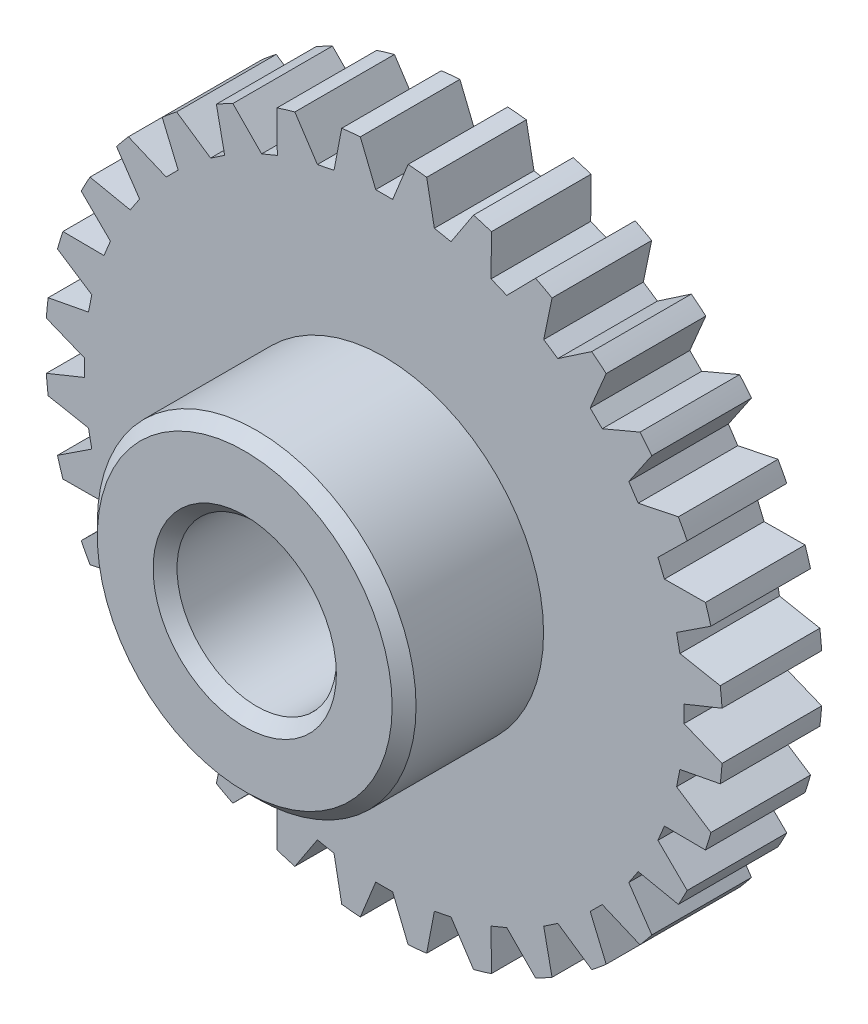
ISO-10303-21;
HEADER;
FILE_DESCRIPTION(('STEP AP214'),'2;1');
FILE_NAME('part.step','',(''),(''),'','','');
FILE_SCHEMA(('AUTOMOTIVE_DESIGN { 1 0 10303 214 1 1 1 1 }'));
ENDSEC;
DATA;
#1=APPLICATION_CONTEXT('core data for automotive mechanical design processes');
#2=APPLICATION_PROTOCOL_DEFINITION('international standard','automotive_design',2000,#1);
#3=PRODUCT_CONTEXT('',#1,'mechanical');
#4=PRODUCT('Part','Part','',(#3));
#5=PRODUCT_RELATED_PRODUCT_CATEGORY('part','',(#4));
#6=PRODUCT_DEFINITION_FORMATION('','',#4);
#7=PRODUCT_DEFINITION_CONTEXT('part definition',#1,'design');
#8=PRODUCT_DEFINITION('design','',#6,#7);
#9=PRODUCT_DEFINITION_SHAPE('','',#8);
#10=(LENGTH_UNIT() NAMED_UNIT(*) SI_UNIT(.MILLI.,.METRE.));
#11=(NAMED_UNIT(*) PLANE_ANGLE_UNIT() SI_UNIT($,.RADIAN.));
#12=(NAMED_UNIT(*) SI_UNIT($,.STERADIAN.) SOLID_ANGLE_UNIT());
#13=UNCERTAINTY_MEASURE_WITH_UNIT(LENGTH_MEASURE(1.E-05),#10,'distance_accuracy_value','');
#14=(GEOMETRIC_REPRESENTATION_CONTEXT(3) GLOBAL_UNCERTAINTY_ASSIGNED_CONTEXT((#13)) GLOBAL_UNIT_ASSIGNED_CONTEXT((#10,
#11,#12)) REPRESENTATION_CONTEXT('',''));
#15=CARTESIAN_POINT('',(0.,0.,0.));
#16=DIRECTION('',(0.,0.,1.));
#17=DIRECTION('',(1.,0.,0.));
#18=AXIS2_PLACEMENT_3D('',#15,#16,#17);
#19=CARTESIAN_POINT('',(0.,0.,2.5));
#20=DIRECTION('',(0.,0.,1.));
#21=DIRECTION('',(1.,0.,0.));
#22=AXIS2_PLACEMENT_3D('',#19,#20,#21);
#23=PLANE('',#22);
#24=DIRECTION('',(0.549295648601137,0.835628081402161,0.));
#25=VECTOR('',#24,1.);
#26=CARTESIAN_POINT('',(1.67653106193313,7.33845860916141,2.5));
#27=LINE('',#26,#25);
#28=CARTESIAN_POINT('',(1.67653106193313,7.33845860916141,2.5));
#29=VERTEX_POINT('',#28);
#30=CARTESIAN_POINT('',(2.24216675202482,8.19894433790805,2.5));
#31=VERTEX_POINT('',#30);
#32=EDGE_CURVE('E834',#29,#31,#27,.T.);
#33=ORIENTED_EDGE('',*,*,#32,.F.);
#34=DIRECTION('',(0.980785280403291,-0.195090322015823,0.));
#35=VECTOR('',#34,1.);
#36=CARTESIAN_POINT('',(1.67653106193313,7.33845860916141,2.5));
#37=LINE('',#36,#35);
#38=CARTESIAN_POINT('',(1.25939380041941,7.42143236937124,2.5));
#39=VERTEX_POINT('',#38);
#40=EDGE_CURVE('E832',#39,#29,#37,.T.);
#41=ORIENTED_EDGE('',*,*,#40,.F.);
#42=DIRECTION('',(0.187701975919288,-0.982226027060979,0.));
#43=VECTOR('',#42,1.);
#44=CARTESIAN_POINT('',(1.25939380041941,7.42143236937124,2.5));
#45=LINE('',#44,#43);
#46=CARTESIAN_POINT('',(1.06610820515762,8.43287692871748,2.5));
#47=VERTEX_POINT('',#46);
#48=EDGE_CURVE('E1715',#47,#39,#45,.T.);
#49=ORIENTED_EDGE('',*,*,#48,.F.);
#50=CARTESIAN_POINT('',(0.,0.,2.5));
#51=DIRECTION('',(0.,0.,1.));
#52=DIRECTION('',(1.,0.,0.));
#53=AXIS2_PLACEMENT_3D('',#50,#51,#52);
#54=CIRCLE('',#53,8.5);
#55=CARTESIAN_POINT('',(0.59954945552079,8.47882895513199,2.5));
#56=VERTEX_POINT('',#55);
#57=EDGE_CURVE('E1374',#47,#56,#54,.T.);
#58=ORIENTED_EDGE('',*,*,#57,.T.);
#59=DIRECTION('',(0.375718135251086,0.926733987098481,0.));
#60=VECTOR('',#59,1.);
#61=CARTESIAN_POINT('',(0.212654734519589,7.52452716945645,2.5));
#62=LINE('',#61,#60);
#63=CARTESIAN_POINT('',(0.212654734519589,7.52452716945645,2.5));
#64=VERTEX_POINT('',#63);
#65=EDGE_CURVE('E1390',#64,#56,#62,.T.);
#66=ORIENTED_EDGE('',*,*,#65,.F.);
#67=DIRECTION('',(1.,2.97747462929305E-13,0.));
#68=VECTOR('',#67,1.);
#69=CARTESIAN_POINT('',(0.212654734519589,7.52452716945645,2.5));
#70=LINE('',#69,#68);
#71=CARTESIAN_POINT('',(-0.212654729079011,7.52452716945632,2.5));
#72=VERTEX_POINT('',#71);
#73=EDGE_CURVE('E1387',#72,#64,#70,.T.);
#74=ORIENTED_EDGE('',*,*,#73,.F.);
#75=DIRECTION('',(0.375718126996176,-0.926733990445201,0.));
#76=VECTOR('',#75,1.);
#77=CARTESIAN_POINT('',(-0.212654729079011,7.52452716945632,2.5));
#78=LINE('',#77,#76);
#79=CARTESIAN_POINT('',(-0.599549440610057,8.47882895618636,2.5));
#80=VERTEX_POINT('',#79);
#81=EDGE_CURVE('E1369',#80,#72,#78,.T.);
#82=ORIENTED_EDGE('',*,*,#81,.F.);
#83=CARTESIAN_POINT('',(-1.06610819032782,8.43287693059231,2.5));
#84=VERTEX_POINT('',#83);
#85=EDGE_CURVE('E847',#80,#84,#54,.T.);
#86=ORIENTED_EDGE('',*,*,#85,.T.);
#87=DIRECTION('',(0.187701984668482,0.982226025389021,0.));
#88=VECTOR('',#87,1.);
#89=CARTESIAN_POINT('',(-1.2593937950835,7.42143237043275,2.5));
#90=LINE('',#89,#88);
#91=CARTESIAN_POINT('',(-1.2593937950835,7.42143237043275,2.5));
#92=VERTEX_POINT('',#91);
#93=EDGE_CURVE('E1406',#92,#84,#90,.T.);
#94=ORIENTED_EDGE('',*,*,#93,.F.);
#95=DIRECTION('',(0.980785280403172,0.195090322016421,0.));
#96=VECTOR('',#95,1.);
#97=CARTESIAN_POINT('',(-1.2593937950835,7.42143237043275,2.5));
#98=LINE('',#97,#96);
#99=CARTESIAN_POINT('',(-1.67653105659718,7.33845861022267,2.5));
#100=VERTEX_POINT('',#99);
#101=EDGE_CURVE('E1352',#100,#92,#98,.T.);
#102=ORIENTED_EDGE('',*,*,#101,.F.);
#103=DIRECTION('',(0.549295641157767,-0.835628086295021,0.));
#104=VECTOR('',#103,1.);
#105=CARTESIAN_POINT('',(-1.67653105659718,7.33845861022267,2.5));
#106=LINE('',#105,#104);
#107=CARTESIAN_POINT('',(-2.24216673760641,8.19894434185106,2.5));
#108=VERTEX_POINT('',#107);
#109=EDGE_CURVE('E1404',#108,#100,#106,.T.);
#110=ORIENTED_EDGE('',*,*,#109,.F.);
#111=CARTESIAN_POINT('',(-2.69079589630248,8.06285417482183,2.5));
#112=VERTEX_POINT('',#111);
#113=EDGE_CURVE('E1729',#108,#112,#54,.T.);
#114=ORIENTED_EDGE('',*,*,#113,.T.);
#115=DIRECTION('',(-0.00752744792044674,0.999971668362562,0.));
#116=VECTOR('',#115,1.);
#117=CARTESIAN_POINT('',(-2.6830445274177,7.03313608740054,2.5));
#118=LINE('',#117,#116);
#119=CARTESIAN_POINT('',(-2.6830445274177,7.03313608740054,2.5));
#120=VERTEX_POINT('',#119);
#121=EDGE_CURVE('E1344',#120,#112,#118,.T.);
#122=ORIENTED_EDGE('',*,*,#121,.F.);
#123=DIRECTION('',(0.923879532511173,0.382683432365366,0.));
#124=VECTOR('',#123,1.);
#125=CARTESIAN_POINT('',(-2.6830445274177,7.03313608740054,2.5));
#126=LINE('',#125,#124);
#127=CARTESIAN_POINT('',(-3.07597923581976,6.87037720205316,2.5));
#128=VERTEX_POINT('',#127);
#129=EDGE_CURVE('E1345',#128,#120,#126,.T.);
#130=ORIENTED_EDGE('',*,*,#129,.F.);
#131=DIRECTION('',(0.70176403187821,-0.712409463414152,0.));
#132=VECTOR('',#131,1.);
#133=CARTESIAN_POINT('',(-3.07597923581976,6.87037720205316,2.5));
#134=LINE('',#133,#132);
#135=CARTESIAN_POINT('',(-3.79861882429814,7.60397889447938,2.5));
#136=VERTEX_POINT('',#135);
#137=EDGE_CURVE('E1340',#136,#128,#134,.T.);
#138=ORIENTED_EDGE('',*,*,#137,.F.);
#139=CARTESIAN_POINT('',(-4.21207782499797,7.38298045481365,2.5));
#140=VERTEX_POINT('',#139);
#141=EDGE_CURVE('E1968',#136,#140,#54,.T.);
#142=ORIENTED_EDGE('',*,*,#141,.T.);
#143=DIRECTION('',(-0.202467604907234,0.979288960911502,0.));
#144=VECTOR('',#143,1.);
#145=CARTESIAN_POINT('',(-4.00358736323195,6.37456032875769,2.5));
#146=LINE('',#145,#144);
#147=CARTESIAN_POINT('',(-4.00358736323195,6.37456032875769,2.5));
#148=VERTEX_POINT('',#147);
#149=EDGE_CURVE('E1427',#148,#140,#146,.T.);
#150=ORIENTED_EDGE('',*,*,#149,.F.);
#151=DIRECTION('',(0.831469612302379,0.555570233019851,0.));
#152=VECTOR('',#151,1.);
#153=CARTESIAN_POINT('',(-4.00358736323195,6.37456032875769,2.5));
#154=LINE('',#153,#152);
#155=CARTESIAN_POINT('',(-4.35721925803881,6.13827105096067,2.5));
#156=VERTEX_POINT('',#155);
#157=EDGE_CURVE('E1317',#156,#148,#154,.T.);
#158=ORIENTED_EDGE('',*,*,#157,.F.);
#159=DIRECTION('',(0.827264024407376,-0.561813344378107,0.));
#160=VECTOR('',#159,1.);
#161=CARTESIAN_POINT('',(-4.35721925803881,6.13827105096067,2.5));
#162=LINE('',#161,#160);
#163=CARTESIAN_POINT('',(-5.20909211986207,6.71679680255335,2.5));
#164=VERTEX_POINT('',#163);
#165=EDGE_CURVE('E1425',#164,#156,#162,.T.);
#166=ORIENTED_EDGE('',*,*,#165,.F.);
#167=CARTESIAN_POINT('',(-5.57149196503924,6.41938293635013,2.5));
#168=VERTEX_POINT('',#167);
#169=EDGE_CURVE('E1963',#164,#168,#54,.T.);
#170=ORIENTED_EDGE('',*,*,#169,.T.);
#171=DIRECTION('',(-0.389627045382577,0.920972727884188,0.));
#172=VECTOR('',#171,1.);
#173=CARTESIAN_POINT('',(-5.17027458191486,5.47101379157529,2.5));
#174=LINE('',#173,#172);
#175=CARTESIAN_POINT('',(-5.17027458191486,5.47101379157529,2.5));
#176=VERTEX_POINT('',#175);
#177=EDGE_CURVE('E1309',#176,#168,#174,.T.);
#178=ORIENTED_EDGE('',*,*,#177,.F.);
#179=DIRECTION('',(0.707106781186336,0.707106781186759,0.));
#180=VECTOR('',#179,1.);
#181=CARTESIAN_POINT('',(-5.17027458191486,5.47101379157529,2.5));
#182=LINE('',#181,#180);
#183=CARTESIAN_POINT('',(-5.47101378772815,5.17027458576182,2.5));
#184=VERTEX_POINT('',#183);
#185=EDGE_CURVE('E1310',#184,#176,#182,.T.);
#186=ORIENTED_EDGE('',*,*,#185,.F.);
#187=DIRECTION('',(0.920972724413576,-0.389627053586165,0.));
#188=VECTOR('',#187,1.);
#189=CARTESIAN_POINT('',(-5.47101378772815,5.17027458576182,2.5));
#190=LINE('',#189,#188);
#191=CARTESIAN_POINT('',(-6.41938292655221,5.57149197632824,2.5));
#192=VERTEX_POINT('',#191);
#193=EDGE_CURVE('E1305',#192,#184,#190,.T.);
#194=ORIENTED_EDGE('',*,*,#193,.F.);
#195=CARTESIAN_POINT('',(-6.71679679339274,5.20909213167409,2.5));
#196=VERTEX_POINT('',#195);
#197=EDGE_CURVE('E1961',#192,#196,#54,.T.);
#198=ORIENTED_EDGE('',*,*,#197,.T.);
#199=DIRECTION('',(-0.561813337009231,0.827264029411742,0.));
#200=VECTOR('',#199,1.);
#201=CARTESIAN_POINT('',(-6.13827104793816,4.35721926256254,2.5));
#202=LINE('',#201,#200);
#203=CARTESIAN_POINT('',(-6.13827104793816,4.35721926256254,2.5));
#204=VERTEX_POINT('',#203);
#205=EDGE_CURVE('E1448',#204,#196,#202,.T.);
#206=ORIENTED_EDGE('',*,*,#205,.F.);
#207=DIRECTION('',(0.555570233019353,0.831469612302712,0.));
#208=VECTOR('',#207,1.);
#209=CARTESIAN_POINT('',(-6.13827104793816,4.35721926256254,2.5));
#210=LINE('',#209,#208);
#211=CARTESIAN_POINT('',(-6.37456032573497,4.00358736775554,2.5));
#212=VERTEX_POINT('',#211);
#213=EDGE_CURVE('E1282',#212,#204,#210,.T.);
#214=ORIENTED_EDGE('',*,*,#213,.F.);
#215=DIRECTION('',(0.979288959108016,-0.202467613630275,0.));
#216=VECTOR('',#215,1.);
#217=CARTESIAN_POINT('',(-6.37456032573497,4.00358736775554,2.5));
#218=LINE('',#217,#216);
#219=CARTESIAN_POINT('',(-7.38298044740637,4.21207783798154,2.5));
#220=VERTEX_POINT('',#219);
#221=EDGE_CURVE('E1446',#220,#212,#218,.T.);
#222=ORIENTED_EDGE('',*,*,#221,.F.);
#223=CARTESIAN_POINT('',(-7.6039788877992,3.79861883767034,2.5));
#224=VERTEX_POINT('',#223);
#225=EDGE_CURVE('E1956',#220,#224,#54,.T.);
#226=ORIENTED_EDGE('',*,*,#225,.T.);
#227=DIRECTION('',(-0.71240945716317,0.701764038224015,0.));
#228=VECTOR('',#227,1.);
#229=CARTESIAN_POINT('',(-6.87037719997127,3.07597924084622,2.5));
#230=LINE('',#229,#228);
#231=CARTESIAN_POINT('',(-6.87037719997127,3.07597924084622,2.5));
#232=VERTEX_POINT('',#231);
#233=EDGE_CURVE('E1274',#232,#224,#230,.T.);
#234=ORIENTED_EDGE('',*,*,#233,.F.);
#235=DIRECTION('',(0.382683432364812,0.923879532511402,0.));
#236=VECTOR('',#235,1.);
#237=CARTESIAN_POINT('',(-6.87037719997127,3.07597924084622,2.5));
#238=LINE('',#237,#236);
#239=CARTESIAN_POINT('',(-7.03313608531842,2.68304453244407,2.5));
#240=VERTEX_POINT('',#239);
#241=EDGE_CURVE('E1275',#240,#232,#238,.T.);
#242=ORIENTED_EDGE('',*,*,#241,.F.);
#243=DIRECTION('',(0.999971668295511,-0.0075274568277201,0.));
#244=VECTOR('',#243,1.);
#245=CARTESIAN_POINT('',(-7.03313608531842,2.68304453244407,2.5));
#246=LINE('',#245,#244);
#247=CARTESIAN_POINT('',(-8.06285417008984,2.69079591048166,2.5));
#248=VERTEX_POINT('',#247);
#249=EDGE_CURVE('E1270',#248,#240,#246,.T.);
#250=ORIENTED_EDGE('',*,*,#249,.F.);
#251=CARTESIAN_POINT('',(-8.19894433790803,2.24216675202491,2.5));
#252=VERTEX_POINT('',#251);
#253=EDGE_CURVE('E1954',#248,#252,#54,.T.);
#254=ORIENTED_EDGE('',*,*,#253,.T.);
#255=DIRECTION('',(-0.835628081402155,0.549295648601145,0.));
#256=VECTOR('',#255,1.);
#257=CARTESIAN_POINT('',(-7.3384586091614,1.67653106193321,2.5));
#258=LINE('',#257,#256);
#259=CARTESIAN_POINT('',(-7.3384586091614,1.67653106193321,2.5));
#260=VERTEX_POINT('',#259);
#261=EDGE_CURVE('E1469',#260,#252,#258,.T.);
#262=ORIENTED_EDGE('',*,*,#261,.F.);
#263=DIRECTION('',(0.195090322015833,0.980785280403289,0.));
#264=VECTOR('',#263,1.);
#265=CARTESIAN_POINT('',(-7.3384586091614,1.67653106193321,2.5));
#266=LINE('',#265,#264);
#267=CARTESIAN_POINT('',(-7.42143236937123,1.25939380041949,2.5));
#268=VERTEX_POINT('',#267);
#269=EDGE_CURVE('E1247',#268,#260,#266,.T.);
#270=ORIENTED_EDGE('',*,*,#269,.F.);
#271=DIRECTION('',(0.982226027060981,0.187701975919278,0.));
#272=VECTOR('',#271,1.);
#273=CARTESIAN_POINT('',(-7.42143236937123,1.25939380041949,2.5));
#274=LINE('',#273,#272);
#275=CARTESIAN_POINT('',(-8.43287692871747,1.06610820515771,2.5));
#276=VERTEX_POINT('',#275);
#277=EDGE_CURVE('E1467',#276,#268,#274,.T.);
#278=ORIENTED_EDGE('',*,*,#277,.F.);
#279=CARTESIAN_POINT('',(-8.478828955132,0.59954945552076,2.5));
#280=VERTEX_POINT('',#279);
#281=EDGE_CURVE('E1949',#276,#280,#54,.T.);
#282=ORIENTED_EDGE('',*,*,#281,.T.);
#283=DIRECTION('',(-0.926733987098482,0.375718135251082,0.));
#284=VECTOR('',#283,1.);
#285=CARTESIAN_POINT('',(-7.52452716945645,0.212654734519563,2.5));
#286=LINE('',#285,#284);
#287=CARTESIAN_POINT('',(-7.52452716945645,0.212654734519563,2.5));
#288=VERTEX_POINT('',#287);
#289=EDGE_CURVE('E1239',#288,#280,#286,.T.);
#290=ORIENTED_EDGE('',*,*,#289,.F.);
#291=DIRECTION('',(-3.01238946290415E-13,1.,0.));
#292=VECTOR('',#291,1.);
#293=CARTESIAN_POINT('',(-7.52452716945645,0.212654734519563,2.5));
#294=LINE('',#293,#292);
#295=CARTESIAN_POINT('',(-7.52452716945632,-0.212654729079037,2.5));
#296=VERTEX_POINT('',#295);
#297=EDGE_CURVE('E1240',#296,#288,#294,.T.);
#298=ORIENTED_EDGE('',*,*,#297,.F.);
#299=DIRECTION('',(0.9267339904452,0.375718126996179,0.));
#300=VECTOR('',#299,1.);
#301=CARTESIAN_POINT('',(-7.52452716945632,-0.212654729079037,2.5));
#302=LINE('',#301,#300);
#303=CARTESIAN_POINT('',(-8.47882895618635,-0.599549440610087,2.5));
#304=VERTEX_POINT('',#303);
#305=EDGE_CURVE('E1235',#304,#296,#302,.T.);
#306=ORIENTED_EDGE('',*,*,#305,.F.);
#307=CARTESIAN_POINT('',(-8.43287693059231,-1.06610819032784,2.5));
#308=VERTEX_POINT('',#307);
#309=EDGE_CURVE('E1947',#304,#308,#54,.T.);
#310=ORIENTED_EDGE('',*,*,#309,.T.);
#311=DIRECTION('',(-0.982226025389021,0.187701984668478,0.));
#312=VECTOR('',#311,1.);
#313=CARTESIAN_POINT('',(-7.42143237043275,-1.25939379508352,2.5));
#314=LINE('',#313,#312);
#315=CARTESIAN_POINT('',(-7.42143237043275,-1.25939379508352,2.5));
#316=VERTEX_POINT('',#315);
#317=EDGE_CURVE('E1490',#316,#308,#314,.T.);
#318=ORIENTED_EDGE('',*,*,#317,.F.);
#319=DIRECTION('',(-0.195090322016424,0.980785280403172,0.));
#320=VECTOR('',#319,1.);
#321=CARTESIAN_POINT('',(-7.42143237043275,-1.25939379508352,2.5));
#322=LINE('',#321,#320);
#323=CARTESIAN_POINT('',(-7.33845861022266,-1.6765310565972,2.5));
#324=VERTEX_POINT('',#323);
#325=EDGE_CURVE('E1212',#324,#316,#322,.T.);
#326=ORIENTED_EDGE('',*,*,#325,.F.);
#327=DIRECTION('',(0.835628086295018,0.54929564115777,0.));
#328=VECTOR('',#327,1.);
#329=CARTESIAN_POINT('',(-7.33845861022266,-1.6765310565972,2.5));
#330=LINE('',#329,#328);
#331=CARTESIAN_POINT('',(-8.19894434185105,-2.24216673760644,2.5));
#332=VERTEX_POINT('',#331);
#333=EDGE_CURVE('E1488',#332,#324,#330,.T.);
#334=ORIENTED_EDGE('',*,*,#333,.F.);
#335=CARTESIAN_POINT('',(-8.06285417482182,-2.69079589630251,2.5));
#336=VERTEX_POINT('',#335);
#337=EDGE_CURVE('E1942',#332,#336,#54,.T.);
#338=ORIENTED_EDGE('',*,*,#337,.T.);
#339=DIRECTION('',(-0.999971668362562,-0.00752744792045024,0.));
#340=VECTOR('',#339,1.);
#341=CARTESIAN_POINT('',(-7.03313608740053,-2.68304452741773,2.5));
#342=LINE('',#341,#340);
#343=CARTESIAN_POINT('',(-7.03313608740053,-2.68304452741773,2.5));
#344=VERTEX_POINT('',#343);
#345=EDGE_CURVE('E1204',#344,#336,#342,.T.);
#346=ORIENTED_EDGE('',*,*,#345,.F.);
#347=DIRECTION('',(-0.382683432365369,0.923879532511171,0.));
#348=VECTOR('',#347,1.);
#349=CARTESIAN_POINT('',(-7.03313608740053,-2.68304452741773,2.5));
#350=LINE('',#349,#348);
#351=CARTESIAN_POINT('',(-6.87037720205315,-3.07597923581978,2.5));
#352=VERTEX_POINT('',#351);
#353=EDGE_CURVE('E1205',#352,#344,#350,.T.);
#354=ORIENTED_EDGE('',*,*,#353,.F.);
#355=DIRECTION('',(0.712409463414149,0.701764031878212,0.));
#356=VECTOR('',#355,1.);
#357=CARTESIAN_POINT('',(-6.87037720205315,-3.07597923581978,2.5));
#358=LINE('',#357,#356);
#359=CARTESIAN_POINT('',(-7.60397889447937,-3.79861882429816,2.5));
#360=VERTEX_POINT('',#359);
#361=EDGE_CURVE('E1200',#360,#352,#358,.T.);
#362=ORIENTED_EDGE('',*,*,#361,.F.);
#363=CARTESIAN_POINT('',(-7.38298045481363,-4.212077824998,2.5));
#364=VERTEX_POINT('',#363);
#365=EDGE_CURVE('E1940',#360,#364,#54,.T.);
#366=ORIENTED_EDGE('',*,*,#365,.T.);
#367=DIRECTION('',(-0.979288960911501,-0.202467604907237,0.));
#368=VECTOR('',#367,1.);
#369=CARTESIAN_POINT('',(-6.37456032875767,-4.00358736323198,2.5));
#370=LINE('',#369,#368);
#371=CARTESIAN_POINT('',(-6.37456032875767,-4.00358736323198,2.5));
#372=VERTEX_POINT('',#371);
#373=EDGE_CURVE('E1511',#372,#364,#370,.T.);
#374=ORIENTED_EDGE('',*,*,#373,.F.);
#375=DIRECTION('',(-0.555570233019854,0.831469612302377,0.));
#376=VECTOR('',#375,1.);
#377=CARTESIAN_POINT('',(-6.37456032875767,-4.00358736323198,2.5));
#378=LINE('',#377,#376);
#379=CARTESIAN_POINT('',(-6.13827105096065,-4.35721925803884,2.5));
#380=VERTEX_POINT('',#379);
#381=EDGE_CURVE('E1177',#380,#372,#378,.T.);
#382=ORIENTED_EDGE('',*,*,#381,.F.);
#383=DIRECTION('',(0.561813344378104,0.827264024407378,0.));
#384=VECTOR('',#383,1.);
#385=CARTESIAN_POINT('',(-6.13827105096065,-4.35721925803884,2.5));
#386=LINE('',#385,#384);
#387=CARTESIAN_POINT('',(-6.71679680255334,-5.20909211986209,2.5));
#388=VERTEX_POINT('',#387);
#389=EDGE_CURVE('E1509',#388,#380,#386,.T.);
#390=ORIENTED_EDGE('',*,*,#389,.F.);
#391=CARTESIAN_POINT('',(-6.41938293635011,-5.57149196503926,2.5));
#392=VERTEX_POINT('',#391);
#393=EDGE_CURVE('E1935',#388,#392,#54,.T.);
#394=ORIENTED_EDGE('',*,*,#393,.T.);
#395=DIRECTION('',(-0.920972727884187,-0.38962704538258,0.));
#396=VECTOR('',#395,1.);
#397=CARTESIAN_POINT('',(-5.47101379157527,-5.17027458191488,2.5));
#398=LINE('',#397,#396);
#399=CARTESIAN_POINT('',(-5.47101379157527,-5.17027458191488,2.5));
#400=VERTEX_POINT('',#399);
#401=EDGE_CURVE('E1169',#400,#392,#398,.T.);
#402=ORIENTED_EDGE('',*,*,#401,.F.);
#403=DIRECTION('',(-0.707106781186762,0.707106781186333,0.));
#404=VECTOR('',#403,1.);
#405=CARTESIAN_POINT('',(-5.47101379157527,-5.17027458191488,2.5));
#406=LINE('',#405,#404);
#407=CARTESIAN_POINT('',(-5.1702745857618,-5.47101378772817,2.5));
#408=VERTEX_POINT('',#407);
#409=EDGE_CURVE('E1170',#408,#400,#406,.T.);
#410=ORIENTED_EDGE('',*,*,#409,.F.);
#411=DIRECTION('',(0.389627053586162,0.920972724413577,0.));
#412=VECTOR('',#411,1.);
#413=CARTESIAN_POINT('',(-5.1702745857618,-5.47101378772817,2.5));
#414=LINE('',#413,#412);
#415=CARTESIAN_POINT('',(-5.57149197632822,-6.41938292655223,2.5));
#416=VERTEX_POINT('',#415);
#417=EDGE_CURVE('E1165',#416,#408,#414,.T.);
#418=ORIENTED_EDGE('',*,*,#417,.F.);
#419=CARTESIAN_POINT('',(-5.20909213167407,-6.71679679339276,2.5));
#420=VERTEX_POINT('',#419);
#421=EDGE_CURVE('E1933',#416,#420,#54,.T.);
#422=ORIENTED_EDGE('',*,*,#421,.T.);
#423=DIRECTION('',(-0.82726402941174,-0.561813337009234,0.));
#424=VECTOR('',#423,1.);
#425=CARTESIAN_POINT('',(-4.35721926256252,-6.13827104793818,2.5));
#426=LINE('',#425,#424);
#427=CARTESIAN_POINT('',(-4.35721926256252,-6.13827104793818,2.5));
#428=VERTEX_POINT('',#427);
#429=EDGE_CURVE('E1532',#428,#420,#426,.T.);
#430=ORIENTED_EDGE('',*,*,#429,.F.);
#431=DIRECTION('',(-0.831469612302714,0.55557023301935,0.));
#432=VECTOR('',#431,1.);
#433=CARTESIAN_POINT('',(-4.35721926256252,-6.13827104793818,2.5));
#434=LINE('',#433,#432);
#435=CARTESIAN_POINT('',(-4.00358736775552,-6.37456032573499,2.5));
#436=VERTEX_POINT('',#435);
#437=EDGE_CURVE('E1142',#436,#428,#434,.T.);
#438=ORIENTED_EDGE('',*,*,#437,.F.);
#439=DIRECTION('',(0.202467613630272,0.979288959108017,0.));
#440=VECTOR('',#439,1.);
#441=CARTESIAN_POINT('',(-4.00358736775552,-6.37456032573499,2.5));
#442=LINE('',#441,#440);
#443=CARTESIAN_POINT('',(-4.21207783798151,-7.38298044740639,2.5));
#444=VERTEX_POINT('',#443);
#445=EDGE_CURVE('E1530',#444,#436,#442,.T.);
#446=ORIENTED_EDGE('',*,*,#445,.F.);
#447=CARTESIAN_POINT('',(-3.79861883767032,-7.60397888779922,2.5));
#448=VERTEX_POINT('',#447);
#449=EDGE_CURVE('E1928',#444,#448,#54,.T.);
#450=ORIENTED_EDGE('',*,*,#449,.T.);
#451=DIRECTION('',(-0.701764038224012,-0.712409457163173,0.));
#452=VECTOR('',#451,1.);
#453=CARTESIAN_POINT('',(-3.0759792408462,-6.87037719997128,2.5));
#454=LINE('',#453,#452);
#455=CARTESIAN_POINT('',(-3.0759792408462,-6.87037719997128,2.5));
#456=VERTEX_POINT('',#455);
#457=EDGE_CURVE('E1134',#456,#448,#454,.T.);
#458=ORIENTED_EDGE('',*,*,#457,.F.);
#459=DIRECTION('',(-0.923879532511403,0.382683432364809,0.));
#460=VECTOR('',#459,1.);
#461=CARTESIAN_POINT('',(-3.0759792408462,-6.87037719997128,2.5));
#462=LINE('',#461,#460);
#463=CARTESIAN_POINT('',(-2.68304453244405,-7.03313608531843,2.5));
#464=VERTEX_POINT('',#463);
#465=EDGE_CURVE('E1135',#464,#456,#462,.T.);
#466=ORIENTED_EDGE('',*,*,#465,.F.);
#467=DIRECTION('',(0.00752745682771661,0.999971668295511,0.));
#468=VECTOR('',#467,1.);
#469=CARTESIAN_POINT('',(-2.68304453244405,-7.03313608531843,2.5));
#470=LINE('',#469,#468);
#471=CARTESIAN_POINT('',(-2.69079591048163,-8.06285417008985,2.5));
#472=VERTEX_POINT('',#471);
#473=EDGE_CURVE('E1130',#472,#464,#470,.T.);
#474=ORIENTED_EDGE('',*,*,#473,.F.);
#475=CARTESIAN_POINT('',(-2.24216675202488,-8.19894433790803,2.5));
#476=VERTEX_POINT('',#475);
#477=EDGE_CURVE('E1926',#472,#476,#54,.T.);
#478=ORIENTED_EDGE('',*,*,#477,.T.);
#479=DIRECTION('',(-0.549295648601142,-0.835628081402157,0.));
#480=VECTOR('',#479,1.);
#481=CARTESIAN_POINT('',(-1.67653106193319,-7.3384586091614,2.5));
#482=LINE('',#481,#480);
#483=CARTESIAN_POINT('',(-1.67653106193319,-7.3384586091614,2.5));
#484=VERTEX_POINT('',#483);
#485=EDGE_CURVE('E1553',#484,#476,#482,.T.);
#486=ORIENTED_EDGE('',*,*,#485,.F.);
#487=DIRECTION('',(-0.98078528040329,0.19509032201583,0.));
#488=VECTOR('',#487,1.);
#489=CARTESIAN_POINT('',(-1.67653106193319,-7.3384586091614,2.5));
#490=LINE('',#489,#488);
#491=CARTESIAN_POINT('',(-1.25939380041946,-7.42143236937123,2.5));
#492=VERTEX_POINT('',#491);
#493=EDGE_CURVE('E1107',#492,#484,#490,.T.);
#494=ORIENTED_EDGE('',*,*,#493,.F.);
#495=DIRECTION('',(-0.187701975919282,0.98222602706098,0.));
#496=VECTOR('',#495,1.);
#497=CARTESIAN_POINT('',(-1.25939380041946,-7.42143236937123,2.5));
#498=LINE('',#497,#496);
#499=CARTESIAN_POINT('',(-1.06610820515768,-8.43287692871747,2.5));
#500=VERTEX_POINT('',#499);
#501=EDGE_CURVE('E1551',#500,#492,#498,.T.);
#502=ORIENTED_EDGE('',*,*,#501,.F.);
#503=CARTESIAN_POINT('',(-0.599549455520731,-8.478828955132,2.5));
#504=VERTEX_POINT('',#503);
#505=EDGE_CURVE('E1921',#500,#504,#54,.T.);
#506=ORIENTED_EDGE('',*,*,#505,.T.);
#507=DIRECTION('',(-0.375718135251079,-0.926733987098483,0.));
#508=VECTOR('',#507,1.);
#509=CARTESIAN_POINT('',(-0.212654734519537,-7.52452716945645,2.5));
#510=LINE('',#509,#508);
#511=CARTESIAN_POINT('',(-0.212654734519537,-7.52452716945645,2.5));
#512=VERTEX_POINT('',#511);
#513=EDGE_CURVE('E1099',#512,#504,#510,.T.);
#514=ORIENTED_EDGE('',*,*,#513,.F.);
#515=DIRECTION('',(-1.,-3.04730429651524E-13,0.));
#516=VECTOR('',#515,1.);
#517=CARTESIAN_POINT('',(-0.212654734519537,-7.52452716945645,2.5));
#518=LINE('',#517,#516);
#519=CARTESIAN_POINT('',(0.212654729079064,-7.52452716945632,2.5));
#520=VERTEX_POINT('',#519);
#521=EDGE_CURVE('E1100',#520,#512,#518,.T.);
#522=ORIENTED_EDGE('',*,*,#521,.F.);
#523=DIRECTION('',(-0.375718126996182,0.926733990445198,0.));
#524=VECTOR('',#523,1.);
#525=CARTESIAN_POINT('',(0.212654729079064,-7.52452716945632,2.5));
#526=LINE('',#525,#524);
#527=CARTESIAN_POINT('',(0.599549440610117,-8.47882895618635,2.5));
#528=VERTEX_POINT('',#527);
#529=EDGE_CURVE('E1095',#528,#520,#526,.T.);
#530=ORIENTED_EDGE('',*,*,#529,.F.);
#531=CARTESIAN_POINT('',(1.06610819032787,-8.4328769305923,2.5));
#532=VERTEX_POINT('',#531);
#533=EDGE_CURVE('E1919',#528,#532,#54,.T.);
#534=ORIENTED_EDGE('',*,*,#533,.T.);
#535=DIRECTION('',(-0.187701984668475,-0.982226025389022,0.));
#536=VECTOR('',#535,1.);
#537=CARTESIAN_POINT('',(1.25939379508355,-7.42143237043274,2.5));
#538=LINE('',#537,#536);
#539=CARTESIAN_POINT('',(1.25939379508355,-7.42143237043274,2.5));
#540=VERTEX_POINT('',#539);
#541=EDGE_CURVE('E1574',#540,#532,#538,.T.);
#542=ORIENTED_EDGE('',*,*,#541,.F.);
#543=DIRECTION('',(-0.980785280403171,-0.195090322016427,0.));
#544=VECTOR('',#543,1.);
#545=CARTESIAN_POINT('',(1.25939379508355,-7.42143237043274,2.5));
#546=LINE('',#545,#544);
#547=CARTESIAN_POINT('',(1.67653105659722,-7.33845861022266,2.5));
#548=VERTEX_POINT('',#547);
#549=EDGE_CURVE('E1072',#548,#540,#546,.T.);
#550=ORIENTED_EDGE('',*,*,#549,.F.);
#551=DIRECTION('',(-0.549295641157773,0.835628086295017,0.));
#552=VECTOR('',#551,1.);
#553=CARTESIAN_POINT('',(1.67653105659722,-7.33845861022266,2.5));
#554=LINE('',#553,#552);
#555=CARTESIAN_POINT('',(2.24216673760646,-8.19894434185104,2.5));
#556=VERTEX_POINT('',#555);
#557=EDGE_CURVE('E1572',#556,#548,#554,.T.);
#558=ORIENTED_EDGE('',*,*,#557,.F.);
#559=CARTESIAN_POINT('',(2.69079589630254,-8.06285417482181,2.5));
#560=VERTEX_POINT('',#559);
#561=EDGE_CURVE('E1914',#556,#560,#54,.T.);
#562=ORIENTED_EDGE('',*,*,#561,.T.);
#563=DIRECTION('',(0.00752744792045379,-0.999971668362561,0.));
#564=VECTOR('',#563,1.);
#565=CARTESIAN_POINT('',(2.68304452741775,-7.03313608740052,2.5));
#566=LINE('',#565,#564);
#567=CARTESIAN_POINT('',(2.68304452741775,-7.03313608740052,2.5));
#568=VERTEX_POINT('',#567);
#569=EDGE_CURVE('E1064',#568,#560,#566,.T.);
#570=ORIENTED_EDGE('',*,*,#569,.F.);
#571=DIRECTION('',(-0.92387953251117,-0.382683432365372,0.));
#572=VECTOR('',#571,1.);
#573=CARTESIAN_POINT('',(2.68304452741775,-7.03313608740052,2.5));
#574=LINE('',#573,#572);
#575=CARTESIAN_POINT('',(3.0759792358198,-6.87037720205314,2.5));
#576=VERTEX_POINT('',#575);
#577=EDGE_CURVE('E1065',#576,#568,#574,.T.);
#578=ORIENTED_EDGE('',*,*,#577,.F.);
#579=DIRECTION('',(-0.701764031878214,0.712409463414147,0.));
#580=VECTOR('',#579,1.);
#581=CARTESIAN_POINT('',(3.0759792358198,-6.87037720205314,2.5));
#582=LINE('',#581,#580);
#583=CARTESIAN_POINT('',(3.79861882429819,-7.60397889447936,2.5));
#584=VERTEX_POINT('',#583);
#585=EDGE_CURVE('E1060',#584,#576,#582,.T.);
#586=ORIENTED_EDGE('',*,*,#585,.F.);
#587=CARTESIAN_POINT('',(4.21207782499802,-7.38298045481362,2.5));
#588=VERTEX_POINT('',#587);
#589=EDGE_CURVE('E1912',#584,#588,#54,.T.);
#590=ORIENTED_EDGE('',*,*,#589,.T.);
#591=DIRECTION('',(0.202467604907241,-0.9792889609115,0.));
#592=VECTOR('',#591,1.);
#593=CARTESIAN_POINT('',(4.003587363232,-6.37456032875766,2.5));
#594=LINE('',#593,#592);
#595=CARTESIAN_POINT('',(4.003587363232,-6.37456032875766,2.5));
#596=VERTEX_POINT('',#595);
#597=EDGE_CURVE('E1595',#596,#588,#594,.T.);
#598=ORIENTED_EDGE('',*,*,#597,.F.);
#599=DIRECTION('',(-0.831469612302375,-0.555570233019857,0.));
#600=VECTOR('',#599,1.);
#601=CARTESIAN_POINT('',(4.003587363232,-6.37456032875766,2.5));
#602=LINE('',#601,#600);
#603=CARTESIAN_POINT('',(4.35721925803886,-6.13827105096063,2.5));
#604=VERTEX_POINT('',#603);
#605=EDGE_CURVE('E1037',#604,#596,#602,.T.);
#606=ORIENTED_EDGE('',*,*,#605,.F.);
#607=DIRECTION('',(-0.82726402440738,0.561813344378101,0.));
#608=VECTOR('',#607,1.);
#609=CARTESIAN_POINT('',(4.35721925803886,-6.13827105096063,2.5));
#610=LINE('',#609,#608);
#611=CARTESIAN_POINT('',(5.20909211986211,-6.71679680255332,2.5));
#612=VERTEX_POINT('',#611);
#613=EDGE_CURVE('E1593',#612,#604,#610,.T.);
#614=ORIENTED_EDGE('',*,*,#613,.F.);
#615=CARTESIAN_POINT('',(5.57149196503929,-6.41938293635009,2.5));
#616=VERTEX_POINT('',#615);
#617=EDGE_CURVE('E1907',#612,#616,#54,.T.);
#618=ORIENTED_EDGE('',*,*,#617,.T.);
#619=DIRECTION('',(0.389627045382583,-0.920972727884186,0.));
#620=VECTOR('',#619,1.);
#621=CARTESIAN_POINT('',(5.1702745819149,-5.47101379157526,2.5));
#622=LINE('',#621,#620);
#623=CARTESIAN_POINT('',(5.1702745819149,-5.47101379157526,2.5));
#624=VERTEX_POINT('',#623);
#625=EDGE_CURVE('E1029',#624,#616,#622,.T.);
#626=ORIENTED_EDGE('',*,*,#625,.F.);
#627=DIRECTION('',(-0.707106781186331,-0.707106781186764,0.));
#628=VECTOR('',#627,1.);
#629=CARTESIAN_POINT('',(5.1702745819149,-5.47101379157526,2.5));
#630=LINE('',#629,#628);
#631=CARTESIAN_POINT('',(5.47101378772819,-5.17027458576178,2.5));
#632=VERTEX_POINT('',#631);
#633=EDGE_CURVE('E1030',#632,#624,#630,.T.);
#634=ORIENTED_EDGE('',*,*,#633,.F.);
#635=DIRECTION('',(-0.920972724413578,0.389627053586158,0.));
#636=VECTOR('',#635,1.);
#637=CARTESIAN_POINT('',(5.47101378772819,-5.17027458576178,2.5));
#638=LINE('',#637,#636);
#639=CARTESIAN_POINT('',(6.41938292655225,-5.5714919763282,2.5));
#640=VERTEX_POINT('',#639);
#641=EDGE_CURVE('E1025',#640,#632,#638,.T.);
#642=ORIENTED_EDGE('',*,*,#641,.F.);
#643=CARTESIAN_POINT('',(6.71679679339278,-5.20909213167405,2.5));
#644=VERTEX_POINT('',#643);
#645=EDGE_CURVE('E1905',#640,#644,#54,.T.);
#646=ORIENTED_EDGE('',*,*,#645,.T.);
#647=DIRECTION('',(0.561813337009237,-0.827264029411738,0.));
#648=VECTOR('',#647,1.);
#649=CARTESIAN_POINT('',(6.13827104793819,-4.3572192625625,2.5));
#650=LINE('',#649,#648);
#651=CARTESIAN_POINT('',(6.13827104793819,-4.3572192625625,2.5));
#652=VERTEX_POINT('',#651);
#653=EDGE_CURVE('E1616',#652,#644,#650,.T.);
#654=ORIENTED_EDGE('',*,*,#653,.F.);
#655=DIRECTION('',(-0.555570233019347,-0.831469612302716,0.));
#656=VECTOR('',#655,1.);
#657=CARTESIAN_POINT('',(6.13827104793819,-4.3572192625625,2.5));
#658=LINE('',#657,#656);
#659=CARTESIAN_POINT('',(6.374560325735,-4.00358736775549,2.5));
#660=VERTEX_POINT('',#659);
#661=EDGE_CURVE('E1002',#660,#652,#658,.T.);
#662=ORIENTED_EDGE('',*,*,#661,.F.);
#663=DIRECTION('',(-0.979288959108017,0.202467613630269,0.));
#664=VECTOR('',#663,1.);
#665=CARTESIAN_POINT('',(6.374560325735,-4.00358736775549,2.5));
#666=LINE('',#665,#664);
#667=CARTESIAN_POINT('',(7.3829804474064,-4.21207783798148,2.5));
#668=VERTEX_POINT('',#667);
#669=EDGE_CURVE('E1614',#668,#660,#666,.T.);
#670=ORIENTED_EDGE('',*,*,#669,.F.);
#671=CARTESIAN_POINT('',(7.60397888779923,-3.79861883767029,2.5));
#672=VERTEX_POINT('',#671);
#673=EDGE_CURVE('E1900',#668,#672,#54,.T.);
#674=ORIENTED_EDGE('',*,*,#673,.T.);
#675=DIRECTION('',(0.712409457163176,-0.70176403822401,0.));
#676=VECTOR('',#675,1.);
#677=CARTESIAN_POINT('',(6.87037719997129,-3.07597924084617,2.5));
#678=LINE('',#677,#676);
#679=CARTESIAN_POINT('',(6.87037719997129,-3.07597924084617,2.5));
#680=VERTEX_POINT('',#679);
#681=EDGE_CURVE('E994',#680,#672,#678,.T.);
#682=ORIENTED_EDGE('',*,*,#681,.F.);
#683=DIRECTION('',(-0.382683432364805,-0.923879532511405,0.));
#684=VECTOR('',#683,1.);
#685=CARTESIAN_POINT('',(6.87037719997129,-3.07597924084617,2.5));
#686=LINE('',#685,#684);
#687=CARTESIAN_POINT('',(7.03313608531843,-2.68304453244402,2.5));
#688=VERTEX_POINT('',#687);
#689=EDGE_CURVE('E995',#688,#680,#686,.T.);
#690=ORIENTED_EDGE('',*,*,#689,.F.);
#691=DIRECTION('',(-0.999971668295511,0.00752745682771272,0.));
#692=VECTOR('',#691,1.);
#693=CARTESIAN_POINT('',(7.03313608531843,-2.68304453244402,2.5));
#694=LINE('',#693,#692);
#695=CARTESIAN_POINT('',(8.06285417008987,-2.6907959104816,2.5));
#696=VERTEX_POINT('',#695);
#697=EDGE_CURVE('E990',#696,#688,#694,.T.);
#698=ORIENTED_EDGE('',*,*,#697,.F.);
#699=CARTESIAN_POINT('',(8.19894433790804,-2.24216675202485,2.5));
#700=VERTEX_POINT('',#699);
#701=EDGE_CURVE('E1898',#696,#700,#54,.T.);
#702=ORIENTED_EDGE('',*,*,#701,.T.);
#703=DIRECTION('',(0.835628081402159,-0.549295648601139,0.));
#704=VECTOR('',#703,1.);
#705=CARTESIAN_POINT('',(7.33845860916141,-1.67653106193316,2.5));
#706=LINE('',#705,#704);
#707=CARTESIAN_POINT('',(7.33845860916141,-1.67653106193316,2.5));
#708=VERTEX_POINT('',#707);
#709=EDGE_CURVE('E1637',#708,#700,#706,.T.);
#710=ORIENTED_EDGE('',*,*,#709,.F.);
#711=DIRECTION('',(-0.195090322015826,-0.98078528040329,0.));
#712=VECTOR('',#711,1.);
#713=CARTESIAN_POINT('',(7.33845860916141,-1.67653106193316,2.5));
#714=LINE('',#713,#712);
#715=CARTESIAN_POINT('',(7.42143236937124,-1.25939380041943,2.5));
#716=VERTEX_POINT('',#715);
#717=EDGE_CURVE('E967',#716,#708,#714,.T.);
#718=ORIENTED_EDGE('',*,*,#717,.F.);
#719=DIRECTION('',(-0.98222602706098,-0.187701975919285,0.));
#720=VECTOR('',#719,1.);
#721=CARTESIAN_POINT('',(7.42143236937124,-1.25939380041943,2.5));
#722=LINE('',#721,#720);
#723=CARTESIAN_POINT('',(8.43287692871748,-1.06610820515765,2.5));
#724=VERTEX_POINT('',#723);
#725=EDGE_CURVE('E1635',#724,#716,#722,.T.);
#726=ORIENTED_EDGE('',*,*,#725,.F.);
#727=CARTESIAN_POINT('',(8.478828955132,-0.599549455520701,2.5));
#728=VERTEX_POINT('',#727);
#729=EDGE_CURVE('E1893',#724,#728,#54,.T.);
#730=ORIENTED_EDGE('',*,*,#729,.T.);
#731=DIRECTION('',(0.926733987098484,-0.375718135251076,0.));
#732=VECTOR('',#731,1.);
#733=CARTESIAN_POINT('',(7.52452716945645,-0.21265473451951,2.5));
#734=LINE('',#733,#732);
#735=CARTESIAN_POINT('',(7.52452716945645,-0.21265473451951,2.5));
#736=VERTEX_POINT('',#735);
#737=EDGE_CURVE('E959',#736,#728,#734,.T.);
#738=ORIENTED_EDGE('',*,*,#737,.F.);
#739=DIRECTION('',(3.08221913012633E-13,-1.,0.));
#740=VECTOR('',#739,1.);
#741=CARTESIAN_POINT('',(7.52452716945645,-0.21265473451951,2.5));
#742=LINE('',#741,#740);
#743=CARTESIAN_POINT('',(7.52452716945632,0.21265472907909,2.5));
#744=VERTEX_POINT('',#743);
#745=EDGE_CURVE('E960',#744,#736,#742,.T.);
#746=ORIENTED_EDGE('',*,*,#745,.F.);
#747=DIRECTION('',(-0.926733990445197,-0.375718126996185,0.));
#748=VECTOR('',#747,1.);
#749=CARTESIAN_POINT('',(7.52452716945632,0.21265472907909,2.5));
#750=LINE('',#749,#748);
#751=CARTESIAN_POINT('',(8.47882895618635,0.599549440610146,2.5));
#752=VERTEX_POINT('',#751);
#753=EDGE_CURVE('E955',#752,#744,#750,.T.);
#754=ORIENTED_EDGE('',*,*,#753,.F.);
#755=CARTESIAN_POINT('',(8.4328769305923,1.0661081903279,2.5));
#756=VERTEX_POINT('',#755);
#757=EDGE_CURVE('E1891',#752,#756,#54,.T.);
#758=ORIENTED_EDGE('',*,*,#757,.T.);
#759=DIRECTION('',(0.982226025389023,-0.187701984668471,0.));
#760=VECTOR('',#759,1.);
#761=CARTESIAN_POINT('',(7.42143237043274,1.25939379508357,2.5));
#762=LINE('',#761,#760);
#763=CARTESIAN_POINT('',(7.42143237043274,1.25939379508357,2.5));
#764=VERTEX_POINT('',#763);
#765=EDGE_CURVE('E1658',#764,#756,#762,.T.);
#766=ORIENTED_EDGE('',*,*,#765,.F.);
#767=DIRECTION('',(0.195090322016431,-0.98078528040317,0.));
#768=VECTOR('',#767,1.);
#769=CARTESIAN_POINT('',(7.42143237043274,1.25939379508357,2.5));
#770=LINE('',#769,#768);
#771=CARTESIAN_POINT('',(7.33845861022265,1.67653105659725,2.5));
#772=VERTEX_POINT('',#771);
#773=EDGE_CURVE('E932',#772,#764,#770,.T.);
#774=ORIENTED_EDGE('',*,*,#773,.F.);
#775=DIRECTION('',(-0.835628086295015,-0.549295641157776,0.));
#776=VECTOR('',#775,1.);
#777=CARTESIAN_POINT('',(7.33845861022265,1.67653105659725,2.5));
#778=LINE('',#777,#776);
#779=CARTESIAN_POINT('',(8.19894434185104,2.24216673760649,2.5));
#780=VERTEX_POINT('',#779);
#781=EDGE_CURVE('E1656',#780,#772,#778,.T.);
#782=ORIENTED_EDGE('',*,*,#781,.F.);
#783=CARTESIAN_POINT('',(8.0628541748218,2.69079589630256,2.5));
#784=VERTEX_POINT('',#783);
#785=EDGE_CURVE('E1886',#780,#784,#54,.T.);
#786=ORIENTED_EDGE('',*,*,#785,.T.);
#787=DIRECTION('',(0.999971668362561,0.00752744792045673,0.));
#788=VECTOR('',#787,1.);
#789=CARTESIAN_POINT('',(7.03313608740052,2.68304452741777,2.5));
#790=LINE('',#789,#788);
#791=CARTESIAN_POINT('',(7.03313608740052,2.68304452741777,2.5));
#792=VERTEX_POINT('',#791);
#793=EDGE_CURVE('E924',#792,#784,#790,.T.);
#794=ORIENTED_EDGE('',*,*,#793,.F.);
#795=DIRECTION('',(0.382683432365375,-0.923879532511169,0.));
#796=VECTOR('',#795,1.);
#797=CARTESIAN_POINT('',(7.03313608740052,2.68304452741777,2.5));
#798=LINE('',#797,#796);
#799=CARTESIAN_POINT('',(6.87037720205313,3.07597923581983,2.5));
#800=VERTEX_POINT('',#799);
#801=EDGE_CURVE('E925',#800,#792,#798,.T.);
#802=ORIENTED_EDGE('',*,*,#801,.F.);
#803=DIRECTION('',(-0.712409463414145,-0.701764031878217,0.));
#804=VECTOR('',#803,1.);
#805=CARTESIAN_POINT('',(6.87037720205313,3.07597923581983,2.5));
#806=LINE('',#805,#804);
#807=CARTESIAN_POINT('',(7.60397889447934,3.79861882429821,2.5));
#808=VERTEX_POINT('',#807);
#809=EDGE_CURVE('E920',#808,#800,#806,.T.);
#810=ORIENTED_EDGE('',*,*,#809,.F.);
#811=CARTESIAN_POINT('',(7.38298045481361,4.21207782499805,2.5));
#812=VERTEX_POINT('',#811);
#813=EDGE_CURVE('E1884',#808,#812,#54,.T.);
#814=ORIENTED_EDGE('',*,*,#813,.T.);
#815=DIRECTION('',(0.979288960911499,0.202467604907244,0.));
#816=VECTOR('',#815,1.);
#817=CARTESIAN_POINT('',(6.37456032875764,4.00358736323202,2.5));
#818=LINE('',#817,#816);
#819=CARTESIAN_POINT('',(6.37456032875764,4.00358736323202,2.5));
#820=VERTEX_POINT('',#819);
#821=EDGE_CURVE('E1679',#820,#812,#818,.T.);
#822=ORIENTED_EDGE('',*,*,#821,.F.);
#823=DIRECTION('',(0.55557023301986,-0.831469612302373,0.));
#824=VECTOR('',#823,1.);
#825=CARTESIAN_POINT('',(6.37456032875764,4.00358736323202,2.5));
#826=LINE('',#825,#824);
#827=CARTESIAN_POINT('',(6.13827105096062,4.35721925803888,2.5));
#828=VERTEX_POINT('',#827);
#829=EDGE_CURVE('E897',#828,#820,#826,.T.);
#830=ORIENTED_EDGE('',*,*,#829,.F.);
#831=DIRECTION('',(-0.561813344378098,-0.827264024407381,0.));
#832=VECTOR('',#831,1.);
#833=CARTESIAN_POINT('',(6.13827105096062,4.35721925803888,2.5));
#834=LINE('',#833,#832);
#835=CARTESIAN_POINT('',(6.7167968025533,5.20909211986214,2.5));
#836=VERTEX_POINT('',#835);
#837=EDGE_CURVE('E1677',#836,#828,#834,.T.);
#838=ORIENTED_EDGE('',*,*,#837,.F.);
#839=CARTESIAN_POINT('',(6.41938293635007,5.57149196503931,2.5));
#840=VERTEX_POINT('',#839);
#841=EDGE_CURVE('E1880',#836,#840,#54,.T.);
#842=ORIENTED_EDGE('',*,*,#841,.T.);
#843=DIRECTION('',(0.920972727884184,0.389627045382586,0.));
#844=VECTOR('',#843,1.);
#845=CARTESIAN_POINT('',(5.47101379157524,5.17027458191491,2.5));
#846=LINE('',#845,#844);
#847=CARTESIAN_POINT('',(5.47101379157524,5.17027458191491,2.5));
#848=VERTEX_POINT('',#847);
#849=EDGE_CURVE('E889',#848,#840,#846,.T.);
#850=ORIENTED_EDGE('',*,*,#849,.F.);
#851=DIRECTION('',(0.707106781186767,-0.707106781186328,0.));
#852=VECTOR('',#851,1.);
#853=CARTESIAN_POINT('',(5.47101379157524,5.17027458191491,2.5));
#854=LINE('',#853,#852);
#855=CARTESIAN_POINT('',(5.17027458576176,5.4710137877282,2.5));
#856=VERTEX_POINT('',#855);
#857=EDGE_CURVE('E890',#856,#848,#854,.T.);
#858=ORIENTED_EDGE('',*,*,#857,.F.);
#859=DIRECTION('',(-0.389627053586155,-0.92097272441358,0.));
#860=VECTOR('',#859,1.);
#861=CARTESIAN_POINT('',(5.17027458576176,5.4710137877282,2.5));
#862=LINE('',#861,#860);
#863=CARTESIAN_POINT('',(5.57149197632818,6.41938292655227,2.5));
#864=VERTEX_POINT('',#863);
#865=EDGE_CURVE('E885',#864,#856,#862,.T.);
#866=ORIENTED_EDGE('',*,*,#865,.F.);
#867=CARTESIAN_POINT('',(5.20909213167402,6.7167967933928,2.5));
#868=VERTEX_POINT('',#867);
#869=EDGE_CURVE('E846',#864,#868,#54,.T.);
#870=ORIENTED_EDGE('',*,*,#869,.T.);
#871=DIRECTION('',(0.827264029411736,0.56181333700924,0.));
#872=VECTOR('',#871,1.);
#873=CARTESIAN_POINT('',(4.35721926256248,6.13827104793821,2.5));
#874=LINE('',#873,#872);
#875=CARTESIAN_POINT('',(4.35721926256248,6.13827104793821,2.5));
#876=VERTEX_POINT('',#875);
#877=EDGE_CURVE('E1700',#876,#868,#874,.T.);
#878=ORIENTED_EDGE('',*,*,#877,.F.);
#879=DIRECTION('',(0.831469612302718,-0.555570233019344,0.));
#880=VECTOR('',#879,1.);
#881=CARTESIAN_POINT('',(4.35721926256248,6.13827104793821,2.5));
#882=LINE('',#881,#880);
#883=CARTESIAN_POINT('',(4.00358736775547,6.37456032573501,2.5));
#884=VERTEX_POINT('',#883);
#885=EDGE_CURVE('E864',#884,#876,#882,.T.);
#886=ORIENTED_EDGE('',*,*,#885,.F.);
#887=DIRECTION('',(-0.202467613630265,-0.979288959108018,0.));
#888=VECTOR('',#887,1.);
#889=CARTESIAN_POINT('',(4.00358736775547,6.37456032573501,2.5));
#890=LINE('',#889,#888);
#891=CARTESIAN_POINT('',(4.21207783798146,7.38298044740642,2.5));
#892=VERTEX_POINT('',#891);
#893=EDGE_CURVE('E1698',#892,#884,#890,.T.);
#894=ORIENTED_EDGE('',*,*,#893,.F.);
#895=CARTESIAN_POINT('',(3.79861883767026,7.60397888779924,2.5));
#896=VERTEX_POINT('',#895);
#897=EDGE_CURVE('E844',#892,#896,#54,.T.);
#898=ORIENTED_EDGE('',*,*,#897,.T.);
#899=DIRECTION('',(0.701764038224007,0.712409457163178,0.));
#900=VECTOR('',#899,1.);
#901=CARTESIAN_POINT('',(3.07597924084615,6.8703771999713,2.5));
#902=LINE('',#901,#900);
#903=CARTESIAN_POINT('',(3.07597924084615,6.8703771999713,2.5));
#904=VERTEX_POINT('',#903);
#905=EDGE_CURVE('E810',#904,#896,#902,.T.);
#906=ORIENTED_EDGE('',*,*,#905,.F.);
#907=DIRECTION('',(0.923879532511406,-0.382683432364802,0.));
#908=VECTOR('',#907,1.);
#909=CARTESIAN_POINT('',(3.07597924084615,6.8703771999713,2.5));
#910=LINE('',#909,#908);
#911=CARTESIAN_POINT('',(2.68304453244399,7.03313608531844,2.5));
#912=VERTEX_POINT('',#911);
#913=EDGE_CURVE('E835',#912,#904,#910,.T.);
#914=ORIENTED_EDGE('',*,*,#913,.F.);
#915=DIRECTION('',(-0.00752745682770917,-0.999971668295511,0.));
#916=VECTOR('',#915,1.);
#917=CARTESIAN_POINT('',(2.68304453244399,7.03313608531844,2.5));
#918=LINE('',#917,#916);
#919=CARTESIAN_POINT('',(2.69079591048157,8.06285417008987,2.5));
#920=VERTEX_POINT('',#919);
#921=EDGE_CURVE('E857',#920,#912,#918,.T.);
#922=ORIENTED_EDGE('',*,*,#921,.F.);
#923=EDGE_CURVE('E841',#920,#31,#54,.T.);
#924=ORIENTED_EDGE('',*,*,#923,.T.);
#925=EDGE_LOOP('',(#33,#41,#49,#58,#66,#74,#82,#86,#94,#102,#110,#114,#122,#130,#138,#142,#150,
#158,#166,#170,#178,#186,#194,#198,#206,#214,#222,#226,#234,#242,#250,#254,#262,#270,#278,#282,
#290,#298,#306,#310,#318,#326,#334,#338,#346,#354,#362,#366,#374,#382,#390,#394,#402,#410,#418,
#422,#430,#438,#446,#450,#458,#466,#474,#478,#486,#494,#502,#506,#514,#522,#530,#534,#542,#550,
#558,#562,#570,#578,#586,#590,#598,#606,#614,#618,#626,#634,#642,#646,#654,#662,#670,#674,#682,
#690,#698,#702,#710,#718,#726,#730,#738,#746,#754,#758,#766,#774,#782,#786,#794,#802,#810,#814,
#822,#830,#838,#842,#850,#858,#866,#870,#878,#886,#894,#898,#906,#914,#922,#924));
#926=FACE_BOUND('',#925,.T.);
#927=CARTESIAN_POINT('',(0.,0.,2.5));
#928=DIRECTION('',(0.,0.,1.));
#929=DIRECTION('',(1.,0.,0.));
#930=AXIS2_PLACEMENT_3D('',#927,#928,#929);
#931=CIRCLE('',#930,4.);
#932=CARTESIAN_POINT('',(4.,0.,2.5));
#933=VERTEX_POINT('',#932);
#934=EDGE_CURVE('E850',#933,#933,#931,.T.);
#935=ORIENTED_EDGE('',*,*,#934,.F.);
#936=EDGE_LOOP('',(#935));
#937=FACE_BOUND('',#936,.T.);
#938=ADVANCED_FACE('F26',(#926,#937),#23,.T.);
#939=CARTESIAN_POINT('',(0.,0.,2.5));
#940=DIRECTION('',(0.,0.,-1.));
#941=DIRECTION('',(-1.,0.,0.));
#942=AXIS2_PLACEMENT_3D('',#939,#940,#941);
#943=CYLINDRICAL_SURFACE('',#942,8.5);
#944=CARTESIAN_POINT('',(0.,0.,0.));
#945=DIRECTION('',(0.,0.,1.));
#946=DIRECTION('',(1.,0.,0.));
#947=AXIS2_PLACEMENT_3D('',#944,#945,#946);
#948=CIRCLE('',#947,8.5);
#949=CARTESIAN_POINT('',(2.69079591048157,8.06285417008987,0.));
#950=VERTEX_POINT('',#949);
#951=CARTESIAN_POINT('',(2.24216675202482,8.19894433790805,0.));
#952=VERTEX_POINT('',#951);
#953=EDGE_CURVE('E1723',#950,#952,#948,.T.);
#954=ORIENTED_EDGE('',*,*,#953,.T.);
#955=DIRECTION('',(0.,0.,-1.));
#956=VECTOR('',#955,1.);
#957=CARTESIAN_POINT('',(2.24216675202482,8.19894433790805,2.5));
#958=LINE('',#957,#956);
#959=EDGE_CURVE('E821',#952,#31,#958,.F.);
#960=ORIENTED_EDGE('',*,*,#959,.T.);
#961=ORIENTED_EDGE('',*,*,#923,.F.);
#962=DIRECTION('',(0.,0.,-1.));
#963=VECTOR('',#962,1.);
#964=CARTESIAN_POINT('',(2.69079591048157,8.06285417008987,2.5));
#965=LINE('',#964,#963);
#966=EDGE_CURVE('E851',#920,#950,#965,.T.);
#967=ORIENTED_EDGE('',*,*,#966,.T.);
#968=EDGE_LOOP('',(#954,#960,#961,#967));
#969=FACE_BOUND('',#968,.T.);
#970=ADVANCED_FACE('F1763',(#969),#943,.T.);
#971=CARTESIAN_POINT('',(4.21207783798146,7.38298044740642,0.));
#972=VERTEX_POINT('',#971);
#973=CARTESIAN_POINT('',(3.79861883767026,7.60397888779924,0.));
#974=VERTEX_POINT('',#973);
#975=EDGE_CURVE('E854',#972,#974,#948,.T.);
#976=ORIENTED_EDGE('',*,*,#975,.T.);
#977=DIRECTION('',(0.,0.,-1.));
#978=VECTOR('',#977,1.);
#979=CARTESIAN_POINT('',(3.79861883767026,7.60397888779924,2.5));
#980=LINE('',#979,#978);
#981=EDGE_CURVE('E806',#974,#896,#980,.F.);
#982=ORIENTED_EDGE('',*,*,#981,.T.);
#983=ORIENTED_EDGE('',*,*,#897,.F.);
#984=DIRECTION('',(0.,0.,-1.));
#985=VECTOR('',#984,1.);
#986=CARTESIAN_POINT('',(4.21207783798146,7.38298044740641,2.5));
#987=LINE('',#986,#985);
#988=EDGE_CURVE('E856',#892,#972,#987,.T.);
#989=ORIENTED_EDGE('',*,*,#988,.T.);
#990=EDGE_LOOP('',(#976,#982,#983,#989));
#991=FACE_BOUND('',#990,.T.);
#992=ADVANCED_FACE('F1770',(#991),#943,.T.);
#993=CARTESIAN_POINT('',(5.57149197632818,6.41938292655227,0.));
#994=VERTEX_POINT('',#993);
#995=CARTESIAN_POINT('',(5.20909213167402,6.7167967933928,0.));
#996=VERTEX_POINT('',#995);
#997=EDGE_CURVE('E1708',#994,#996,#948,.T.);
#998=ORIENTED_EDGE('',*,*,#997,.T.);
#999=DIRECTION('',(0.,0.,-1.));
#1000=VECTOR('',#999,1.);
#1001=CARTESIAN_POINT('',(5.20909213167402,6.7167967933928,2.5));
#1002=LINE('',#1001,#1000);
#1003=EDGE_CURVE('E880',#996,#868,#1002,.F.);
#1004=ORIENTED_EDGE('',*,*,#1003,.T.);
#1005=ORIENTED_EDGE('',*,*,#869,.F.);
#1006=DIRECTION('',(0.,0.,-1.));
#1007=VECTOR('',#1006,1.);
#1008=CARTESIAN_POINT('',(5.57149197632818,6.41938292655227,2.5));
#1009=LINE('',#1008,#1007);
#1010=EDGE_CURVE('E876',#864,#994,#1009,.T.);
#1011=ORIENTED_EDGE('',*,*,#1010,.T.);
#1012=EDGE_LOOP('',(#998,#1004,#1005,#1011));
#1013=FACE_BOUND('',#1012,.T.);
#1014=ADVANCED_FACE('F1774',(#1013),#943,.T.);
#1015=CARTESIAN_POINT('',(6.7167968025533,5.20909211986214,0.));
#1016=VERTEX_POINT('',#1015);
#1017=CARTESIAN_POINT('',(6.41938293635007,5.57149196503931,0.));
#1018=VERTEX_POINT('',#1017);
#1019=EDGE_CURVE('E879',#1016,#1018,#948,.T.);
#1020=ORIENTED_EDGE('',*,*,#1019,.T.);
#1021=DIRECTION('',(0.,0.,-1.));
#1022=VECTOR('',#1021,1.);
#1023=CARTESIAN_POINT('',(6.41938293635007,5.57149196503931,2.5));
#1024=LINE('',#1023,#1022);
#1025=EDGE_CURVE('E881',#1018,#840,#1024,.F.);
#1026=ORIENTED_EDGE('',*,*,#1025,.T.);
#1027=ORIENTED_EDGE('',*,*,#841,.F.);
#1028=DIRECTION('',(0.,0.,-1.));
#1029=VECTOR('',#1028,1.);
#1030=CARTESIAN_POINT('',(6.7167968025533,5.20909211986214,2.5));
#1031=LINE('',#1030,#1029);
#1032=EDGE_CURVE('E884',#836,#1016,#1031,.T.);
#1033=ORIENTED_EDGE('',*,*,#1032,.T.);
#1034=EDGE_LOOP('',(#1020,#1026,#1027,#1033));
#1035=FACE_BOUND('',#1034,.T.);
#1036=ADVANCED_FACE('F2278',(#1035),#943,.T.);
#1037=CARTESIAN_POINT('',(7.60397889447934,3.79861882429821,0.));
#1038=VERTEX_POINT('',#1037);
#1039=CARTESIAN_POINT('',(7.38298045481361,4.21207782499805,0.));
#1040=VERTEX_POINT('',#1039);
#1041=EDGE_CURVE('E1687',#1038,#1040,#948,.T.);
#1042=ORIENTED_EDGE('',*,*,#1041,.T.);
#1043=DIRECTION('',(0.,0.,-1.));
#1044=VECTOR('',#1043,1.);
#1045=CARTESIAN_POINT('',(7.38298045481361,4.21207782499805,2.5));
#1046=LINE('',#1045,#1044);
#1047=EDGE_CURVE('E915',#1040,#812,#1046,.F.);
#1048=ORIENTED_EDGE('',*,*,#1047,.T.);
#1049=ORIENTED_EDGE('',*,*,#813,.F.);
#1050=DIRECTION('',(0.,0.,-1.));
#1051=VECTOR('',#1050,1.);
#1052=CARTESIAN_POINT('',(7.60397889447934,3.79861882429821,2.5));
#1053=LINE('',#1052,#1051);
#1054=EDGE_CURVE('E911',#808,#1038,#1053,.T.);
#1055=ORIENTED_EDGE('',*,*,#1054,.T.);
#1056=EDGE_LOOP('',(#1042,#1048,#1049,#1055));
#1057=FACE_BOUND('',#1056,.T.);
#1058=ADVANCED_FACE('F2267',(#1057),#943,.T.);
#1059=CARTESIAN_POINT('',(8.19894434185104,2.24216673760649,0.));
#1060=VERTEX_POINT('',#1059);
#1061=CARTESIAN_POINT('',(8.0628541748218,2.69079589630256,0.));
#1062=VERTEX_POINT('',#1061);
#1063=EDGE_CURVE('E914',#1060,#1062,#948,.T.);
#1064=ORIENTED_EDGE('',*,*,#1063,.T.);
#1065=DIRECTION('',(0.,0.,-1.));
#1066=VECTOR('',#1065,1.);
#1067=CARTESIAN_POINT('',(8.0628541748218,2.69079589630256,2.5));
#1068=LINE('',#1067,#1066);
#1069=EDGE_CURVE('E916',#1062,#784,#1068,.F.);
#1070=ORIENTED_EDGE('',*,*,#1069,.T.);
#1071=ORIENTED_EDGE('',*,*,#785,.F.);
#1072=DIRECTION('',(0.,0.,-1.));
#1073=VECTOR('',#1072,1.);
#1074=CARTESIAN_POINT('',(8.19894434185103,2.24216673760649,2.5));
#1075=LINE('',#1074,#1073);
#1076=EDGE_CURVE('E919',#780,#1060,#1075,.T.);
#1077=ORIENTED_EDGE('',*,*,#1076,.T.);
#1078=EDGE_LOOP('',(#1064,#1070,#1071,#1077));
#1079=FACE_BOUND('',#1078,.T.);
#1080=ADVANCED_FACE('F2255',(#1079),#943,.T.);
#1081=CARTESIAN_POINT('',(8.47882895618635,0.599549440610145,0.));
#1082=VERTEX_POINT('',#1081);
#1083=CARTESIAN_POINT('',(8.4328769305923,1.0661081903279,0.));
#1084=VERTEX_POINT('',#1083);
#1085=EDGE_CURVE('E1666',#1082,#1084,#948,.T.);
#1086=ORIENTED_EDGE('',*,*,#1085,.T.);
#1087=DIRECTION('',(0.,0.,-1.));
#1088=VECTOR('',#1087,1.);
#1089=CARTESIAN_POINT('',(8.4328769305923,1.0661081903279,2.5));
#1090=LINE('',#1089,#1088);
#1091=EDGE_CURVE('E950',#1084,#756,#1090,.F.);
#1092=ORIENTED_EDGE('',*,*,#1091,.T.);
#1093=ORIENTED_EDGE('',*,*,#757,.F.);
#1094=DIRECTION('',(0.,0.,-1.));
#1095=VECTOR('',#1094,1.);
#1096=CARTESIAN_POINT('',(8.47882895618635,0.599549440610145,2.5));
#1097=LINE('',#1096,#1095);
#1098=EDGE_CURVE('E946',#752,#1082,#1097,.T.);
#1099=ORIENTED_EDGE('',*,*,#1098,.T.);
#1100=EDGE_LOOP('',(#1086,#1092,#1093,#1099));
#1101=FACE_BOUND('',#1100,.T.);
#1102=ADVANCED_FACE('F2244',(#1101),#943,.T.);
#1103=CARTESIAN_POINT('',(8.43287692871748,-1.06610820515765,0.));
#1104=VERTEX_POINT('',#1103);
#1105=CARTESIAN_POINT('',(8.478828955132,-0.599549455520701,0.));
#1106=VERTEX_POINT('',#1105);
#1107=EDGE_CURVE('E949',#1104,#1106,#948,.T.);
#1108=ORIENTED_EDGE('',*,*,#1107,.T.);
#1109=DIRECTION('',(0.,0.,-1.));
#1110=VECTOR('',#1109,1.);
#1111=CARTESIAN_POINT('',(8.478828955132,-0.599549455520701,2.5));
#1112=LINE('',#1111,#1110);
#1113=EDGE_CURVE('E951',#1106,#728,#1112,.F.);
#1114=ORIENTED_EDGE('',*,*,#1113,.T.);
#1115=ORIENTED_EDGE('',*,*,#729,.F.);
#1116=DIRECTION('',(0.,0.,-1.));
#1117=VECTOR('',#1116,1.);
#1118=CARTESIAN_POINT('',(8.43287692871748,-1.06610820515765,2.5));
#1119=LINE('',#1118,#1117);
#1120=EDGE_CURVE('E954',#724,#1104,#1119,.T.);
#1121=ORIENTED_EDGE('',*,*,#1120,.T.);
#1122=EDGE_LOOP('',(#1108,#1114,#1115,#1121));
#1123=FACE_BOUND('',#1122,.T.);
#1124=ADVANCED_FACE('F2232',(#1123),#943,.T.);
#1125=CARTESIAN_POINT('',(8.06285417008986,-2.6907959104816,0.));
#1126=VERTEX_POINT('',#1125);
#1127=CARTESIAN_POINT('',(8.19894433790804,-2.24216675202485,0.));
#1128=VERTEX_POINT('',#1127);
#1129=EDGE_CURVE('E1645',#1126,#1128,#948,.T.);
#1130=ORIENTED_EDGE('',*,*,#1129,.T.);
#1131=DIRECTION('',(0.,0.,-1.));
#1132=VECTOR('',#1131,1.);
#1133=CARTESIAN_POINT('',(8.19894433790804,-2.24216675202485,2.5));
#1134=LINE('',#1133,#1132);
#1135=EDGE_CURVE('E985',#1128,#700,#1134,.F.);
#1136=ORIENTED_EDGE('',*,*,#1135,.T.);
#1137=ORIENTED_EDGE('',*,*,#701,.F.);
#1138=DIRECTION('',(0.,0.,-1.));
#1139=VECTOR('',#1138,1.);
#1140=CARTESIAN_POINT('',(8.06285417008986,-2.6907959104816,2.5));
#1141=LINE('',#1140,#1139);
#1142=EDGE_CURVE('E981',#696,#1126,#1141,.T.);
#1143=ORIENTED_EDGE('',*,*,#1142,.T.);
#1144=EDGE_LOOP('',(#1130,#1136,#1137,#1143));
#1145=FACE_BOUND('',#1144,.T.);
#1146=ADVANCED_FACE('F2221',(#1145),#943,.T.);
#1147=CARTESIAN_POINT('',(7.3829804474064,-4.21207783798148,0.));
#1148=VERTEX_POINT('',#1147);
#1149=CARTESIAN_POINT('',(7.60397888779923,-3.79861883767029,0.));
#1150=VERTEX_POINT('',#1149);
#1151=EDGE_CURVE('E984',#1148,#1150,#948,.T.);
#1152=ORIENTED_EDGE('',*,*,#1151,.T.);
#1153=DIRECTION('',(0.,0.,-1.));
#1154=VECTOR('',#1153,1.);
#1155=CARTESIAN_POINT('',(7.60397888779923,-3.79861883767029,2.5));
#1156=LINE('',#1155,#1154);
#1157=EDGE_CURVE('E986',#1150,#672,#1156,.F.);
#1158=ORIENTED_EDGE('',*,*,#1157,.T.);
#1159=ORIENTED_EDGE('',*,*,#673,.F.);
#1160=DIRECTION('',(0.,0.,-1.));
#1161=VECTOR('',#1160,1.);
#1162=CARTESIAN_POINT('',(7.3829804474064,-4.21207783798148,2.5));
#1163=LINE('',#1162,#1161);
#1164=EDGE_CURVE('E989',#668,#1148,#1163,.T.);
#1165=ORIENTED_EDGE('',*,*,#1164,.T.);
#1166=EDGE_LOOP('',(#1152,#1158,#1159,#1165));
#1167=FACE_BOUND('',#1166,.T.);
#1168=ADVANCED_FACE('F2209',(#1167),#943,.T.);
#1169=CARTESIAN_POINT('',(6.41938292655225,-5.5714919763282,0.));
#1170=VERTEX_POINT('',#1169);
#1171=CARTESIAN_POINT('',(6.71679679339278,-5.20909213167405,0.));
#1172=VERTEX_POINT('',#1171);
#1173=EDGE_CURVE('E1624',#1170,#1172,#948,.T.);
#1174=ORIENTED_EDGE('',*,*,#1173,.T.);
#1175=DIRECTION('',(0.,0.,-1.));
#1176=VECTOR('',#1175,1.);
#1177=CARTESIAN_POINT('',(6.71679679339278,-5.20909213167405,2.5));
#1178=LINE('',#1177,#1176);
#1179=EDGE_CURVE('E1020',#1172,#644,#1178,.F.);
#1180=ORIENTED_EDGE('',*,*,#1179,.T.);
#1181=ORIENTED_EDGE('',*,*,#645,.F.);
#1182=DIRECTION('',(0.,0.,-1.));
#1183=VECTOR('',#1182,1.);
#1184=CARTESIAN_POINT('',(6.41938292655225,-5.5714919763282,2.5));
#1185=LINE('',#1184,#1183);
#1186=EDGE_CURVE('E1016',#640,#1170,#1185,.T.);
#1187=ORIENTED_EDGE('',*,*,#1186,.T.);
#1188=EDGE_LOOP('',(#1174,#1180,#1181,#1187));
#1189=FACE_BOUND('',#1188,.T.);
#1190=ADVANCED_FACE('F2198',(#1189),#943,.T.);
#1191=CARTESIAN_POINT('',(5.20909211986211,-6.71679680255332,0.));
#1192=VERTEX_POINT('',#1191);
#1193=CARTESIAN_POINT('',(5.57149196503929,-6.41938293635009,0.));
#1194=VERTEX_POINT('',#1193);
#1195=EDGE_CURVE('E1019',#1192,#1194,#948,.T.);
#1196=ORIENTED_EDGE('',*,*,#1195,.T.);
#1197=DIRECTION('',(0.,0.,-1.));
#1198=VECTOR('',#1197,1.);
#1199=CARTESIAN_POINT('',(5.57149196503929,-6.41938293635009,2.5));
#1200=LINE('',#1199,#1198);
#1201=EDGE_CURVE('E1021',#1194,#616,#1200,.F.);
#1202=ORIENTED_EDGE('',*,*,#1201,.T.);
#1203=ORIENTED_EDGE('',*,*,#617,.F.);
#1204=DIRECTION('',(0.,0.,-1.));
#1205=VECTOR('',#1204,1.);
#1206=CARTESIAN_POINT('',(5.20909211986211,-6.71679680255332,2.5));
#1207=LINE('',#1206,#1205);
#1208=EDGE_CURVE('E1024',#612,#1192,#1207,.T.);
#1209=ORIENTED_EDGE('',*,*,#1208,.T.);
#1210=EDGE_LOOP('',(#1196,#1202,#1203,#1209));
#1211=FACE_BOUND('',#1210,.T.);
#1212=ADVANCED_FACE('F2186',(#1211),#943,.T.);
#1213=CARTESIAN_POINT('',(3.79861882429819,-7.60397889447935,0.));
#1214=VERTEX_POINT('',#1213);
#1215=CARTESIAN_POINT('',(4.21207782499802,-7.38298045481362,0.));
#1216=VERTEX_POINT('',#1215);
#1217=EDGE_CURVE('E1603',#1214,#1216,#948,.T.);
#1218=ORIENTED_EDGE('',*,*,#1217,.T.);
#1219=DIRECTION('',(0.,0.,-1.));
#1220=VECTOR('',#1219,1.);
#1221=CARTESIAN_POINT('',(4.21207782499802,-7.38298045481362,2.5));
#1222=LINE('',#1221,#1220);
#1223=EDGE_CURVE('E1055',#1216,#588,#1222,.F.);
#1224=ORIENTED_EDGE('',*,*,#1223,.T.);
#1225=ORIENTED_EDGE('',*,*,#589,.F.);
#1226=DIRECTION('',(0.,0.,-1.));
#1227=VECTOR('',#1226,1.);
#1228=CARTESIAN_POINT('',(3.79861882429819,-7.60397889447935,2.5));
#1229=LINE('',#1228,#1227);
#1230=EDGE_CURVE('E1051',#584,#1214,#1229,.T.);
#1231=ORIENTED_EDGE('',*,*,#1230,.T.);
#1232=EDGE_LOOP('',(#1218,#1224,#1225,#1231));
#1233=FACE_BOUND('',#1232,.T.);
#1234=ADVANCED_FACE('F2175',(#1233),#943,.T.);
#1235=CARTESIAN_POINT('',(2.24216673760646,-8.19894434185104,0.));
#1236=VERTEX_POINT('',#1235);
#1237=CARTESIAN_POINT('',(2.69079589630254,-8.06285417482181,0.));
#1238=VERTEX_POINT('',#1237);
#1239=EDGE_CURVE('E1054',#1236,#1238,#948,.T.);
#1240=ORIENTED_EDGE('',*,*,#1239,.T.);
#1241=DIRECTION('',(0.,0.,-1.));
#1242=VECTOR('',#1241,1.);
#1243=CARTESIAN_POINT('',(2.69079589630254,-8.0628541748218,2.5));
#1244=LINE('',#1243,#1242);
#1245=EDGE_CURVE('E1056',#1238,#560,#1244,.F.);
#1246=ORIENTED_EDGE('',*,*,#1245,.T.);
#1247=ORIENTED_EDGE('',*,*,#561,.F.);
#1248=DIRECTION('',(0.,0.,-1.));
#1249=VECTOR('',#1248,1.);
#1250=CARTESIAN_POINT('',(2.24216673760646,-8.19894434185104,2.5));
#1251=LINE('',#1250,#1249);
#1252=EDGE_CURVE('E1059',#556,#1236,#1251,.T.);
#1253=ORIENTED_EDGE('',*,*,#1252,.T.);
#1254=EDGE_LOOP('',(#1240,#1246,#1247,#1253));
#1255=FACE_BOUND('',#1254,.T.);
#1256=ADVANCED_FACE('F2163',(#1255),#943,.T.);
#1257=CARTESIAN_POINT('',(0.599549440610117,-8.47882895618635,0.));
#1258=VERTEX_POINT('',#1257);
#1259=CARTESIAN_POINT('',(1.06610819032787,-8.4328769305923,0.));
#1260=VERTEX_POINT('',#1259);
#1261=EDGE_CURVE('E1582',#1258,#1260,#948,.T.);
#1262=ORIENTED_EDGE('',*,*,#1261,.T.);
#1263=DIRECTION('',(0.,0.,-1.));
#1264=VECTOR('',#1263,1.);
#1265=CARTESIAN_POINT('',(1.06610819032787,-8.4328769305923,2.5));
#1266=LINE('',#1265,#1264);
#1267=EDGE_CURVE('E1090',#1260,#532,#1266,.F.);
#1268=ORIENTED_EDGE('',*,*,#1267,.T.);
#1269=ORIENTED_EDGE('',*,*,#533,.F.);
#1270=DIRECTION('',(0.,0.,-1.));
#1271=VECTOR('',#1270,1.);
#1272=CARTESIAN_POINT('',(0.599549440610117,-8.47882895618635,2.5));
#1273=LINE('',#1272,#1271);
#1274=EDGE_CURVE('E1086',#528,#1258,#1273,.T.);
#1275=ORIENTED_EDGE('',*,*,#1274,.T.);
#1276=EDGE_LOOP('',(#1262,#1268,#1269,#1275));
#1277=FACE_BOUND('',#1276,.T.);
#1278=ADVANCED_FACE('F2152',(#1277),#943,.T.);
#1279=CARTESIAN_POINT('',(-1.06610820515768,-8.43287692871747,0.));
#1280=VERTEX_POINT('',#1279);
#1281=CARTESIAN_POINT('',(-0.599549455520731,-8.478828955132,0.));
#1282=VERTEX_POINT('',#1281);
#1283=EDGE_CURVE('E1089',#1280,#1282,#948,.T.);
#1284=ORIENTED_EDGE('',*,*,#1283,.T.);
#1285=DIRECTION('',(0.,0.,-1.));
#1286=VECTOR('',#1285,1.);
#1287=CARTESIAN_POINT('',(-0.599549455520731,-8.478828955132,2.5));
#1288=LINE('',#1287,#1286);
#1289=EDGE_CURVE('E1091',#1282,#504,#1288,.F.);
#1290=ORIENTED_EDGE('',*,*,#1289,.T.);
#1291=ORIENTED_EDGE('',*,*,#505,.F.);
#1292=DIRECTION('',(0.,0.,-1.));
#1293=VECTOR('',#1292,1.);
#1294=CARTESIAN_POINT('',(-1.06610820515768,-8.43287692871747,2.5));
#1295=LINE('',#1294,#1293);
#1296=EDGE_CURVE('E1094',#500,#1280,#1295,.T.);
#1297=ORIENTED_EDGE('',*,*,#1296,.T.);
#1298=EDGE_LOOP('',(#1284,#1290,#1291,#1297));
#1299=FACE_BOUND('',#1298,.T.);
#1300=ADVANCED_FACE('F2140',(#1299),#943,.T.);
#1301=CARTESIAN_POINT('',(-2.69079591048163,-8.06285417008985,0.));
#1302=VERTEX_POINT('',#1301);
#1303=CARTESIAN_POINT('',(-2.24216675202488,-8.19894433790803,0.));
#1304=VERTEX_POINT('',#1303);
#1305=EDGE_CURVE('E1561',#1302,#1304,#948,.T.);
#1306=ORIENTED_EDGE('',*,*,#1305,.T.);
#1307=DIRECTION('',(0.,0.,-1.));
#1308=VECTOR('',#1307,1.);
#1309=CARTESIAN_POINT('',(-2.24216675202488,-8.19894433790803,2.5));
#1310=LINE('',#1309,#1308);
#1311=EDGE_CURVE('E1125',#1304,#476,#1310,.F.);
#1312=ORIENTED_EDGE('',*,*,#1311,.T.);
#1313=ORIENTED_EDGE('',*,*,#477,.F.);
#1314=DIRECTION('',(0.,0.,-1.));
#1315=VECTOR('',#1314,1.);
#1316=CARTESIAN_POINT('',(-2.69079591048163,-8.06285417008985,2.5));
#1317=LINE('',#1316,#1315);
#1318=EDGE_CURVE('E1121',#472,#1302,#1317,.T.);
#1319=ORIENTED_EDGE('',*,*,#1318,.T.);
#1320=EDGE_LOOP('',(#1306,#1312,#1313,#1319));
#1321=FACE_BOUND('',#1320,.T.);
#1322=ADVANCED_FACE('F2129',(#1321),#943,.T.);
#1323=CARTESIAN_POINT('',(-4.21207783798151,-7.38298044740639,0.));
#1324=VERTEX_POINT('',#1323);
#1325=CARTESIAN_POINT('',(-3.79861883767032,-7.60397888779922,0.));
#1326=VERTEX_POINT('',#1325);
#1327=EDGE_CURVE('E1124',#1324,#1326,#948,.T.);
#1328=ORIENTED_EDGE('',*,*,#1327,.T.);
#1329=DIRECTION('',(0.,0.,-1.));
#1330=VECTOR('',#1329,1.);
#1331=CARTESIAN_POINT('',(-3.79861883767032,-7.60397888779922,2.5));
#1332=LINE('',#1331,#1330);
#1333=EDGE_CURVE('E1126',#1326,#448,#1332,.F.);
#1334=ORIENTED_EDGE('',*,*,#1333,.T.);
#1335=ORIENTED_EDGE('',*,*,#449,.F.);
#1336=DIRECTION('',(0.,0.,-1.));
#1337=VECTOR('',#1336,1.);
#1338=CARTESIAN_POINT('',(-4.21207783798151,-7.38298044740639,2.5));
#1339=LINE('',#1338,#1337);
#1340=EDGE_CURVE('E1129',#444,#1324,#1339,.T.);
#1341=ORIENTED_EDGE('',*,*,#1340,.T.);
#1342=EDGE_LOOP('',(#1328,#1334,#1335,#1341));
#1343=FACE_BOUND('',#1342,.T.);
#1344=ADVANCED_FACE('F2117',(#1343),#943,.T.);
#1345=CARTESIAN_POINT('',(-5.57149197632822,-6.41938292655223,0.));
#1346=VERTEX_POINT('',#1345);
#1347=CARTESIAN_POINT('',(-5.20909213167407,-6.71679679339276,0.));
#1348=VERTEX_POINT('',#1347);
#1349=EDGE_CURVE('E1540',#1346,#1348,#948,.T.);
#1350=ORIENTED_EDGE('',*,*,#1349,.T.);
#1351=DIRECTION('',(0.,0.,-1.));
#1352=VECTOR('',#1351,1.);
#1353=CARTESIAN_POINT('',(-5.20909213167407,-6.71679679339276,2.5));
#1354=LINE('',#1353,#1352);
#1355=EDGE_CURVE('E1160',#1348,#420,#1354,.F.);
#1356=ORIENTED_EDGE('',*,*,#1355,.T.);
#1357=ORIENTED_EDGE('',*,*,#421,.F.);
#1358=DIRECTION('',(0.,0.,-1.));
#1359=VECTOR('',#1358,1.);
#1360=CARTESIAN_POINT('',(-5.57149197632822,-6.41938292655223,2.5));
#1361=LINE('',#1360,#1359);
#1362=EDGE_CURVE('E1156',#416,#1346,#1361,.T.);
#1363=ORIENTED_EDGE('',*,*,#1362,.T.);
#1364=EDGE_LOOP('',(#1350,#1356,#1357,#1363));
#1365=FACE_BOUND('',#1364,.T.);
#1366=ADVANCED_FACE('F2106',(#1365),#943,.T.);
#1367=CARTESIAN_POINT('',(-6.71679680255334,-5.20909211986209,0.));
#1368=VERTEX_POINT('',#1367);
#1369=CARTESIAN_POINT('',(-6.41938293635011,-5.57149196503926,0.));
#1370=VERTEX_POINT('',#1369);
#1371=EDGE_CURVE('E1159',#1368,#1370,#948,.T.);
#1372=ORIENTED_EDGE('',*,*,#1371,.T.);
#1373=DIRECTION('',(0.,0.,-1.));
#1374=VECTOR('',#1373,1.);
#1375=CARTESIAN_POINT('',(-6.41938293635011,-5.57149196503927,2.5));
#1376=LINE('',#1375,#1374);
#1377=EDGE_CURVE('E1161',#1370,#392,#1376,.F.);
#1378=ORIENTED_EDGE('',*,*,#1377,.T.);
#1379=ORIENTED_EDGE('',*,*,#393,.F.);
#1380=DIRECTION('',(0.,0.,-1.));
#1381=VECTOR('',#1380,1.);
#1382=CARTESIAN_POINT('',(-6.71679680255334,-5.20909211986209,2.5));
#1383=LINE('',#1382,#1381);
#1384=EDGE_CURVE('E1164',#388,#1368,#1383,.T.);
#1385=ORIENTED_EDGE('',*,*,#1384,.T.);
#1386=EDGE_LOOP('',(#1372,#1378,#1379,#1385));
#1387=FACE_BOUND('',#1386,.T.);
#1388=ADVANCED_FACE('F2094',(#1387),#943,.T.);
#1389=CARTESIAN_POINT('',(-7.60397889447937,-3.79861882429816,0.));
#1390=VERTEX_POINT('',#1389);
#1391=CARTESIAN_POINT('',(-7.38298045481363,-4.212077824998,0.));
#1392=VERTEX_POINT('',#1391);
#1393=EDGE_CURVE('E1519',#1390,#1392,#948,.T.);
#1394=ORIENTED_EDGE('',*,*,#1393,.T.);
#1395=DIRECTION('',(0.,0.,-1.));
#1396=VECTOR('',#1395,1.);
#1397=CARTESIAN_POINT('',(-7.38298045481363,-4.212077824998,2.5));
#1398=LINE('',#1397,#1396);
#1399=EDGE_CURVE('E1195',#1392,#364,#1398,.F.);
#1400=ORIENTED_EDGE('',*,*,#1399,.T.);
#1401=ORIENTED_EDGE('',*,*,#365,.F.);
#1402=DIRECTION('',(0.,0.,-1.));
#1403=VECTOR('',#1402,1.);
#1404=CARTESIAN_POINT('',(-7.60397889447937,-3.79861882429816,2.5));
#1405=LINE('',#1404,#1403);
#1406=EDGE_CURVE('E1191',#360,#1390,#1405,.T.);
#1407=ORIENTED_EDGE('',*,*,#1406,.T.);
#1408=EDGE_LOOP('',(#1394,#1400,#1401,#1407));
#1409=FACE_BOUND('',#1408,.T.);
#1410=ADVANCED_FACE('F2083',(#1409),#943,.T.);
#1411=CARTESIAN_POINT('',(-8.19894434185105,-2.24216673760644,0.));
#1412=VERTEX_POINT('',#1411);
#1413=CARTESIAN_POINT('',(-8.06285417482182,-2.69079589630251,0.));
#1414=VERTEX_POINT('',#1413);
#1415=EDGE_CURVE('E1194',#1412,#1414,#948,.T.);
#1416=ORIENTED_EDGE('',*,*,#1415,.T.);
#1417=DIRECTION('',(0.,0.,-1.));
#1418=VECTOR('',#1417,1.);
#1419=CARTESIAN_POINT('',(-8.06285417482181,-2.69079589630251,2.5));
#1420=LINE('',#1419,#1418);
#1421=EDGE_CURVE('E1196',#1414,#336,#1420,.F.);
#1422=ORIENTED_EDGE('',*,*,#1421,.T.);
#1423=ORIENTED_EDGE('',*,*,#337,.F.);
#1424=DIRECTION('',(0.,0.,-1.));
#1425=VECTOR('',#1424,1.);
#1426=CARTESIAN_POINT('',(-8.19894434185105,-2.24216673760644,2.5));
#1427=LINE('',#1426,#1425);
#1428=EDGE_CURVE('E1199',#332,#1412,#1427,.T.);
#1429=ORIENTED_EDGE('',*,*,#1428,.T.);
#1430=EDGE_LOOP('',(#1416,#1422,#1423,#1429));
#1431=FACE_BOUND('',#1430,.T.);
#1432=ADVANCED_FACE('F2071',(#1431),#943,.T.);
#1433=CARTESIAN_POINT('',(-8.47882895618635,-0.599549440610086,0.));
#1434=VERTEX_POINT('',#1433);
#1435=CARTESIAN_POINT('',(-8.43287693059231,-1.06610819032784,0.));
#1436=VERTEX_POINT('',#1435);
#1437=EDGE_CURVE('E1498',#1434,#1436,#948,.T.);
#1438=ORIENTED_EDGE('',*,*,#1437,.T.);
#1439=DIRECTION('',(0.,0.,-1.));
#1440=VECTOR('',#1439,1.);
#1441=CARTESIAN_POINT('',(-8.43287693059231,-1.06610819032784,2.5));
#1442=LINE('',#1441,#1440);
#1443=EDGE_CURVE('E1230',#1436,#308,#1442,.F.);
#1444=ORIENTED_EDGE('',*,*,#1443,.T.);
#1445=ORIENTED_EDGE('',*,*,#309,.F.);
#1446=DIRECTION('',(0.,0.,-1.));
#1447=VECTOR('',#1446,1.);
#1448=CARTESIAN_POINT('',(-8.47882895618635,-0.599549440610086,2.5));
#1449=LINE('',#1448,#1447);
#1450=EDGE_CURVE('E1226',#304,#1434,#1449,.T.);
#1451=ORIENTED_EDGE('',*,*,#1450,.T.);
#1452=EDGE_LOOP('',(#1438,#1444,#1445,#1451));
#1453=FACE_BOUND('',#1452,.T.);
#1454=ADVANCED_FACE('F2060',(#1453),#943,.T.);
#1455=CARTESIAN_POINT('',(-8.43287692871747,1.06610820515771,0.));
#1456=VERTEX_POINT('',#1455);
#1457=CARTESIAN_POINT('',(-8.478828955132,0.59954945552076,0.));
#1458=VERTEX_POINT('',#1457);
#1459=EDGE_CURVE('E1229',#1456,#1458,#948,.T.);
#1460=ORIENTED_EDGE('',*,*,#1459,.T.);
#1461=DIRECTION('',(0.,0.,-1.));
#1462=VECTOR('',#1461,1.);
#1463=CARTESIAN_POINT('',(-8.478828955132,0.59954945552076,2.5));
#1464=LINE('',#1463,#1462);
#1465=EDGE_CURVE('E1231',#1458,#280,#1464,.F.);
#1466=ORIENTED_EDGE('',*,*,#1465,.T.);
#1467=ORIENTED_EDGE('',*,*,#281,.F.);
#1468=DIRECTION('',(0.,0.,-1.));
#1469=VECTOR('',#1468,1.);
#1470=CARTESIAN_POINT('',(-8.43287692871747,1.06610820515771,2.5));
#1471=LINE('',#1470,#1469);
#1472=EDGE_CURVE('E1234',#276,#1456,#1471,.T.);
#1473=ORIENTED_EDGE('',*,*,#1472,.T.);
#1474=EDGE_LOOP('',(#1460,#1466,#1467,#1473));
#1475=FACE_BOUND('',#1474,.T.);
#1476=ADVANCED_FACE('F2048',(#1475),#943,.T.);
#1477=CARTESIAN_POINT('',(-8.06285417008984,2.69079591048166,0.));
#1478=VERTEX_POINT('',#1477);
#1479=CARTESIAN_POINT('',(-8.19894433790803,2.24216675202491,0.));
#1480=VERTEX_POINT('',#1479);
#1481=EDGE_CURVE('E1477',#1478,#1480,#948,.T.);
#1482=ORIENTED_EDGE('',*,*,#1481,.T.);
#1483=DIRECTION('',(0.,0.,-1.));
#1484=VECTOR('',#1483,1.);
#1485=CARTESIAN_POINT('',(-8.19894433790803,2.24216675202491,2.5));
#1486=LINE('',#1485,#1484);
#1487=EDGE_CURVE('E1265',#1480,#252,#1486,.F.);
#1488=ORIENTED_EDGE('',*,*,#1487,.T.);
#1489=ORIENTED_EDGE('',*,*,#253,.F.);
#1490=DIRECTION('',(0.,0.,-1.));
#1491=VECTOR('',#1490,1.);
#1492=CARTESIAN_POINT('',(-8.06285417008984,2.69079591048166,2.5));
#1493=LINE('',#1492,#1491);
#1494=EDGE_CURVE('E1261',#248,#1478,#1493,.T.);
#1495=ORIENTED_EDGE('',*,*,#1494,.T.);
#1496=EDGE_LOOP('',(#1482,#1488,#1489,#1495));
#1497=FACE_BOUND('',#1496,.T.);
#1498=ADVANCED_FACE('F2037',(#1497),#943,.T.);
#1499=CARTESIAN_POINT('',(-7.38298044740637,4.21207783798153,0.));
#1500=VERTEX_POINT('',#1499);
#1501=CARTESIAN_POINT('',(-7.6039788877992,3.79861883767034,0.));
#1502=VERTEX_POINT('',#1501);
#1503=EDGE_CURVE('E1264',#1500,#1502,#948,.T.);
#1504=ORIENTED_EDGE('',*,*,#1503,.T.);
#1505=DIRECTION('',(0.,0.,-1.));
#1506=VECTOR('',#1505,1.);
#1507=CARTESIAN_POINT('',(-7.6039788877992,3.79861883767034,2.5));
#1508=LINE('',#1507,#1506);
#1509=EDGE_CURVE('E1266',#1502,#224,#1508,.F.);
#1510=ORIENTED_EDGE('',*,*,#1509,.T.);
#1511=ORIENTED_EDGE('',*,*,#225,.F.);
#1512=DIRECTION('',(0.,0.,-1.));
#1513=VECTOR('',#1512,1.);
#1514=CARTESIAN_POINT('',(-7.38298044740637,4.21207783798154,2.5));
#1515=LINE('',#1514,#1513);
#1516=EDGE_CURVE('E1269',#220,#1500,#1515,.T.);
#1517=ORIENTED_EDGE('',*,*,#1516,.T.);
#1518=EDGE_LOOP('',(#1504,#1510,#1511,#1517));
#1519=FACE_BOUND('',#1518,.T.);
#1520=ADVANCED_FACE('F2025',(#1519),#943,.T.);
#1521=CARTESIAN_POINT('',(-6.41938292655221,5.57149197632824,0.));
#1522=VERTEX_POINT('',#1521);
#1523=CARTESIAN_POINT('',(-6.71679679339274,5.20909213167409,0.));
#1524=VERTEX_POINT('',#1523);
#1525=EDGE_CURVE('E1456',#1522,#1524,#948,.T.);
#1526=ORIENTED_EDGE('',*,*,#1525,.T.);
#1527=DIRECTION('',(0.,0.,-1.));
#1528=VECTOR('',#1527,1.);
#1529=CARTESIAN_POINT('',(-6.71679679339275,5.20909213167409,2.5));
#1530=LINE('',#1529,#1528);
#1531=EDGE_CURVE('E1300',#1524,#196,#1530,.F.);
#1532=ORIENTED_EDGE('',*,*,#1531,.T.);
#1533=ORIENTED_EDGE('',*,*,#197,.F.);
#1534=DIRECTION('',(0.,0.,-1.));
#1535=VECTOR('',#1534,1.);
#1536=CARTESIAN_POINT('',(-6.41938292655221,5.57149197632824,2.5));
#1537=LINE('',#1536,#1535);
#1538=EDGE_CURVE('E1296',#192,#1522,#1537,.T.);
#1539=ORIENTED_EDGE('',*,*,#1538,.T.);
#1540=EDGE_LOOP('',(#1526,#1532,#1533,#1539));
#1541=FACE_BOUND('',#1540,.T.);
#1542=ADVANCED_FACE('F2014',(#1541),#943,.T.);
#1543=CARTESIAN_POINT('',(-5.20909211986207,6.71679680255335,0.));
#1544=VERTEX_POINT('',#1543);
#1545=CARTESIAN_POINT('',(-5.57149196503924,6.41938293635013,0.));
#1546=VERTEX_POINT('',#1545);
#1547=EDGE_CURVE('E1299',#1544,#1546,#948,.T.);
#1548=ORIENTED_EDGE('',*,*,#1547,.T.);
#1549=DIRECTION('',(0.,0.,-1.));
#1550=VECTOR('',#1549,1.);
#1551=CARTESIAN_POINT('',(-5.57149196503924,6.41938293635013,2.5));
#1552=LINE('',#1551,#1550);
#1553=EDGE_CURVE('E1301',#1546,#168,#1552,.F.);
#1554=ORIENTED_EDGE('',*,*,#1553,.T.);
#1555=ORIENTED_EDGE('',*,*,#169,.F.);
#1556=DIRECTION('',(0.,0.,-1.));
#1557=VECTOR('',#1556,1.);
#1558=CARTESIAN_POINT('',(-5.20909211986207,6.71679680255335,2.5));
#1559=LINE('',#1558,#1557);
#1560=EDGE_CURVE('E1304',#164,#1544,#1559,.T.);
#1561=ORIENTED_EDGE('',*,*,#1560,.T.);
#1562=EDGE_LOOP('',(#1548,#1554,#1555,#1561));
#1563=FACE_BOUND('',#1562,.T.);
#1564=ADVANCED_FACE('F2002',(#1563),#943,.T.);
#1565=CARTESIAN_POINT('',(-3.79861882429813,7.60397889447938,0.));
#1566=VERTEX_POINT('',#1565);
#1567=CARTESIAN_POINT('',(-4.21207782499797,7.38298045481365,0.));
#1568=VERTEX_POINT('',#1567);
#1569=EDGE_CURVE('E1435',#1566,#1568,#948,.T.);
#1570=ORIENTED_EDGE('',*,*,#1569,.T.);
#1571=DIRECTION('',(0.,0.,-1.));
#1572=VECTOR('',#1571,1.);
#1573=CARTESIAN_POINT('',(-4.21207782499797,7.38298045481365,2.5));
#1574=LINE('',#1573,#1572);
#1575=EDGE_CURVE('E1335',#1568,#140,#1574,.F.);
#1576=ORIENTED_EDGE('',*,*,#1575,.T.);
#1577=ORIENTED_EDGE('',*,*,#141,.F.);
#1578=DIRECTION('',(0.,0.,-1.));
#1579=VECTOR('',#1578,1.);
#1580=CARTESIAN_POINT('',(-3.79861882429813,7.60397889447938,2.5));
#1581=LINE('',#1580,#1579);
#1582=EDGE_CURVE('E1331',#136,#1566,#1581,.T.);
#1583=ORIENTED_EDGE('',*,*,#1582,.T.);
#1584=EDGE_LOOP('',(#1570,#1576,#1577,#1583));
#1585=FACE_BOUND('',#1584,.T.);
#1586=ADVANCED_FACE('F1992',(#1585),#943,.T.);
#1587=CARTESIAN_POINT('',(-2.24216673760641,8.19894434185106,0.));
#1588=VERTEX_POINT('',#1587);
#1589=CARTESIAN_POINT('',(-2.69079589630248,8.06285417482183,0.));
#1590=VERTEX_POINT('',#1589);
#1591=EDGE_CURVE('E1334',#1588,#1590,#948,.T.);
#1592=ORIENTED_EDGE('',*,*,#1591,.T.);
#1593=DIRECTION('',(0.,0.,-1.));
#1594=VECTOR('',#1593,1.);
#1595=CARTESIAN_POINT('',(-2.69079589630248,8.06285417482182,2.5));
#1596=LINE('',#1595,#1594);
#1597=EDGE_CURVE('E1336',#1590,#112,#1596,.F.);
#1598=ORIENTED_EDGE('',*,*,#1597,.T.);
#1599=ORIENTED_EDGE('',*,*,#113,.F.);
#1600=DIRECTION('',(0.,0.,-1.));
#1601=VECTOR('',#1600,1.);
#1602=CARTESIAN_POINT('',(-2.24216673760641,8.19894434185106,2.5));
#1603=LINE('',#1602,#1601);
#1604=EDGE_CURVE('E1339',#108,#1588,#1603,.T.);
#1605=ORIENTED_EDGE('',*,*,#1604,.T.);
#1606=EDGE_LOOP('',(#1592,#1598,#1599,#1605));
#1607=FACE_BOUND('',#1606,.T.);
#1608=ADVANCED_FACE('F1980',(#1607),#943,.T.);
#1609=CARTESIAN_POINT('',(-0.599549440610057,8.47882895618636,0.));
#1610=VERTEX_POINT('',#1609);
#1611=CARTESIAN_POINT('',(-1.06610819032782,8.43287693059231,0.));
#1612=VERTEX_POINT('',#1611);
#1613=EDGE_CURVE('E1414',#1610,#1612,#948,.T.);
#1614=ORIENTED_EDGE('',*,*,#1613,.T.);
#1615=DIRECTION('',(0.,0.,-1.));
#1616=VECTOR('',#1615,1.);
#1617=CARTESIAN_POINT('',(-1.06610819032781,8.43287693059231,2.5));
#1618=LINE('',#1617,#1616);
#1619=EDGE_CURVE('E1375',#1612,#84,#1618,.F.);
#1620=ORIENTED_EDGE('',*,*,#1619,.T.);
#1621=ORIENTED_EDGE('',*,*,#85,.F.);
#1622=DIRECTION('',(0.,0.,-1.));
#1623=VECTOR('',#1622,1.);
#1624=CARTESIAN_POINT('',(-0.599549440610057,8.47882895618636,2.5));
#1625=LINE('',#1624,#1623);
#1626=EDGE_CURVE('E1371',#80,#1610,#1625,.T.);
#1627=ORIENTED_EDGE('',*,*,#1626,.T.);
#1628=EDGE_LOOP('',(#1614,#1620,#1621,#1627));
#1629=FACE_BOUND('',#1628,.T.);
#1630=ADVANCED_FACE('F2314',(#1629),#943,.T.);
#1631=CARTESIAN_POINT('',(0.,0.,0.));
#1632=DIRECTION('',(0.,0.,1.));
#1633=DIRECTION('',(1.,0.,0.));
#1634=AXIS2_PLACEMENT_3D('',#1631,#1632,#1633);
#1635=PLANE('',#1634);
#1636=CARTESIAN_POINT('',(0.,0.,0.));
#1637=DIRECTION('',(0.,0.,1.));
#1638=DIRECTION('',(1.,0.,0.));
#1639=AXIS2_PLACEMENT_3D('',#1636,#1637,#1638);
#1640=CIRCLE('',#1639,2.30000000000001);
#1641=CARTESIAN_POINT('',(2.30000000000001,0.,0.));
#1642=VERTEX_POINT('',#1641);
#1643=EDGE_CURVE('E1735',#1642,#1642,#1640,.T.);
#1644=ORIENTED_EDGE('',*,*,#1643,.T.);
#1645=EDGE_LOOP('',(#1644));
#1646=FACE_BOUND('',#1645,.T.);
#1647=DIRECTION('',(0.980785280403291,-0.195090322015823,0.));
#1648=VECTOR('',#1647,1.);
#1649=CARTESIAN_POINT('',(1.46796242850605,7.37994548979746,0.));
#1650=LINE('',#1649,#1648);
#1651=CARTESIAN_POINT('',(1.25939380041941,7.42143236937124,0.));
#1652=VERTEX_POINT('',#1651);
#1653=CARTESIAN_POINT('',(1.67653106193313,7.33845860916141,0.));
#1654=VERTEX_POINT('',#1653);
#1655=EDGE_CURVE('E41',#1652,#1654,#1650,.T.);
#1656=ORIENTED_EDGE('',*,*,#1655,.T.);
#1657=DIRECTION('',(0.549295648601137,0.835628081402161,0.));
#1658=VECTOR('',#1657,1.);
#1659=CARTESIAN_POINT('',(-2.19772437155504,1.44466235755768,0.));
#1660=LINE('',#1659,#1658);
#1661=EDGE_CURVE('E824',#1654,#952,#1660,.T.);
#1662=ORIENTED_EDGE('',*,*,#1661,.T.);
#1663=ORIENTED_EDGE('',*,*,#953,.F.);
#1664=DIRECTION('',(-0.00752745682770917,-0.999971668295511,0.));
#1665=VECTOR('',#1664,1.);
#1666=CARTESIAN_POINT('',(2.62995237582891,-0.0197974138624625,0.));
#1667=LINE('',#1666,#1665);
#1668=CARTESIAN_POINT('',(2.68304453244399,7.03313608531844,0.));
#1669=VERTEX_POINT('',#1668);
#1670=EDGE_CURVE('E828',#950,#1669,#1667,.T.);
#1671=ORIENTED_EDGE('',*,*,#1670,.T.);
#1672=DIRECTION('',(0.923879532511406,-0.382683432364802,0.));
#1673=VECTOR('',#1672,1.);
#1674=CARTESIAN_POINT('',(2.87951188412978,6.95175664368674,0.));
#1675=LINE('',#1674,#1673);
#1676=CARTESIAN_POINT('',(3.07597924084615,6.8703771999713,0.));
#1677=VERTEX_POINT('',#1676);
#1678=EDGE_CURVE('E65',#1669,#1677,#1675,.T.);
#1679=ORIENTED_EDGE('',*,*,#1678,.T.);
#1680=DIRECTION('',(0.701764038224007,0.712409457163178,0.));
#1681=VECTOR('',#1680,1.);
#1682=CARTESIAN_POINT('',(-1.87365606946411,1.84565833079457,0.));
#1683=LINE('',#1682,#1681);
#1684=EDGE_CURVE('E868',#1677,#974,#1683,.T.);
#1685=ORIENTED_EDGE('',*,*,#1684,.T.);
#1686=ORIENTED_EDGE('',*,*,#975,.F.);
#1687=DIRECTION('',(-0.202467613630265,-0.979288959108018,0.));
#1688=VECTOR('',#1687,1.);
#1689=CARTESIAN_POINT('',(2.57555629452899,-0.532495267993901,0.));
#1690=LINE('',#1689,#1688);
#1691=CARTESIAN_POINT('',(4.00358736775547,6.37456032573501,0.));
#1692=VERTEX_POINT('',#1691);
#1693=EDGE_CURVE('E871',#972,#1692,#1690,.T.);
#1694=ORIENTED_EDGE('',*,*,#1693,.T.);
#1695=DIRECTION('',(0.831469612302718,-0.555570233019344,0.));
#1696=VECTOR('',#1695,1.);
#1697=CARTESIAN_POINT('',(4.18040331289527,6.25641568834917,0.));
#1698=LINE('',#1697,#1696);
#1699=CARTESIAN_POINT('',(4.35721926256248,6.13827104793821,0.));
#1700=VERTEX_POINT('',#1699);
#1701=EDGE_CURVE('E872',#1692,#1700,#1698,.T.);
#1702=ORIENTED_EDGE('',*,*,#1701,.T.);
#1703=DIRECTION('',(0.827264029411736,0.56181333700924,0.));
#1704=VECTOR('',#1703,1.);
#1705=CARTESIAN_POINT('',(-1.47758421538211,2.17572668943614,0.));
#1706=LINE('',#1705,#1704);
#1707=EDGE_CURVE('E875',#1700,#996,#1706,.T.);
#1708=ORIENTED_EDGE('',*,*,#1707,.T.);
#1709=ORIENTED_EDGE('',*,*,#997,.F.);
#1710=DIRECTION('',(-0.389627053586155,-0.92097272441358,0.));
#1711=VECTOR('',#1710,1.);
#1712=CARTESIAN_POINT('',(2.42218302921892,-1.02472962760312,0.));
#1713=LINE('',#1712,#1711);
#1714=CARTESIAN_POINT('',(5.17027458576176,5.4710137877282,0.));
#1715=VERTEX_POINT('',#1714);
#1716=EDGE_CURVE('E899',#994,#1715,#1713,.T.);
#1717=ORIENTED_EDGE('',*,*,#1716,.T.);
#1718=DIRECTION('',(0.707106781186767,-0.707106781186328,0.));
#1719=VECTOR('',#1718,1.);
#1720=CARTESIAN_POINT('',(5.32064418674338,5.32064418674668,0.));
#1721=LINE('',#1720,#1719);
#1722=CARTESIAN_POINT('',(5.47101379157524,5.17027458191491,0.));
#1723=VERTEX_POINT('',#1722);
#1724=EDGE_CURVE('E902',#1715,#1723,#1721,.T.);
#1725=ORIENTED_EDGE('',*,*,#1724,.T.);
#1726=DIRECTION('',(0.920972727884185,0.389627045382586,0.));
#1727=VECTOR('',#1726,1.);
#1728=CARTESIAN_POINT('',(-1.02472962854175,2.42218309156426,0.));
#1729=LINE('',#1728,#1727);
#1730=EDGE_CURVE('E903',#1723,#1018,#1729,.T.);
#1731=ORIENTED_EDGE('',*,*,#1730,.T.);
#1732=ORIENTED_EDGE('',*,*,#1019,.F.);
#1733=DIRECTION('',(-0.561813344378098,-0.827264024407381,0.));
#1734=VECTOR('',#1733,1.);
#1735=CARTESIAN_POINT('',(2.17572662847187,-1.47758420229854,0.));
#1736=LINE('',#1735,#1734);
#1737=CARTESIAN_POINT('',(6.13827105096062,4.35721925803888,0.));
#1738=VERTEX_POINT('',#1737);
#1739=EDGE_CURVE('E906',#1016,#1738,#1736,.T.);
#1740=ORIENTED_EDGE('',*,*,#1739,.T.);
#1741=DIRECTION('',(0.55557023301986,-0.831469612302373,0.));
#1742=VECTOR('',#1741,1.);
#1743=CARTESIAN_POINT('',(6.25641568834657,4.18040331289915,0.));
#1744=LINE('',#1743,#1742);
#1745=CARTESIAN_POINT('',(6.37456032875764,4.00358736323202,0.));
#1746=VERTEX_POINT('',#1745);
#1747=EDGE_CURVE('E907',#1738,#1746,#1744,.T.);
#1748=ORIENTED_EDGE('',*,*,#1747,.T.);
#1749=DIRECTION('',(0.979288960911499,0.202467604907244,0.));
#1750=VECTOR('',#1749,1.);
#1751=CARTESIAN_POINT('',(-0.532495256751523,2.57555635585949,0.));
#1752=LINE('',#1751,#1750);
#1753=EDGE_CURVE('E910',#1746,#1040,#1752,.T.);
#1754=ORIENTED_EDGE('',*,*,#1753,.T.);
#1755=ORIENTED_EDGE('',*,*,#1041,.F.);
#1756=DIRECTION('',(-0.712409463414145,-0.701764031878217,0.));
#1757=VECTOR('',#1756,1.);
#1758=CARTESIAN_POINT('',(1.84565827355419,-1.8736560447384,0.));
#1759=LINE('',#1758,#1757);
#1760=CARTESIAN_POINT('',(6.87037720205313,3.07597923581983,0.));
#1761=VERTEX_POINT('',#1760);
#1762=EDGE_CURVE('E934',#1038,#1761,#1759,.T.);
#1763=ORIENTED_EDGE('',*,*,#1762,.T.);
#1764=DIRECTION('',(0.382683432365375,-0.923879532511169,0.));
#1765=VECTOR('',#1764,1.);
#1766=CARTESIAN_POINT('',(6.95175664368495,2.87951188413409,0.));
#1767=LINE('',#1766,#1765);
#1768=CARTESIAN_POINT('',(7.03313608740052,2.68304452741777,0.));
#1769=VERTEX_POINT('',#1768);
#1770=EDGE_CURVE('E937',#1761,#1769,#1767,.T.);
#1771=ORIENTED_EDGE('',*,*,#1770,.T.);
#1772=DIRECTION('',(0.999971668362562,0.00752744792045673,0.));
#1773=VECTOR('',#1772,1.);
#1774=CARTESIAN_POINT('',(-0.0197973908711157,2.62995243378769,0.));
#1775=LINE('',#1774,#1773);
#1776=EDGE_CURVE('E938',#1769,#1062,#1775,.T.);
#1777=ORIENTED_EDGE('',*,*,#1776,.T.);
#1778=ORIENTED_EDGE('',*,*,#1063,.F.);
#1779=DIRECTION('',(-0.835628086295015,-0.549295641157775,0.));
#1780=VECTOR('',#1779,1.);
#1781=CARTESIAN_POINT('',(1.4446623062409,-2.19772433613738,0.));
#1782=LINE('',#1781,#1780);
#1783=CARTESIAN_POINT('',(7.33845861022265,1.67653105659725,0.));
#1784=VERTEX_POINT('',#1783);
#1785=EDGE_CURVE('E941',#1060,#1784,#1782,.T.);
#1786=ORIENTED_EDGE('',*,*,#1785,.T.);
#1787=DIRECTION('',(0.195090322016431,-0.98078528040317,0.));
#1788=VECTOR('',#1787,1.);
#1789=CARTESIAN_POINT('',(7.37994548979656,1.46796242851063,0.));
#1790=LINE('',#1789,#1788);
#1791=CARTESIAN_POINT('',(7.42143237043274,1.25939379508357,0.));
#1792=VERTEX_POINT('',#1791);
#1793=EDGE_CURVE('E942',#1784,#1792,#1790,.T.);
#1794=ORIENTED_EDGE('',*,*,#1793,.T.);
#1795=DIRECTION('',(0.982226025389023,-0.187701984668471,0.));
#1796=VECTOR('',#1795,1.);
#1797=CARTESIAN_POINT('',(0.493661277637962,2.58328091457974,0.));
#1798=LINE('',#1797,#1796);
#1799=EDGE_CURVE('E945',#1792,#1084,#1798,.T.);
#1800=ORIENTED_EDGE('',*,*,#1799,.T.);
#1801=ORIENTED_EDGE('',*,*,#1085,.F.);
#1802=DIRECTION('',(-0.926733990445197,-0.375718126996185,0.));
#1803=VECTOR('',#1802,1.);
#1804=CARTESIAN_POINT('',(0.988148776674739,-2.43733531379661,0.));
#1805=LINE('',#1804,#1803);
#1806=CARTESIAN_POINT('',(7.52452716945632,0.21265472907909,0.));
#1807=VERTEX_POINT('',#1806);
#1808=EDGE_CURVE('E969',#1082,#1807,#1805,.T.);
#1809=ORIENTED_EDGE('',*,*,#1808,.T.);
#1810=DIRECTION('',(3.08221913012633E-13,-1.,0.));
#1811=VECTOR('',#1810,1.);
#1812=CARTESIAN_POINT('',(7.52452716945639,2.31922415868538E-12,0.));
#1813=LINE('',#1812,#1811);
#1814=CARTESIAN_POINT('',(7.52452716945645,-0.21265473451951,0.));
#1815=VERTEX_POINT('',#1814);
#1816=EDGE_CURVE('E972',#1807,#1815,#1813,.T.);
#1817=ORIENTED_EDGE('',*,*,#1816,.T.);
#1818=DIRECTION('',(0.926733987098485,-0.375718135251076,0.));
#1819=VECTOR('',#1818,1.);
#1820=CARTESIAN_POINT('',(0.988148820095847,2.43733535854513,0.));
#1821=LINE('',#1820,#1819);
#1822=EDGE_CURVE('E973',#1815,#1106,#1821,.T.);
#1823=ORIENTED_EDGE('',*,*,#1822,.T.);
#1824=ORIENTED_EDGE('',*,*,#1107,.F.);
#1825=DIRECTION('',(-0.98222602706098,-0.187701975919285,0.));
#1826=VECTOR('',#1825,1.);
#1827=CARTESIAN_POINT('',(0.493661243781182,-2.58328086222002,0.));
#1828=LINE('',#1827,#1826);
#1829=CARTESIAN_POINT('',(7.42143236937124,-1.25939380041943,0.));
#1830=VERTEX_POINT('',#1829);
#1831=EDGE_CURVE('E976',#1104,#1830,#1828,.T.);
#1832=ORIENTED_EDGE('',*,*,#1831,.T.);
#1833=DIRECTION('',(-0.195090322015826,-0.980785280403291,0.));
#1834=VECTOR('',#1833,1.);
#1835=CARTESIAN_POINT('',(7.37994548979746,-1.46796242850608,0.));
#1836=LINE('',#1835,#1834);
#1837=CARTESIAN_POINT('',(7.33845860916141,-1.67653106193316,0.));
#1838=VERTEX_POINT('',#1837);
#1839=EDGE_CURVE('E977',#1830,#1838,#1836,.T.);
#1840=ORIENTED_EDGE('',*,*,#1839,.T.);
#1841=DIRECTION('',(0.835628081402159,-0.54929564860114,0.));
#1842=VECTOR('',#1841,1.);
#1843=CARTESIAN_POINT('',(1.44466235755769,2.19772437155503,0.));
#1844=LINE('',#1843,#1842);
#1845=EDGE_CURVE('E980',#1838,#1128,#1844,.T.);
#1846=ORIENTED_EDGE('',*,*,#1845,.T.);
#1847=ORIENTED_EDGE('',*,*,#1129,.F.);
#1848=DIRECTION('',(-0.999971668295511,0.00752745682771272,0.));
#1849=VECTOR('',#1848,1.);
#1850=CARTESIAN_POINT('',(-0.0197974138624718,-2.62995237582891,0.));
#1851=LINE('',#1850,#1849);
#1852=CARTESIAN_POINT('',(7.03313608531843,-2.68304453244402,0.));
#1853=VERTEX_POINT('',#1852);
#1854=EDGE_CURVE('E1004',#1126,#1853,#1851,.T.);
#1855=ORIENTED_EDGE('',*,*,#1854,.T.);
#1856=DIRECTION('',(-0.382683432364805,-0.923879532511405,0.));
#1857=VECTOR('',#1856,1.);
#1858=CARTESIAN_POINT('',(6.95175664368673,-2.8795118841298,0.));
#1859=LINE('',#1858,#1857);
#1860=CARTESIAN_POINT('',(6.87037719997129,-3.07597924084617,0.));
#1861=VERTEX_POINT('',#1860);
#1862=EDGE_CURVE('E1007',#1853,#1861,#1859,.T.);
#1863=ORIENTED_EDGE('',*,*,#1862,.T.);
#1864=DIRECTION('',(0.712409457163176,-0.70176403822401,0.));
#1865=VECTOR('',#1864,1.);
#1866=CARTESIAN_POINT('',(1.84565833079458,1.87365606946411,0.));
#1867=LINE('',#1866,#1865);
#1868=EDGE_CURVE('E1008',#1861,#1150,#1867,.T.);
#1869=ORIENTED_EDGE('',*,*,#1868,.T.);
#1870=ORIENTED_EDGE('',*,*,#1151,.F.);
#1871=DIRECTION('',(-0.979288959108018,0.202467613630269,0.));
#1872=VECTOR('',#1871,1.);
#1873=CARTESIAN_POINT('',(-0.53249526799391,-2.57555629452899,0.));
#1874=LINE('',#1873,#1872);
#1875=CARTESIAN_POINT('',(6.374560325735,-4.00358736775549,0.));
#1876=VERTEX_POINT('',#1875);
#1877=EDGE_CURVE('E1011',#1148,#1876,#1874,.T.);
#1878=ORIENTED_EDGE('',*,*,#1877,.T.);
#1879=DIRECTION('',(-0.555570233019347,-0.831469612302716,0.));
#1880=VECTOR('',#1879,1.);
#1881=CARTESIAN_POINT('',(6.25641568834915,-4.18040331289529,0.));
#1882=LINE('',#1881,#1880);
#1883=CARTESIAN_POINT('',(6.13827104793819,-4.3572192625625,0.));
#1884=VERTEX_POINT('',#1883);
#1885=EDGE_CURVE('E1012',#1876,#1884,#1882,.T.);
#1886=ORIENTED_EDGE('',*,*,#1885,.T.);
#1887=DIRECTION('',(0.561813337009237,-0.827264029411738,0.));
#1888=VECTOR('',#1887,1.);
#1889=CARTESIAN_POINT('',(2.17572668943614,1.4775842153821,0.));
#1890=LINE('',#1889,#1888);
#1891=EDGE_CURVE('E1015',#1884,#1172,#1890,.T.);
#1892=ORIENTED_EDGE('',*,*,#1891,.T.);
#1893=ORIENTED_EDGE('',*,*,#1173,.F.);
#1894=DIRECTION('',(-0.920972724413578,0.389627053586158,0.));
#1895=VECTOR('',#1894,1.);
#1896=CARTESIAN_POINT('',(-1.02472962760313,-2.42218302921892,0.));
#1897=LINE('',#1896,#1895);
#1898=CARTESIAN_POINT('',(5.47101378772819,-5.17027458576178,0.));
#1899=VERTEX_POINT('',#1898);
#1900=EDGE_CURVE('E1039',#1170,#1899,#1897,.T.);
#1901=ORIENTED_EDGE('',*,*,#1900,.T.);
#1902=DIRECTION('',(-0.707106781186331,-0.707106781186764,0.));
#1903=VECTOR('',#1902,1.);
#1904=CARTESIAN_POINT('',(5.32064418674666,-5.3206441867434,0.));
#1905=LINE('',#1904,#1903);
#1906=CARTESIAN_POINT('',(5.1702745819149,-5.47101379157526,0.));
#1907=VERTEX_POINT('',#1906);
#1908=EDGE_CURVE('E1042',#1899,#1907,#1905,.T.);
#1909=ORIENTED_EDGE('',*,*,#1908,.T.);
#1910=DIRECTION('',(0.389627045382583,-0.920972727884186,0.));
#1911=VECTOR('',#1910,1.);
#1912=CARTESIAN_POINT('',(2.42218309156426,1.02472962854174,0.));
#1913=LINE('',#1912,#1911);
#1914=EDGE_CURVE('E1043',#1907,#1194,#1913,.T.);
#1915=ORIENTED_EDGE('',*,*,#1914,.T.);
#1916=ORIENTED_EDGE('',*,*,#1195,.F.);
#1917=DIRECTION('',(-0.82726402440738,0.561813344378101,0.));
#1918=VECTOR('',#1917,1.);
#1919=CARTESIAN_POINT('',(-1.47758420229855,-2.17572662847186,0.));
#1920=LINE('',#1919,#1918);
#1921=CARTESIAN_POINT('',(4.35721925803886,-6.13827105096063,0.));
#1922=VERTEX_POINT('',#1921);
#1923=EDGE_CURVE('E1046',#1192,#1922,#1920,.T.);
#1924=ORIENTED_EDGE('',*,*,#1923,.T.);
#1925=DIRECTION('',(-0.831469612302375,-0.555570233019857,0.));
#1926=VECTOR('',#1925,1.);
#1927=CARTESIAN_POINT('',(4.18040331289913,-6.25641568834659,0.));
#1928=LINE('',#1927,#1926);
#1929=CARTESIAN_POINT('',(4.003587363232,-6.37456032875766,0.));
#1930=VERTEX_POINT('',#1929);
#1931=EDGE_CURVE('E1047',#1922,#1930,#1928,.T.);
#1932=ORIENTED_EDGE('',*,*,#1931,.T.);
#1933=DIRECTION('',(0.202467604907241,-0.9792889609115,0.));
#1934=VECTOR('',#1933,1.);
#1935=CARTESIAN_POINT('',(2.5755563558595,0.532495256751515,0.));
#1936=LINE('',#1935,#1934);
#1937=EDGE_CURVE('E1050',#1930,#1216,#1936,.T.);
#1938=ORIENTED_EDGE('',*,*,#1937,.T.);
#1939=ORIENTED_EDGE('',*,*,#1217,.F.);
#1940=DIRECTION('',(-0.701764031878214,0.712409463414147,0.));
#1941=VECTOR('',#1940,1.);
#1942=CARTESIAN_POINT('',(-1.87365604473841,-1.84565827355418,0.));
#1943=LINE('',#1942,#1941);
#1944=CARTESIAN_POINT('',(3.0759792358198,-6.87037720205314,0.));
#1945=VERTEX_POINT('',#1944);
#1946=EDGE_CURVE('E1074',#1214,#1945,#1943,.T.);
#1947=ORIENTED_EDGE('',*,*,#1946,.T.);
#1948=DIRECTION('',(-0.92387953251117,-0.382683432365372,0.));
#1949=VECTOR('',#1948,1.);
#1950=CARTESIAN_POINT('',(2.87951188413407,-6.95175664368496,0.));
#1951=LINE('',#1950,#1949);
#1952=CARTESIAN_POINT('',(2.68304452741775,-7.03313608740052,0.));
#1953=VERTEX_POINT('',#1952);
#1954=EDGE_CURVE('E1077',#1945,#1953,#1951,.T.);
#1955=ORIENTED_EDGE('',*,*,#1954,.T.);
#1956=DIRECTION('',(0.00752744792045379,-0.999971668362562,0.));
#1957=VECTOR('',#1956,1.);
#1958=CARTESIAN_POINT('',(2.62995243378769,0.0197973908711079,0.));
#1959=LINE('',#1958,#1957);
#1960=EDGE_CURVE('E1078',#1953,#1238,#1959,.T.);
#1961=ORIENTED_EDGE('',*,*,#1960,.T.);
#1962=ORIENTED_EDGE('',*,*,#1239,.F.);
#1963=DIRECTION('',(-0.549295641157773,0.835628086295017,0.));
#1964=VECTOR('',#1963,1.);
#1965=CARTESIAN_POINT('',(-2.19772433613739,-1.4446623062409,0.));
#1966=LINE('',#1965,#1964);
#1967=CARTESIAN_POINT('',(1.67653105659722,-7.33845861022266,0.));
#1968=VERTEX_POINT('',#1967);
#1969=EDGE_CURVE('E1081',#1236,#1968,#1966,.T.);
#1970=ORIENTED_EDGE('',*,*,#1969,.T.);
#1971=DIRECTION('',(-0.980785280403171,-0.195090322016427,0.));
#1972=VECTOR('',#1971,1.);
#1973=CARTESIAN_POINT('',(1.4679624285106,-7.37994548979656,0.));
#1974=LINE('',#1973,#1972);
#1975=CARTESIAN_POINT('',(1.25939379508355,-7.42143237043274,0.));
#1976=VERTEX_POINT('',#1975);
#1977=EDGE_CURVE('E1082',#1968,#1976,#1974,.T.);
#1978=ORIENTED_EDGE('',*,*,#1977,.T.);
#1979=DIRECTION('',(-0.187701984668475,-0.982226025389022,0.));
#1980=VECTOR('',#1979,1.);
#1981=CARTESIAN_POINT('',(2.58328091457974,-0.493661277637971,0.));
#1982=LINE('',#1981,#1980);
#1983=EDGE_CURVE('E1085',#1976,#1260,#1982,.T.);
#1984=ORIENTED_EDGE('',*,*,#1983,.T.);
#1985=ORIENTED_EDGE('',*,*,#1261,.F.);
#1986=DIRECTION('',(-0.375718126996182,0.926733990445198,0.));
#1987=VECTOR('',#1986,1.);
#1988=CARTESIAN_POINT('',(-2.43733531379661,-0.988148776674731,0.));
#1989=LINE('',#1988,#1987);
#1990=CARTESIAN_POINT('',(0.212654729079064,-7.52452716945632,0.));
#1991=VERTEX_POINT('',#1990);
#1992=EDGE_CURVE('E1109',#1258,#1991,#1989,.T.);
#1993=ORIENTED_EDGE('',*,*,#1992,.T.);
#1994=DIRECTION('',(-1.,-3.04730429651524E-13,0.));
#1995=VECTOR('',#1994,1.);
#1996=CARTESIAN_POINT('',(2.29295239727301E-12,-7.52452716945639,0.));
#1997=LINE('',#1996,#1995);
#1998=CARTESIAN_POINT('',(-0.212654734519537,-7.52452716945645,0.));
#1999=VERTEX_POINT('',#1998);
#2000=EDGE_CURVE('E1112',#1991,#1999,#1997,.T.);
#2001=ORIENTED_EDGE('',*,*,#2000,.T.);
#2002=DIRECTION('',(-0.375718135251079,-0.926733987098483,0.));
#2003=VECTOR('',#2002,1.);
#2004=CARTESIAN_POINT('',(2.43733535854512,-0.988148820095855,0.));
#2005=LINE('',#2004,#2003);
#2006=EDGE_CURVE('E1113',#1999,#1282,#2005,.T.);
#2007=ORIENTED_EDGE('',*,*,#2006,.T.);
#2008=ORIENTED_EDGE('',*,*,#1283,.F.);
#2009=DIRECTION('',(-0.187701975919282,0.98222602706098,0.));
#2010=VECTOR('',#2009,1.);
#2011=CARTESIAN_POINT('',(-2.58328086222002,-0.493661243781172,0.));
#2012=LINE('',#2011,#2010);
#2013=CARTESIAN_POINT('',(-1.25939380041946,-7.42143236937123,0.));
#2014=VERTEX_POINT('',#2013);
#2015=EDGE_CURVE('E1116',#1280,#2014,#2012,.T.);
#2016=ORIENTED_EDGE('',*,*,#2015,.T.);
#2017=DIRECTION('',(-0.98078528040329,0.19509032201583,0.));
#2018=VECTOR('',#2017,1.);
#2019=CARTESIAN_POINT('',(-1.46796242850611,-7.37994548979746,0.));
#2020=LINE('',#2019,#2018);
#2021=CARTESIAN_POINT('',(-1.67653106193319,-7.3384586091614,0.));
#2022=VERTEX_POINT('',#2021);
#2023=EDGE_CURVE('E1117',#2014,#2022,#2020,.T.);
#2024=ORIENTED_EDGE('',*,*,#2023,.T.);
#2025=DIRECTION('',(-0.549295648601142,-0.835628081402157,0.));
#2026=VECTOR('',#2025,1.);
#2027=CARTESIAN_POINT('',(2.19772437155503,-1.4446623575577,0.));
#2028=LINE('',#2027,#2026);
#2029=EDGE_CURVE('E1120',#2022,#1304,#2028,.T.);
#2030=ORIENTED_EDGE('',*,*,#2029,.T.);
#2031=ORIENTED_EDGE('',*,*,#1305,.F.);
#2032=DIRECTION('',(0.00752745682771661,0.999971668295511,0.));
#2033=VECTOR('',#2032,1.);
#2034=CARTESIAN_POINT('',(-2.62995237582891,0.0197974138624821,0.));
#2035=LINE('',#2034,#2033);
#2036=CARTESIAN_POINT('',(-2.68304453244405,-7.03313608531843,0.));
#2037=VERTEX_POINT('',#2036);
#2038=EDGE_CURVE('E1144',#1302,#2037,#2035,.T.);
#2039=ORIENTED_EDGE('',*,*,#2038,.T.);
#2040=DIRECTION('',(-0.923879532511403,0.382683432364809,0.));
#2041=VECTOR('',#2040,1.);
#2042=CARTESIAN_POINT('',(-2.87951188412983,-6.95175664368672,0.));
#2043=LINE('',#2042,#2041);
#2044=CARTESIAN_POINT('',(-3.0759792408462,-6.87037719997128,0.));
#2045=VERTEX_POINT('',#2044);
#2046=EDGE_CURVE('E1147',#2037,#2045,#2043,.T.);
#2047=ORIENTED_EDGE('',*,*,#2046,.T.);
#2048=DIRECTION('',(-0.701764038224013,-0.712409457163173,0.));
#2049=VECTOR('',#2048,1.);
#2050=CARTESIAN_POINT('',(1.8736560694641,-1.84565833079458,0.));
#2051=LINE('',#2050,#2049);
#2052=EDGE_CURVE('E1148',#2045,#1326,#2051,.T.);
#2053=ORIENTED_EDGE('',*,*,#2052,.T.);
#2054=ORIENTED_EDGE('',*,*,#1327,.F.);
#2055=DIRECTION('',(0.202467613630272,0.979288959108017,0.));
#2056=VECTOR('',#2055,1.);
#2057=CARTESIAN_POINT('',(-2.57555629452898,0.53249526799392,0.));
#2058=LINE('',#2057,#2056);
#2059=CARTESIAN_POINT('',(-4.00358736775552,-6.37456032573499,0.));
#2060=VERTEX_POINT('',#2059);
#2061=EDGE_CURVE('E1151',#1324,#2060,#2058,.T.);
#2062=ORIENTED_EDGE('',*,*,#2061,.T.);
#2063=DIRECTION('',(-0.831469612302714,0.55557023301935,0.));
#2064=VECTOR('',#2063,1.);
#2065=CARTESIAN_POINT('',(-4.18040331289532,-6.25641568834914,0.));
#2066=LINE('',#2065,#2064);
#2067=CARTESIAN_POINT('',(-4.35721926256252,-6.13827104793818,0.));
#2068=VERTEX_POINT('',#2067);
#2069=EDGE_CURVE('E1152',#2060,#2068,#2066,.T.);
#2070=ORIENTED_EDGE('',*,*,#2069,.T.);
#2071=DIRECTION('',(-0.82726402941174,-0.561813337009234,0.));
#2072=VECTOR('',#2071,1.);
#2073=CARTESIAN_POINT('',(1.47758421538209,-2.17572668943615,0.));
#2074=LINE('',#2073,#2072);
#2075=EDGE_CURVE('E1155',#2068,#1348,#2074,.T.);
#2076=ORIENTED_EDGE('',*,*,#2075,.T.);
#2077=ORIENTED_EDGE('',*,*,#1349,.F.);
#2078=DIRECTION('',(0.389627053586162,0.920972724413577,0.));
#2079=VECTOR('',#2078,1.);
#2080=CARTESIAN_POINT('',(-2.42218302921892,1.02472962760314,0.));
#2081=LINE('',#2080,#2079);
#2082=CARTESIAN_POINT('',(-5.1702745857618,-5.47101378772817,0.));
#2083=VERTEX_POINT('',#2082);
#2084=EDGE_CURVE('E1179',#1346,#2083,#2081,.T.);
#2085=ORIENTED_EDGE('',*,*,#2084,.T.);
#2086=DIRECTION('',(-0.707106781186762,0.707106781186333,0.));
#2087=VECTOR('',#2086,1.);
#2088=CARTESIAN_POINT('',(-5.32064418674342,-5.32064418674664,0.));
#2089=LINE('',#2088,#2087);
#2090=CARTESIAN_POINT('',(-5.47101379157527,-5.17027458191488,0.));
#2091=VERTEX_POINT('',#2090);
#2092=EDGE_CURVE('E1182',#2083,#2091,#2089,.T.);
#2093=ORIENTED_EDGE('',*,*,#2092,.T.);
#2094=DIRECTION('',(-0.920972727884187,-0.38962704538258,0.));
#2095=VECTOR('',#2094,1.);
#2096=CARTESIAN_POINT('',(1.02472962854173,-2.42218309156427,0.));
#2097=LINE('',#2096,#2095);
#2098=EDGE_CURVE('E1183',#2091,#1370,#2097,.T.);
#2099=ORIENTED_EDGE('',*,*,#2098,.T.);
#2100=ORIENTED_EDGE('',*,*,#1371,.F.);
#2101=DIRECTION('',(0.561813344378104,0.827264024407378,0.));
#2102=VECTOR('',#2101,1.);
#2103=CARTESIAN_POINT('',(-2.17572662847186,1.47758420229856,0.));
#2104=LINE('',#2103,#2102);
#2105=CARTESIAN_POINT('',(-6.13827105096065,-4.35721925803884,0.));
#2106=VERTEX_POINT('',#2105);
#2107=EDGE_CURVE('E1186',#1368,#2106,#2104,.T.);
#2108=ORIENTED_EDGE('',*,*,#2107,.T.);
#2109=DIRECTION('',(-0.555570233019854,0.831469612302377,0.));
#2110=VECTOR('',#2109,1.);
#2111=CARTESIAN_POINT('',(-6.2564156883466,-4.18040331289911,0.));
#2112=LINE('',#2111,#2110);
#2113=CARTESIAN_POINT('',(-6.37456032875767,-4.00358736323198,0.));
#2114=VERTEX_POINT('',#2113);
#2115=EDGE_CURVE('E1187',#2106,#2114,#2112,.T.);
#2116=ORIENTED_EDGE('',*,*,#2115,.T.);
#2117=DIRECTION('',(-0.979288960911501,-0.202467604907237,0.));
#2118=VECTOR('',#2117,1.);
#2119=CARTESIAN_POINT('',(0.532495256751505,-2.5755563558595,0.));
#2120=LINE('',#2119,#2118);
#2121=EDGE_CURVE('E1190',#2114,#1392,#2120,.T.);
#2122=ORIENTED_EDGE('',*,*,#2121,.T.);
#2123=ORIENTED_EDGE('',*,*,#1393,.F.);
#2124=DIRECTION('',(0.712409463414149,0.701764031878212,0.));
#2125=VECTOR('',#2124,1.);
#2126=CARTESIAN_POINT('',(-1.84565827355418,1.87365604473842,0.));
#2127=LINE('',#2126,#2125);
#2128=CARTESIAN_POINT('',(-6.87037720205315,-3.07597923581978,0.));
#2129=VERTEX_POINT('',#2128);
#2130=EDGE_CURVE('E1214',#1390,#2129,#2127,.T.);
#2131=ORIENTED_EDGE('',*,*,#2130,.T.);
#2132=DIRECTION('',(-0.382683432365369,0.923879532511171,0.));
#2133=VECTOR('',#2132,1.);
#2134=CARTESIAN_POINT('',(-6.95175664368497,-2.87951188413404,0.));
#2135=LINE('',#2134,#2133);
#2136=CARTESIAN_POINT('',(-7.03313608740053,-2.68304452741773,0.));
#2137=VERTEX_POINT('',#2136);
#2138=EDGE_CURVE('E1217',#2129,#2137,#2135,.T.);
#2139=ORIENTED_EDGE('',*,*,#2138,.T.);
#2140=DIRECTION('',(-0.999971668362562,-0.00752744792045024,0.));
#2141=VECTOR('',#2140,1.);
#2142=CARTESIAN_POINT('',(0.0197973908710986,-2.62995243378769,0.));
#2143=LINE('',#2142,#2141);
#2144=EDGE_CURVE('E1218',#2137,#1414,#2143,.T.);
#2145=ORIENTED_EDGE('',*,*,#2144,.T.);
#2146=ORIENTED_EDGE('',*,*,#1415,.F.);
#2147=DIRECTION('',(0.835628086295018,0.54929564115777,0.));
#2148=VECTOR('',#2147,1.);
#2149=CARTESIAN_POINT('',(-1.44466230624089,2.19772433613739,0.));
#2150=LINE('',#2149,#2148);
#2151=CARTESIAN_POINT('',(-7.33845861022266,-1.6765310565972,0.));
#2152=VERTEX_POINT('',#2151);
#2153=EDGE_CURVE('E1221',#1412,#2152,#2150,.T.);
#2154=ORIENTED_EDGE('',*,*,#2153,.T.);
#2155=DIRECTION('',(-0.195090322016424,0.980785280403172,0.));
#2156=VECTOR('',#2155,1.);
#2157=CARTESIAN_POINT('',(-7.37994548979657,-1.46796242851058,0.));
#2158=LINE('',#2157,#2156);
#2159=CARTESIAN_POINT('',(-7.42143237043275,-1.25939379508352,0.));
#2160=VERTEX_POINT('',#2159);
#2161=EDGE_CURVE('E1222',#2152,#2160,#2158,.T.);
#2162=ORIENTED_EDGE('',*,*,#2161,.T.);
#2163=DIRECTION('',(-0.982226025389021,0.187701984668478,0.));
#2164=VECTOR('',#2163,1.);
#2165=CARTESIAN_POINT('',(-0.493661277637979,-2.58328091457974,0.));
#2166=LINE('',#2165,#2164);
#2167=EDGE_CURVE('E1225',#2160,#1436,#2166,.T.);
#2168=ORIENTED_EDGE('',*,*,#2167,.T.);
#2169=ORIENTED_EDGE('',*,*,#1437,.F.);
#2170=DIRECTION('',(0.9267339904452,0.375718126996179,0.));
#2171=VECTOR('',#2170,1.);
#2172=CARTESIAN_POINT('',(-0.988148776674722,2.43733531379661,0.));
#2173=LINE('',#2172,#2171);
#2174=CARTESIAN_POINT('',(-7.52452716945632,-0.212654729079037,0.));
#2175=VERTEX_POINT('',#2174);
#2176=EDGE_CURVE('E1249',#1434,#2175,#2173,.T.);
#2177=ORIENTED_EDGE('',*,*,#2176,.T.);
#2178=DIRECTION('',(-3.01238946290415E-13,1.,0.));
#2179=VECTOR('',#2178,1.);
#2180=CARTESIAN_POINT('',(-7.52452716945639,-2.26668063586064E-12,0.));
#2181=LINE('',#2180,#2179);
#2182=CARTESIAN_POINT('',(-7.52452716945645,0.212654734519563,0.));
#2183=VERTEX_POINT('',#2182);
#2184=EDGE_CURVE('E1252',#2175,#2183,#2181,.T.);
#2185=ORIENTED_EDGE('',*,*,#2184,.T.);
#2186=DIRECTION('',(-0.926733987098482,0.375718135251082,0.));
#2187=VECTOR('',#2186,1.);
#2188=CARTESIAN_POINT('',(-0.988148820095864,-2.43733535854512,0.));
#2189=LINE('',#2188,#2187);
#2190=EDGE_CURVE('E1253',#2183,#1458,#2189,.T.);
#2191=ORIENTED_EDGE('',*,*,#2190,.T.);
#2192=ORIENTED_EDGE('',*,*,#1459,.F.);
#2193=DIRECTION('',(0.982226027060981,0.187701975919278,0.));
#2194=VECTOR('',#2193,1.);
#2195=CARTESIAN_POINT('',(-0.493661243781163,2.58328086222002,0.));
#2196=LINE('',#2195,#2194);
#2197=CARTESIAN_POINT('',(-7.42143236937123,1.25939380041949,0.));
#2198=VERTEX_POINT('',#2197);
#2199=EDGE_CURVE('E1256',#1456,#2198,#2196,.T.);
#2200=ORIENTED_EDGE('',*,*,#2199,.T.);
#2201=DIRECTION('',(0.195090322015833,0.980785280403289,0.));
#2202=VECTOR('',#2201,1.);
#2203=CARTESIAN_POINT('',(-7.37994548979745,1.46796242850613,0.));
#2204=LINE('',#2203,#2202);
#2205=CARTESIAN_POINT('',(-7.3384586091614,1.67653106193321,0.));
#2206=VERTEX_POINT('',#2205);
#2207=EDGE_CURVE('E1257',#2198,#2206,#2204,.T.);
#2208=ORIENTED_EDGE('',*,*,#2207,.T.);
#2209=DIRECTION('',(-0.835628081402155,0.549295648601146,0.));
#2210=VECTOR('',#2209,1.);
#2211=CARTESIAN_POINT('',(-1.44466235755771,-2.19772437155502,0.));
#2212=LINE('',#2211,#2210);
#2213=EDGE_CURVE('E1260',#2206,#1480,#2212,.T.);
#2214=ORIENTED_EDGE('',*,*,#2213,.T.);
#2215=ORIENTED_EDGE('',*,*,#1481,.F.);
#2216=DIRECTION('',(0.999971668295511,-0.0075274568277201,0.));
#2217=VECTOR('',#2216,1.);
#2218=CARTESIAN_POINT('',(0.0197974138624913,2.62995237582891,0.));
#2219=LINE('',#2218,#2217);
#2220=CARTESIAN_POINT('',(-7.03313608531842,2.68304453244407,0.));
#2221=VERTEX_POINT('',#2220);
#2222=EDGE_CURVE('E1284',#1478,#2221,#2219,.T.);
#2223=ORIENTED_EDGE('',*,*,#2222,.T.);
#2224=DIRECTION('',(0.382683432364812,0.923879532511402,0.));
#2225=VECTOR('',#2224,1.);
#2226=CARTESIAN_POINT('',(-6.95175664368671,2.87951188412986,0.));
#2227=LINE('',#2226,#2225);
#2228=CARTESIAN_POINT('',(-6.87037719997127,3.07597924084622,0.));
#2229=VERTEX_POINT('',#2228);
#2230=EDGE_CURVE('E1287',#2221,#2229,#2227,.T.);
#2231=ORIENTED_EDGE('',*,*,#2230,.T.);
#2232=DIRECTION('',(-0.712409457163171,0.701764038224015,0.));
#2233=VECTOR('',#2232,1.);
#2234=CARTESIAN_POINT('',(-1.84565833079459,-1.87365606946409,0.));
#2235=LINE('',#2234,#2233);
#2236=EDGE_CURVE('E1288',#2229,#1502,#2235,.T.);
#2237=ORIENTED_EDGE('',*,*,#2236,.T.);
#2238=ORIENTED_EDGE('',*,*,#1503,.F.);
#2239=DIRECTION('',(0.979288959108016,-0.202467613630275,0.));
#2240=VECTOR('',#2239,1.);
#2241=CARTESIAN_POINT('',(0.532495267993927,2.57555629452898,0.));
#2242=LINE('',#2241,#2240);
#2243=CARTESIAN_POINT('',(-6.37456032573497,4.00358736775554,0.));
#2244=VERTEX_POINT('',#2243);
#2245=EDGE_CURVE('E1291',#1500,#2244,#2242,.T.);
#2246=ORIENTED_EDGE('',*,*,#2245,.T.);
#2247=DIRECTION('',(0.555570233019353,0.831469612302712,0.));
#2248=VECTOR('',#2247,1.);
#2249=CARTESIAN_POINT('',(-6.25641568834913,4.18040331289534,0.));
#2250=LINE('',#2249,#2248);
#2251=CARTESIAN_POINT('',(-6.13827104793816,4.35721926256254,0.));
#2252=VERTEX_POINT('',#2251);
#2253=EDGE_CURVE('E1292',#2244,#2252,#2250,.T.);
#2254=ORIENTED_EDGE('',*,*,#2253,.T.);
#2255=DIRECTION('',(-0.561813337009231,0.827264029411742,0.));
#2256=VECTOR('',#2255,1.);
#2257=CARTESIAN_POINT('',(-2.17572668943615,-1.47758421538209,0.));
#2258=LINE('',#2257,#2256);
#2259=EDGE_CURVE('E1295',#2252,#1524,#2258,.T.);
#2260=ORIENTED_EDGE('',*,*,#2259,.T.);
#2261=ORIENTED_EDGE('',*,*,#1525,.F.);
#2262=DIRECTION('',(0.920972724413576,-0.389627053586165,0.));
#2263=VECTOR('',#2262,1.);
#2264=CARTESIAN_POINT('',(1.02472962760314,2.42218302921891,0.));
#2265=LINE('',#2264,#2263);
#2266=CARTESIAN_POINT('',(-5.47101378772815,5.17027458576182,0.));
#2267=VERTEX_POINT('',#2266);
#2268=EDGE_CURVE('E1319',#1522,#2267,#2265,.T.);
#2269=ORIENTED_EDGE('',*,*,#2268,.T.);
#2270=DIRECTION('',(0.707106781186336,0.707106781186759,0.));
#2271=VECTOR('',#2270,1.);
#2272=CARTESIAN_POINT('',(-5.32064418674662,5.32064418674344,0.));
#2273=LINE('',#2272,#2271);
#2274=CARTESIAN_POINT('',(-5.17027458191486,5.47101379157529,0.));
#2275=VERTEX_POINT('',#2274);
#2276=EDGE_CURVE('E1322',#2267,#2275,#2273,.T.);
#2277=ORIENTED_EDGE('',*,*,#2276,.T.);
#2278=DIRECTION('',(-0.389627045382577,0.920972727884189,0.));
#2279=VECTOR('',#2278,1.);
#2280=CARTESIAN_POINT('',(-2.42218309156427,-1.02472962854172,0.));
#2281=LINE('',#2280,#2279);
#2282=EDGE_CURVE('E1323',#2275,#1546,#2281,.T.);
#2283=ORIENTED_EDGE('',*,*,#2282,.T.);
#2284=ORIENTED_EDGE('',*,*,#1547,.F.);
#2285=DIRECTION('',(0.827264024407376,-0.561813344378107,0.));
#2286=VECTOR('',#2285,1.);
#2287=CARTESIAN_POINT('',(1.47758420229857,2.17572662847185,0.));
#2288=LINE('',#2287,#2286);
#2289=CARTESIAN_POINT('',(-4.35721925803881,6.13827105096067,0.));
#2290=VERTEX_POINT('',#2289);
#2291=EDGE_CURVE('E1326',#1544,#2290,#2288,.T.);
#2292=ORIENTED_EDGE('',*,*,#2291,.T.);
#2293=DIRECTION('',(0.831469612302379,0.555570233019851,0.));
#2294=VECTOR('',#2293,1.);
#2295=CARTESIAN_POINT('',(-4.18040331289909,6.25641568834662,0.));
#2296=LINE('',#2295,#2294);
#2297=CARTESIAN_POINT('',(-4.00358736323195,6.37456032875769,0.));
#2298=VERTEX_POINT('',#2297);
#2299=EDGE_CURVE('E1327',#2290,#2298,#2296,.T.);
#2300=ORIENTED_EDGE('',*,*,#2299,.T.);
#2301=DIRECTION('',(-0.202467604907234,0.979288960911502,0.));
#2302=VECTOR('',#2301,1.);
#2303=CARTESIAN_POINT('',(-2.5755563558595,-0.532495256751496,0.));
#2304=LINE('',#2303,#2302);
#2305=EDGE_CURVE('E1330',#2298,#1568,#2304,.T.);
#2306=ORIENTED_EDGE('',*,*,#2305,.T.);
#2307=ORIENTED_EDGE('',*,*,#1569,.F.);
#2308=DIRECTION('',(0.70176403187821,-0.712409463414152,0.));
#2309=VECTOR('',#2308,1.);
#2310=CARTESIAN_POINT('',(1.87365604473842,1.84565827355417,0.));
#2311=LINE('',#2310,#2309);
#2312=CARTESIAN_POINT('',(-3.07597923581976,6.87037720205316,0.));
#2313=VERTEX_POINT('',#2312);
#2314=EDGE_CURVE('E1354',#1566,#2313,#2311,.T.);
#2315=ORIENTED_EDGE('',*,*,#2314,.T.);
#2316=DIRECTION('',(0.923879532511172,0.382683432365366,0.));
#2317=VECTOR('',#2316,1.);
#2318=CARTESIAN_POINT('',(-2.87951188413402,6.95175664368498,0.));
#2319=LINE('',#2318,#2317);
#2320=CARTESIAN_POINT('',(-2.6830445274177,7.03313608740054,0.));
#2321=VERTEX_POINT('',#2320);
#2322=EDGE_CURVE('E1357',#2313,#2321,#2319,.T.);
#2323=ORIENTED_EDGE('',*,*,#2322,.T.);
#2324=DIRECTION('',(-0.00752744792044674,0.999971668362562,0.));
#2325=VECTOR('',#2324,1.);
#2326=CARTESIAN_POINT('',(-2.62995243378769,-0.0197973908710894,0.));
#2327=LINE('',#2326,#2325);
#2328=EDGE_CURVE('E1358',#2321,#1590,#2327,.T.);
#2329=ORIENTED_EDGE('',*,*,#2328,.T.);
#2330=ORIENTED_EDGE('',*,*,#1591,.F.);
#2331=DIRECTION('',(0.549295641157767,-0.83562808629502,0.));
#2332=VECTOR('',#2331,1.);
#2333=CARTESIAN_POINT('',(2.1977243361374,1.44466230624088,0.));
#2334=LINE('',#2333,#2332);
#2335=CARTESIAN_POINT('',(-1.67653105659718,7.33845861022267,0.));
#2336=VERTEX_POINT('',#2335);
#2337=EDGE_CURVE('E1361',#1588,#2336,#2334,.T.);
#2338=ORIENTED_EDGE('',*,*,#2337,.T.);
#2339=DIRECTION('',(0.980785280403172,0.195090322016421,0.));
#2340=VECTOR('',#2339,1.);
#2341=CARTESIAN_POINT('',(-1.46796242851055,7.37994548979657,0.));
#2342=LINE('',#2341,#2340);
#2343=CARTESIAN_POINT('',(-1.2593937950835,7.42143237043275,0.));
#2344=VERTEX_POINT('',#2343);
#2345=EDGE_CURVE('E1362',#2336,#2344,#2342,.T.);
#2346=ORIENTED_EDGE('',*,*,#2345,.T.);
#2347=DIRECTION('',(0.187701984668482,0.982226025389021,0.));
#2348=VECTOR('',#2347,1.);
#2349=CARTESIAN_POINT('',(-2.58328091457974,0.493661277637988,0.));
#2350=LINE('',#2349,#2348);
#2351=EDGE_CURVE('E1365',#2344,#1612,#2350,.T.);
#2352=ORIENTED_EDGE('',*,*,#2351,.T.);
#2353=ORIENTED_EDGE('',*,*,#1613,.F.);
#2354=DIRECTION('',(0.375718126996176,-0.926733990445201,0.));
#2355=VECTOR('',#2354,1.);
#2356=CARTESIAN_POINT('',(2.43733531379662,0.988148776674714,0.));
#2357=LINE('',#2356,#2355);
#2358=CARTESIAN_POINT('',(-0.212654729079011,7.52452716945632,0.));
#2359=VERTEX_POINT('',#2358);
#2360=EDGE_CURVE('E1382',#1610,#2359,#2357,.T.);
#2361=ORIENTED_EDGE('',*,*,#2360,.T.);
#2362=DIRECTION('',(1.,2.97747462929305E-13,0.));
#2363=VECTOR('',#2362,1.);
#2364=CARTESIAN_POINT('',(-2.24040887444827E-12,7.52452716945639,0.));
#2365=LINE('',#2364,#2363);
#2366=CARTESIAN_POINT('',(0.212654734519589,7.52452716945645,0.));
#2367=VERTEX_POINT('',#2366);
#2368=EDGE_CURVE('E1379',#2359,#2367,#2365,.T.);
#2369=ORIENTED_EDGE('',*,*,#2368,.T.);
#2370=DIRECTION('',(0.375718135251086,0.926733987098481,0.));
#2371=VECTOR('',#2370,1.);
#2372=CARTESIAN_POINT('',(-2.43733535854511,0.988148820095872,0.));
#2373=LINE('',#2372,#2371);
#2374=CARTESIAN_POINT('',(0.59954945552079,8.47882895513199,0.));
#2375=VERTEX_POINT('',#2374);
#2376=EDGE_CURVE('E1376',#2367,#2375,#2373,.T.);
#2377=ORIENTED_EDGE('',*,*,#2376,.T.);
#2378=CARTESIAN_POINT('',(1.06610820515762,8.43287692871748,0.));
#2379=VERTEX_POINT('',#2378);
#2380=EDGE_CURVE('E1370',#2379,#2375,#948,.T.);
#2381=ORIENTED_EDGE('',*,*,#2380,.F.);
#2382=DIRECTION('',(0.187701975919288,-0.982226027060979,0.));
#2383=VECTOR('',#2382,1.);
#2384=CARTESIAN_POINT('',(2.58328086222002,0.49366124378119,0.));
#2385=LINE('',#2384,#2383);
#2386=EDGE_CURVE('E840',#2379,#1652,#2385,.T.);
#2387=ORIENTED_EDGE('',*,*,#2386,.T.);
#2388=EDGE_LOOP('',(#1656,#1662,#1663,#1671,#1679,#1685,#1686,#1694,#1702,#1708,#1709,#1717,
#1725,#1731,#1732,#1740,#1748,#1754,#1755,#1763,#1771,#1777,#1778,#1786,#1794,#1800,#1801,#1809,
#1817,#1823,#1824,#1832,#1840,#1846,#1847,#1855,#1863,#1869,#1870,#1878,#1886,#1892,#1893,#1901,
#1909,#1915,#1916,#1924,#1932,#1938,#1939,#1947,#1955,#1961,#1962,#1970,#1978,#1984,#1985,#1993,
#2001,#2007,#2008,#2016,#2024,#2030,#2031,#2039,#2047,#2053,#2054,#2062,#2070,#2076,#2077,#2085,
#2093,#2099,#2100,#2108,#2116,#2122,#2123,#2131,#2139,#2145,#2146,#2154,#2162,#2168,#2169,#2177,
#2185,#2191,#2192,#2200,#2208,#2214,#2215,#2223,#2231,#2237,#2238,#2246,#2254,#2260,#2261,#2269,
#2277,#2283,#2284,#2292,#2300,#2306,#2307,#2315,#2323,#2329,#2330,#2338,#2346,#2352,#2353,#2361,
#2369,#2377,#2381,#2387));
#2389=FACE_BOUND('',#2388,.T.);
#2390=ADVANCED_FACE('F838',(#1646,#2389),#1635,.F.);
#2391=ORIENTED_EDGE('',*,*,#57,.F.);
#2392=DIRECTION('',(0.,0.,-1.));
#2393=VECTOR('',#2392,1.);
#2394=CARTESIAN_POINT('',(1.06610820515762,8.43287692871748,2.5));
#2395=LINE('',#2394,#2393);
#2396=EDGE_CURVE('E1713',#47,#2379,#2395,.T.);
#2397=ORIENTED_EDGE('',*,*,#2396,.T.);
#2398=ORIENTED_EDGE('',*,*,#2380,.T.);
#2399=DIRECTION('',(0.,0.,-1.));
#2400=VECTOR('',#2399,1.);
#2401=CARTESIAN_POINT('',(0.59954945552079,8.478828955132,2.5));
#2402=LINE('',#2401,#2400);
#2403=EDGE_CURVE('E1366',#2375,#56,#2402,.F.);
#2404=ORIENTED_EDGE('',*,*,#2403,.T.);
#2405=EDGE_LOOP('',(#2391,#2397,#2398,#2404));
#2406=FACE_BOUND('',#2405,.T.);
#2407=ADVANCED_FACE('F1773',(#2406),#943,.T.);
#2408=CARTESIAN_POINT('',(-0.212654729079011,7.52452716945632,-1.5));
#2409=DIRECTION('',(-0.926733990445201,-0.375718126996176,0.));
#2410=DIRECTION('',(0.375718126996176,-0.926733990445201,0.));
#2411=AXIS2_PLACEMENT_3D('',#2408,#2409,#2410);
#2412=PLANE('',#2411);
#2413=ORIENTED_EDGE('',*,*,#1626,.F.);
#2414=ORIENTED_EDGE('',*,*,#81,.T.);
#2415=DIRECTION('',(0.,0.,1.));
#2416=VECTOR('',#2415,1.);
#2417=CARTESIAN_POINT('',(-0.212654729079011,7.52452716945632,-1.5));
#2418=LINE('',#2417,#2416);
#2419=EDGE_CURVE('E1385',#2359,#72,#2418,.T.);
#2420=ORIENTED_EDGE('',*,*,#2419,.F.);
#2421=ORIENTED_EDGE('',*,*,#2360,.F.);
#2422=EDGE_LOOP('',(#2413,#2414,#2420,#2421));
#2423=FACE_BOUND('',#2422,.T.);
#2424=ADVANCED_FACE('F2307',(#2423),#2412,.F.);
#2425=CARTESIAN_POINT('',(0.212654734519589,7.52452716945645,-1.5));
#2426=DIRECTION('',(2.97747462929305E-13,-1.,0.));
#2427=DIRECTION('',(1.,2.97747462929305E-13,0.));
#2428=AXIS2_PLACEMENT_3D('',#2425,#2426,#2427);
#2429=PLANE('',#2428);
#2430=ORIENTED_EDGE('',*,*,#2419,.T.);
#2431=ORIENTED_EDGE('',*,*,#73,.T.);
#2432=DIRECTION('',(0.,0.,1.));
#2433=VECTOR('',#2432,1.);
#2434=CARTESIAN_POINT('',(0.212654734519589,7.52452716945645,-1.5));
#2435=LINE('',#2434,#2433);
#2436=EDGE_CURVE('E1388',#2367,#64,#2435,.T.);
#2437=ORIENTED_EDGE('',*,*,#2436,.F.);
#2438=ORIENTED_EDGE('',*,*,#2368,.F.);
#2439=EDGE_LOOP('',(#2430,#2431,#2437,#2438));
#2440=FACE_BOUND('',#2439,.T.);
#2441=ADVANCED_FACE('F1875',(#2440),#2429,.F.);
#2442=CARTESIAN_POINT('',(0.212654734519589,7.52452716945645,-1.5));
#2443=DIRECTION('',(0.926733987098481,-0.375718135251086,0.));
#2444=DIRECTION('',(0.375718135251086,0.926733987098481,0.));
#2445=AXIS2_PLACEMENT_3D('',#2442,#2443,#2444);
#2446=PLANE('',#2445);
#2447=ORIENTED_EDGE('',*,*,#2436,.T.);
#2448=ORIENTED_EDGE('',*,*,#65,.T.);
#2449=ORIENTED_EDGE('',*,*,#2403,.F.);
#2450=ORIENTED_EDGE('',*,*,#2376,.F.);
#2451=EDGE_LOOP('',(#2447,#2448,#2449,#2450));
#2452=FACE_BOUND('',#2451,.T.);
#2453=ADVANCED_FACE('F1869',(#2452),#2446,.F.);
#2454=CARTESIAN_POINT('',(-1.2593937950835,7.42143237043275,-1.5));
#2455=DIRECTION('',(0.982226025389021,-0.187701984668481,0.));
#2456=DIRECTION('',(0.187701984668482,0.982226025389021,0.));
#2457=AXIS2_PLACEMENT_3D('',#2454,#2455,#2456);
#2458=PLANE('',#2457);
#2459=DIRECTION('',(0.,0.,1.));
#2460=VECTOR('',#2459,1.);
#2461=CARTESIAN_POINT('',(-1.2593937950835,7.42143237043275,-1.5));
#2462=LINE('',#2461,#2460);
#2463=EDGE_CURVE('E1393',#2344,#92,#2462,.T.);
#2464=ORIENTED_EDGE('',*,*,#2463,.T.);
#2465=ORIENTED_EDGE('',*,*,#93,.T.);
#2466=ORIENTED_EDGE('',*,*,#1619,.F.);
#2467=ORIENTED_EDGE('',*,*,#2351,.F.);
#2468=EDGE_LOOP('',(#2464,#2465,#2466,#2467));
#2469=FACE_BOUND('',#2468,.T.);
#2470=ADVANCED_FACE('F2437',(#2469),#2458,.F.);
#2471=CARTESIAN_POINT('',(-1.67653105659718,7.33845861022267,-1.5));
#2472=DIRECTION('',(-0.83562808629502,-0.549295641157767,0.));
#2473=DIRECTION('',(0.549295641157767,-0.83562808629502,0.));
#2474=AXIS2_PLACEMENT_3D('',#2471,#2472,#2473);
#2475=PLANE('',#2474);
#2476=ORIENTED_EDGE('',*,*,#1604,.F.);
#2477=ORIENTED_EDGE('',*,*,#109,.T.);
#2478=DIRECTION('',(0.,0.,1.));
#2479=VECTOR('',#2478,1.);
#2480=CARTESIAN_POINT('',(-1.67653105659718,7.33845861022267,-1.5));
#2481=LINE('',#2480,#2479);
#2482=EDGE_CURVE('E1402',#2336,#100,#2481,.T.);
#2483=ORIENTED_EDGE('',*,*,#2482,.F.);
#2484=ORIENTED_EDGE('',*,*,#2337,.F.);
#2485=EDGE_LOOP('',(#2476,#2477,#2483,#2484));
#2486=FACE_BOUND('',#2485,.T.);
#2487=ADVANCED_FACE('F2438',(#2486),#2475,.F.);
#2488=CARTESIAN_POINT('',(-1.2593937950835,7.42143237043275,-1.5));
#2489=DIRECTION('',(0.195090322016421,-0.980785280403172,0.));
#2490=DIRECTION('',(0.980785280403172,0.195090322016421,0.));
#2491=AXIS2_PLACEMENT_3D('',#2488,#2489,#2490);
#2492=PLANE('',#2491);
#2493=ORIENTED_EDGE('',*,*,#2482,.T.);
#2494=ORIENTED_EDGE('',*,*,#101,.T.);
#2495=ORIENTED_EDGE('',*,*,#2463,.F.);
#2496=ORIENTED_EDGE('',*,*,#2345,.F.);
#2497=EDGE_LOOP('',(#2493,#2494,#2495,#2496));
#2498=FACE_BOUND('',#2497,.T.);
#2499=ADVANCED_FACE('F2428',(#2498),#2492,.F.);
#2500=CARTESIAN_POINT('',(-2.6830445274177,7.03313608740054,-1.5));
#2501=DIRECTION('',(0.999971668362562,0.00752744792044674,0.));
#2502=DIRECTION('',(-0.00752744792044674,0.999971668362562,0.));
#2503=AXIS2_PLACEMENT_3D('',#2500,#2501,#2502);
#2504=PLANE('',#2503);
#2505=DIRECTION('',(0.,0.,1.));
#2506=VECTOR('',#2505,1.);
#2507=CARTESIAN_POINT('',(-2.6830445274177,7.03313608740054,-1.5));
#2508=LINE('',#2507,#2506);
#2509=EDGE_CURVE('E1350',#2321,#120,#2508,.T.);
#2510=ORIENTED_EDGE('',*,*,#2509,.T.);
#2511=ORIENTED_EDGE('',*,*,#121,.T.);
#2512=ORIENTED_EDGE('',*,*,#1597,.F.);
#2513=ORIENTED_EDGE('',*,*,#2328,.F.);
#2514=EDGE_LOOP('',(#2510,#2511,#2512,#2513));
#2515=FACE_BOUND('',#2514,.T.);
#2516=ADVANCED_FACE('F1982',(#2515),#2504,.F.);
#2517=CARTESIAN_POINT('',(-3.07597923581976,6.87037720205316,-1.5));
#2518=DIRECTION('',(-0.712409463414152,-0.70176403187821,0.));
#2519=DIRECTION('',(0.70176403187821,-0.712409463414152,0.));
#2520=AXIS2_PLACEMENT_3D('',#2517,#2518,#2519);
#2521=PLANE('',#2520);
#2522=ORIENTED_EDGE('',*,*,#1582,.F.);
#2523=ORIENTED_EDGE('',*,*,#137,.T.);
#2524=DIRECTION('',(0.,0.,1.));
#2525=VECTOR('',#2524,1.);
#2526=CARTESIAN_POINT('',(-3.07597923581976,6.87037720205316,-1.5));
#2527=LINE('',#2526,#2525);
#2528=EDGE_CURVE('E1343',#2313,#128,#2527,.T.);
#2529=ORIENTED_EDGE('',*,*,#2528,.F.);
#2530=ORIENTED_EDGE('',*,*,#2314,.F.);
#2531=EDGE_LOOP('',(#2522,#2523,#2529,#2530));
#2532=FACE_BOUND('',#2531,.T.);
#2533=ADVANCED_FACE('F1991',(#2532),#2521,.F.);
#2534=CARTESIAN_POINT('',(-2.6830445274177,7.03313608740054,-1.5));
#2535=DIRECTION('',(0.382683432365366,-0.923879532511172,0.));
#2536=DIRECTION('',(0.923879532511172,0.382683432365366,0.));
#2537=AXIS2_PLACEMENT_3D('',#2534,#2535,#2536);
#2538=PLANE('',#2537);
#2539=ORIENTED_EDGE('',*,*,#2528,.T.);
#2540=ORIENTED_EDGE('',*,*,#129,.T.);
#2541=ORIENTED_EDGE('',*,*,#2509,.F.);
#2542=ORIENTED_EDGE('',*,*,#2322,.F.);
#2543=EDGE_LOOP('',(#2539,#2540,#2541,#2542));
#2544=FACE_BOUND('',#2543,.T.);
#2545=ADVANCED_FACE('F1985',(#2544),#2538,.F.);
#2546=CARTESIAN_POINT('',(-4.00358736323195,6.37456032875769,-1.5));
#2547=DIRECTION('',(0.979288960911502,0.202467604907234,0.));
#2548=DIRECTION('',(-0.202467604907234,0.979288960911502,0.));
#2549=AXIS2_PLACEMENT_3D('',#2546,#2547,#2548);
#2550=PLANE('',#2549);
#2551=DIRECTION('',(0.,0.,1.));
#2552=VECTOR('',#2551,1.);
#2553=CARTESIAN_POINT('',(-4.00358736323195,6.37456032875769,-1.5));
#2554=LINE('',#2553,#2552);
#2555=EDGE_CURVE('E1348',#2298,#148,#2554,.T.);
#2556=ORIENTED_EDGE('',*,*,#2555,.T.);
#2557=ORIENTED_EDGE('',*,*,#149,.T.);
#2558=ORIENTED_EDGE('',*,*,#1575,.F.);
#2559=ORIENTED_EDGE('',*,*,#2305,.F.);
#2560=EDGE_LOOP('',(#2556,#2557,#2558,#2559));
#2561=FACE_BOUND('',#2560,.T.);
#2562=ADVANCED_FACE('F1994',(#2561),#2550,.F.);
#2563=CARTESIAN_POINT('',(-4.35721925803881,6.13827105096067,-1.5));
#2564=DIRECTION('',(-0.561813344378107,-0.827264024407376,0.));
#2565=DIRECTION('',(0.827264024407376,-0.561813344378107,0.));
#2566=AXIS2_PLACEMENT_3D('',#2563,#2564,#2565);
#2567=PLANE('',#2566);
#2568=ORIENTED_EDGE('',*,*,#1560,.F.);
#2569=ORIENTED_EDGE('',*,*,#165,.T.);
#2570=DIRECTION('',(0.,0.,1.));
#2571=VECTOR('',#2570,1.);
#2572=CARTESIAN_POINT('',(-4.35721925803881,6.13827105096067,-1.5));
#2573=LINE('',#2572,#2571);
#2574=EDGE_CURVE('E1423',#2290,#156,#2573,.T.);
#2575=ORIENTED_EDGE('',*,*,#2574,.F.);
#2576=ORIENTED_EDGE('',*,*,#2291,.F.);
#2577=EDGE_LOOP('',(#2568,#2569,#2575,#2576));
#2578=FACE_BOUND('',#2577,.T.);
#2579=ADVANCED_FACE('F2001',(#2578),#2567,.F.);
#2580=CARTESIAN_POINT('',(-4.00358736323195,6.37456032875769,-1.5));
#2581=DIRECTION('',(0.555570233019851,-0.831469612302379,0.));
#2582=DIRECTION('',(0.831469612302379,0.555570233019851,0.));
#2583=AXIS2_PLACEMENT_3D('',#2580,#2581,#2582);
#2584=PLANE('',#2583);
#2585=ORIENTED_EDGE('',*,*,#2574,.T.);
#2586=ORIENTED_EDGE('',*,*,#157,.T.);
#2587=ORIENTED_EDGE('',*,*,#2555,.F.);
#2588=ORIENTED_EDGE('',*,*,#2299,.F.);
#2589=EDGE_LOOP('',(#2585,#2586,#2587,#2588));
#2590=FACE_BOUND('',#2589,.T.);
#2591=ADVANCED_FACE('F1998',(#2590),#2584,.F.);
#2592=CARTESIAN_POINT('',(-5.17027458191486,5.47101379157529,-1.5));
#2593=DIRECTION('',(0.920972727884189,0.389627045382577,0.));
#2594=DIRECTION('',(-0.389627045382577,0.920972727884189,0.));
#2595=AXIS2_PLACEMENT_3D('',#2592,#2593,#2594);
#2596=PLANE('',#2595);
#2597=DIRECTION('',(0.,0.,1.));
#2598=VECTOR('',#2597,1.);
#2599=CARTESIAN_POINT('',(-5.17027458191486,5.47101379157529,-1.5));
#2600=LINE('',#2599,#2598);
#2601=EDGE_CURVE('E1315',#2275,#176,#2600,.T.);
#2602=ORIENTED_EDGE('',*,*,#2601,.T.);
#2603=ORIENTED_EDGE('',*,*,#177,.T.);
#2604=ORIENTED_EDGE('',*,*,#1553,.F.);
#2605=ORIENTED_EDGE('',*,*,#2282,.F.);
#2606=EDGE_LOOP('',(#2602,#2603,#2604,#2605));
#2607=FACE_BOUND('',#2606,.T.);
#2608=ADVANCED_FACE('F2004',(#2607),#2596,.F.);
#2609=CARTESIAN_POINT('',(-5.47101378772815,5.17027458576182,-1.5));
#2610=DIRECTION('',(-0.389627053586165,-0.920972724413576,0.));
#2611=DIRECTION('',(0.920972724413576,-0.389627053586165,0.));
#2612=AXIS2_PLACEMENT_3D('',#2609,#2610,#2611);
#2613=PLANE('',#2612);
#2614=ORIENTED_EDGE('',*,*,#1538,.F.);
#2615=ORIENTED_EDGE('',*,*,#193,.T.);
#2616=DIRECTION('',(0.,0.,1.));
#2617=VECTOR('',#2616,1.);
#2618=CARTESIAN_POINT('',(-5.47101378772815,5.17027458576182,-1.5));
#2619=LINE('',#2618,#2617);
#2620=EDGE_CURVE('E1308',#2267,#184,#2619,.T.);
#2621=ORIENTED_EDGE('',*,*,#2620,.F.);
#2622=ORIENTED_EDGE('',*,*,#2268,.F.);
#2623=EDGE_LOOP('',(#2614,#2615,#2621,#2622));
#2624=FACE_BOUND('',#2623,.T.);
#2625=ADVANCED_FACE('F2012',(#2624),#2613,.F.);
#2626=CARTESIAN_POINT('',(-5.17027458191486,5.47101379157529,-1.5));
#2627=DIRECTION('',(0.707106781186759,-0.707106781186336,0.));
#2628=DIRECTION('',(0.707106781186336,0.707106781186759,0.));
#2629=AXIS2_PLACEMENT_3D('',#2626,#2627,#2628);
#2630=PLANE('',#2629);
#2631=ORIENTED_EDGE('',*,*,#2620,.T.);
#2632=ORIENTED_EDGE('',*,*,#185,.T.);
#2633=ORIENTED_EDGE('',*,*,#2601,.F.);
#2634=ORIENTED_EDGE('',*,*,#2276,.F.);
#2635=EDGE_LOOP('',(#2631,#2632,#2633,#2634));
#2636=FACE_BOUND('',#2635,.T.);
#2637=ADVANCED_FACE('F2009',(#2636),#2630,.F.);
#2638=CARTESIAN_POINT('',(-6.13827104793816,4.35721926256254,-1.5));
#2639=DIRECTION('',(0.827264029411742,0.561813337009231,0.));
#2640=DIRECTION('',(-0.561813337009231,0.827264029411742,0.));
#2641=AXIS2_PLACEMENT_3D('',#2638,#2639,#2640);
#2642=PLANE('',#2641);
#2643=DIRECTION('',(0.,0.,1.));
#2644=VECTOR('',#2643,1.);
#2645=CARTESIAN_POINT('',(-6.13827104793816,4.35721926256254,-1.5));
#2646=LINE('',#2645,#2644);
#2647=EDGE_CURVE('E1313',#2252,#204,#2646,.T.);
#2648=ORIENTED_EDGE('',*,*,#2647,.T.);
#2649=ORIENTED_EDGE('',*,*,#205,.T.);
#2650=ORIENTED_EDGE('',*,*,#1531,.F.);
#2651=ORIENTED_EDGE('',*,*,#2259,.F.);
#2652=EDGE_LOOP('',(#2648,#2649,#2650,#2651));
#2653=FACE_BOUND('',#2652,.T.);
#2654=ADVANCED_FACE('F2018',(#2653),#2642,.F.);
#2655=CARTESIAN_POINT('',(-6.37456032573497,4.00358736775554,-1.5));
#2656=DIRECTION('',(-0.202467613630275,-0.979288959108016,0.));
#2657=DIRECTION('',(0.979288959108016,-0.202467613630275,0.));
#2658=AXIS2_PLACEMENT_3D('',#2655,#2656,#2657);
#2659=PLANE('',#2658);
#2660=ORIENTED_EDGE('',*,*,#1516,.F.);
#2661=ORIENTED_EDGE('',*,*,#221,.T.);
#2662=DIRECTION('',(0.,0.,1.));
#2663=VECTOR('',#2662,1.);
#2664=CARTESIAN_POINT('',(-6.37456032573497,4.00358736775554,-1.5));
#2665=LINE('',#2664,#2663);
#2666=EDGE_CURVE('E1444',#2244,#212,#2665,.T.);
#2667=ORIENTED_EDGE('',*,*,#2666,.F.);
#2668=ORIENTED_EDGE('',*,*,#2245,.F.);
#2669=EDGE_LOOP('',(#2660,#2661,#2667,#2668));
#2670=FACE_BOUND('',#2669,.T.);
#2671=ADVANCED_FACE('F2024',(#2670),#2659,.F.);
#2672=CARTESIAN_POINT('',(-6.13827104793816,4.35721926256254,-1.5));
#2673=DIRECTION('',(0.831469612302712,-0.555570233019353,0.));
#2674=DIRECTION('',(0.555570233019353,0.831469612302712,0.));
#2675=AXIS2_PLACEMENT_3D('',#2672,#2673,#2674);
#2676=PLANE('',#2675);
#2677=ORIENTED_EDGE('',*,*,#2666,.T.);
#2678=ORIENTED_EDGE('',*,*,#213,.T.);
#2679=ORIENTED_EDGE('',*,*,#2647,.F.);
#2680=ORIENTED_EDGE('',*,*,#2253,.F.);
#2681=EDGE_LOOP('',(#2677,#2678,#2679,#2680));
#2682=FACE_BOUND('',#2681,.T.);
#2683=ADVANCED_FACE('F2021',(#2682),#2676,.F.);
#2684=CARTESIAN_POINT('',(-6.87037719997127,3.07597924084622,-1.5));
#2685=DIRECTION('',(0.701764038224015,0.712409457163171,0.));
#2686=DIRECTION('',(-0.712409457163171,0.701764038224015,0.));
#2687=AXIS2_PLACEMENT_3D('',#2684,#2685,#2686);
#2688=PLANE('',#2687);
#2689=DIRECTION('',(0.,0.,1.));
#2690=VECTOR('',#2689,1.);
#2691=CARTESIAN_POINT('',(-6.87037719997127,3.07597924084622,-1.5));
#2692=LINE('',#2691,#2690);
#2693=EDGE_CURVE('E1280',#2229,#232,#2692,.T.);
#2694=ORIENTED_EDGE('',*,*,#2693,.T.);
#2695=ORIENTED_EDGE('',*,*,#233,.T.);
#2696=ORIENTED_EDGE('',*,*,#1509,.F.);
#2697=ORIENTED_EDGE('',*,*,#2236,.F.);
#2698=EDGE_LOOP('',(#2694,#2695,#2696,#2697));
#2699=FACE_BOUND('',#2698,.T.);
#2700=ADVANCED_FACE('F2027',(#2699),#2688,.F.);
#2701=CARTESIAN_POINT('',(-7.03313608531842,2.68304453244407,-1.5));
#2702=DIRECTION('',(-0.0075274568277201,-0.999971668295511,0.));
#2703=DIRECTION('',(0.999971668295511,-0.0075274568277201,0.));
#2704=AXIS2_PLACEMENT_3D('',#2701,#2702,#2703);
#2705=PLANE('',#2704);
#2706=ORIENTED_EDGE('',*,*,#1494,.F.);
#2707=ORIENTED_EDGE('',*,*,#249,.T.);
#2708=DIRECTION('',(0.,0.,1.));
#2709=VECTOR('',#2708,1.);
#2710=CARTESIAN_POINT('',(-7.03313608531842,2.68304453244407,-1.5));
#2711=LINE('',#2710,#2709);
#2712=EDGE_CURVE('E1273',#2221,#240,#2711,.T.);
#2713=ORIENTED_EDGE('',*,*,#2712,.F.);
#2714=ORIENTED_EDGE('',*,*,#2222,.F.);
#2715=EDGE_LOOP('',(#2706,#2707,#2713,#2714));
#2716=FACE_BOUND('',#2715,.T.);
#2717=ADVANCED_FACE('F2035',(#2716),#2705,.F.);
#2718=CARTESIAN_POINT('',(-6.87037719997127,3.07597924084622,-1.5));
#2719=DIRECTION('',(0.923879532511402,-0.382683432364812,0.));
#2720=DIRECTION('',(0.382683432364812,0.923879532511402,0.));
#2721=AXIS2_PLACEMENT_3D('',#2718,#2719,#2720);
#2722=PLANE('',#2721);
#2723=ORIENTED_EDGE('',*,*,#2712,.T.);
#2724=ORIENTED_EDGE('',*,*,#241,.T.);
#2725=ORIENTED_EDGE('',*,*,#2693,.F.);
#2726=ORIENTED_EDGE('',*,*,#2230,.F.);
#2727=EDGE_LOOP('',(#2723,#2724,#2725,#2726));
#2728=FACE_BOUND('',#2727,.T.);
#2729=ADVANCED_FACE('F2032',(#2728),#2722,.F.);
#2730=CARTESIAN_POINT('',(-7.3384586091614,1.67653106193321,-1.5));
#2731=DIRECTION('',(0.549295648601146,0.835628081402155,0.));
#2732=DIRECTION('',(-0.835628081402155,0.549295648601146,0.));
#2733=AXIS2_PLACEMENT_3D('',#2730,#2731,#2732);
#2734=PLANE('',#2733);
#2735=DIRECTION('',(0.,0.,1.));
#2736=VECTOR('',#2735,1.);
#2737=CARTESIAN_POINT('',(-7.3384586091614,1.67653106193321,-1.5));
#2738=LINE('',#2737,#2736);
#2739=EDGE_CURVE('E1278',#2206,#260,#2738,.T.);
#2740=ORIENTED_EDGE('',*,*,#2739,.T.);
#2741=ORIENTED_EDGE('',*,*,#261,.T.);
#2742=ORIENTED_EDGE('',*,*,#1487,.F.);
#2743=ORIENTED_EDGE('',*,*,#2213,.F.);
#2744=EDGE_LOOP('',(#2740,#2741,#2742,#2743));
#2745=FACE_BOUND('',#2744,.T.);
#2746=ADVANCED_FACE('F2041',(#2745),#2734,.F.);
#2747=CARTESIAN_POINT('',(-7.42143236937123,1.25939380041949,-1.5));
#2748=DIRECTION('',(0.187701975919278,-0.982226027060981,0.));
#2749=DIRECTION('',(0.982226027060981,0.187701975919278,0.));
#2750=AXIS2_PLACEMENT_3D('',#2747,#2748,#2749);
#2751=PLANE('',#2750);
#2752=ORIENTED_EDGE('',*,*,#1472,.F.);
#2753=ORIENTED_EDGE('',*,*,#277,.T.);
#2754=DIRECTION('',(0.,0.,1.));
#2755=VECTOR('',#2754,1.);
#2756=CARTESIAN_POINT('',(-7.42143236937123,1.25939380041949,-1.5));
#2757=LINE('',#2756,#2755);
#2758=EDGE_CURVE('E1465',#2198,#268,#2757,.T.);
#2759=ORIENTED_EDGE('',*,*,#2758,.F.);
#2760=ORIENTED_EDGE('',*,*,#2199,.F.);
#2761=EDGE_LOOP('',(#2752,#2753,#2759,#2760));
#2762=FACE_BOUND('',#2761,.T.);
#2763=ADVANCED_FACE('F2047',(#2762),#2751,.F.);
#2764=CARTESIAN_POINT('',(-7.3384586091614,1.67653106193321,-1.5));
#2765=DIRECTION('',(0.980785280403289,-0.195090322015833,0.));
#2766=DIRECTION('',(0.195090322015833,0.980785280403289,0.));
#2767=AXIS2_PLACEMENT_3D('',#2764,#2765,#2766);
#2768=PLANE('',#2767);
#2769=ORIENTED_EDGE('',*,*,#2758,.T.);
#2770=ORIENTED_EDGE('',*,*,#269,.T.);
#2771=ORIENTED_EDGE('',*,*,#2739,.F.);
#2772=ORIENTED_EDGE('',*,*,#2207,.F.);
#2773=EDGE_LOOP('',(#2769,#2770,#2771,#2772));
#2774=FACE_BOUND('',#2773,.T.);
#2775=ADVANCED_FACE('F2044',(#2774),#2768,.F.);
#2776=CARTESIAN_POINT('',(-7.52452716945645,0.212654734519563,-1.5));
#2777=DIRECTION('',(0.375718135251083,0.926733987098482,0.));
#2778=DIRECTION('',(-0.926733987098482,0.375718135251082,0.));
#2779=AXIS2_PLACEMENT_3D('',#2776,#2777,#2778);
#2780=PLANE('',#2779);
#2781=DIRECTION('',(0.,0.,1.));
#2782=VECTOR('',#2781,1.);
#2783=CARTESIAN_POINT('',(-7.52452716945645,0.212654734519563,-1.5));
#2784=LINE('',#2783,#2782);
#2785=EDGE_CURVE('E1245',#2183,#288,#2784,.T.);
#2786=ORIENTED_EDGE('',*,*,#2785,.T.);
#2787=ORIENTED_EDGE('',*,*,#289,.T.);
#2788=ORIENTED_EDGE('',*,*,#1465,.F.);
#2789=ORIENTED_EDGE('',*,*,#2190,.F.);
#2790=EDGE_LOOP('',(#2786,#2787,#2788,#2789));
#2791=FACE_BOUND('',#2790,.T.);
#2792=ADVANCED_FACE('F2050',(#2791),#2780,.F.);
#2793=CARTESIAN_POINT('',(-7.52452716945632,-0.212654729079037,-1.5));
#2794=DIRECTION('',(0.375718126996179,-0.9267339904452,0.));
#2795=DIRECTION('',(0.9267339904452,0.375718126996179,0.));
#2796=AXIS2_PLACEMENT_3D('',#2793,#2794,#2795);
#2797=PLANE('',#2796);
#2798=ORIENTED_EDGE('',*,*,#1450,.F.);
#2799=ORIENTED_EDGE('',*,*,#305,.T.);
#2800=DIRECTION('',(0.,0.,1.));
#2801=VECTOR('',#2800,1.);
#2802=CARTESIAN_POINT('',(-7.52452716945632,-0.212654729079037,-1.5));
#2803=LINE('',#2802,#2801);
#2804=EDGE_CURVE('E1238',#2175,#296,#2803,.T.);
#2805=ORIENTED_EDGE('',*,*,#2804,.F.);
#2806=ORIENTED_EDGE('',*,*,#2176,.F.);
#2807=EDGE_LOOP('',(#2798,#2799,#2805,#2806));
#2808=FACE_BOUND('',#2807,.T.);
#2809=ADVANCED_FACE('F2058',(#2808),#2797,.F.);
#2810=CARTESIAN_POINT('',(-7.52452716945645,0.212654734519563,-1.5));
#2811=DIRECTION('',(1.,3.01238946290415E-13,0.));
#2812=DIRECTION('',(-3.01238946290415E-13,1.,0.));
#2813=AXIS2_PLACEMENT_3D('',#2810,#2811,#2812);
#2814=PLANE('',#2813);
#2815=ORIENTED_EDGE('',*,*,#2804,.T.);
#2816=ORIENTED_EDGE('',*,*,#297,.T.);
#2817=ORIENTED_EDGE('',*,*,#2785,.F.);
#2818=ORIENTED_EDGE('',*,*,#2184,.F.);
#2819=EDGE_LOOP('',(#2815,#2816,#2817,#2818));
#2820=FACE_BOUND('',#2819,.T.);
#2821=ADVANCED_FACE('F2055',(#2820),#2814,.F.);
#2822=CARTESIAN_POINT('',(-7.42143237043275,-1.25939379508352,-1.5));
#2823=DIRECTION('',(0.187701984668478,0.982226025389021,0.));
#2824=DIRECTION('',(-0.982226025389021,0.187701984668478,0.));
#2825=AXIS2_PLACEMENT_3D('',#2822,#2823,#2824);
#2826=PLANE('',#2825);
#2827=DIRECTION('',(0.,0.,1.));
#2828=VECTOR('',#2827,1.);
#2829=CARTESIAN_POINT('',(-7.42143237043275,-1.25939379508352,-1.5));
#2830=LINE('',#2829,#2828);
#2831=EDGE_CURVE('E1243',#2160,#316,#2830,.T.);
#2832=ORIENTED_EDGE('',*,*,#2831,.T.);
#2833=ORIENTED_EDGE('',*,*,#317,.T.);
#2834=ORIENTED_EDGE('',*,*,#1443,.F.);
#2835=ORIENTED_EDGE('',*,*,#2167,.F.);
#2836=EDGE_LOOP('',(#2832,#2833,#2834,#2835));
#2837=FACE_BOUND('',#2836,.T.);
#2838=ADVANCED_FACE('F2064',(#2837),#2826,.F.);
#2839=CARTESIAN_POINT('',(-7.33845861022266,-1.6765310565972,-1.5));
#2840=DIRECTION('',(0.54929564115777,-0.835628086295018,0.));
#2841=DIRECTION('',(0.835628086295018,0.54929564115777,0.));
#2842=AXIS2_PLACEMENT_3D('',#2839,#2840,#2841);
#2843=PLANE('',#2842);
#2844=ORIENTED_EDGE('',*,*,#1428,.F.);
#2845=ORIENTED_EDGE('',*,*,#333,.T.);
#2846=DIRECTION('',(0.,0.,1.));
#2847=VECTOR('',#2846,1.);
#2848=CARTESIAN_POINT('',(-7.33845861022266,-1.6765310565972,-1.5));
#2849=LINE('',#2848,#2847);
#2850=EDGE_CURVE('E1486',#2152,#324,#2849,.T.);
#2851=ORIENTED_EDGE('',*,*,#2850,.F.);
#2852=ORIENTED_EDGE('',*,*,#2153,.F.);
#2853=EDGE_LOOP('',(#2844,#2845,#2851,#2852));
#2854=FACE_BOUND('',#2853,.T.);
#2855=ADVANCED_FACE('F2070',(#2854),#2843,.F.);
#2856=CARTESIAN_POINT('',(-7.42143237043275,-1.25939379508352,-1.5));
#2857=DIRECTION('',(0.980785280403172,0.195090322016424,0.));
#2858=DIRECTION('',(-0.195090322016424,0.980785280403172,0.));
#2859=AXIS2_PLACEMENT_3D('',#2856,#2857,#2858);
#2860=PLANE('',#2859);
#2861=ORIENTED_EDGE('',*,*,#2850,.T.);
#2862=ORIENTED_EDGE('',*,*,#325,.T.);
#2863=ORIENTED_EDGE('',*,*,#2831,.F.);
#2864=ORIENTED_EDGE('',*,*,#2161,.F.);
#2865=EDGE_LOOP('',(#2861,#2862,#2863,#2864));
#2866=FACE_BOUND('',#2865,.T.);
#2867=ADVANCED_FACE('F2067',(#2866),#2860,.F.);
#2868=CARTESIAN_POINT('',(-7.03313608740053,-2.68304452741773,-1.5));
#2869=DIRECTION('',(-0.00752744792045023,0.999971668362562,0.));
#2870=DIRECTION('',(-0.999971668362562,-0.00752744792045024,0.));
#2871=AXIS2_PLACEMENT_3D('',#2868,#2869,#2870);
#2872=PLANE('',#2871);
#2873=DIRECTION('',(0.,0.,1.));
#2874=VECTOR('',#2873,1.);
#2875=CARTESIAN_POINT('',(-7.03313608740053,-2.68304452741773,-1.5));
#2876=LINE('',#2875,#2874);
#2877=EDGE_CURVE('E1210',#2137,#344,#2876,.T.);
#2878=ORIENTED_EDGE('',*,*,#2877,.T.);
#2879=ORIENTED_EDGE('',*,*,#345,.T.);
#2880=ORIENTED_EDGE('',*,*,#1421,.F.);
#2881=ORIENTED_EDGE('',*,*,#2144,.F.);
#2882=EDGE_LOOP('',(#2878,#2879,#2880,#2881));
#2883=FACE_BOUND('',#2882,.T.);
#2884=ADVANCED_FACE('F2073',(#2883),#2872,.F.);
#2885=CARTESIAN_POINT('',(-6.87037720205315,-3.07597923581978,-1.5));
#2886=DIRECTION('',(0.701764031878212,-0.712409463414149,0.));
#2887=DIRECTION('',(0.712409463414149,0.701764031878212,0.));
#2888=AXIS2_PLACEMENT_3D('',#2885,#2886,#2887);
#2889=PLANE('',#2888);
#2890=ORIENTED_EDGE('',*,*,#1406,.F.);
#2891=ORIENTED_EDGE('',*,*,#361,.T.);
#2892=DIRECTION('',(0.,0.,1.));
#2893=VECTOR('',#2892,1.);
#2894=CARTESIAN_POINT('',(-6.87037720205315,-3.07597923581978,-1.5));
#2895=LINE('',#2894,#2893);
#2896=EDGE_CURVE('E1203',#2129,#352,#2895,.T.);
#2897=ORIENTED_EDGE('',*,*,#2896,.F.);
#2898=ORIENTED_EDGE('',*,*,#2130,.F.);
#2899=EDGE_LOOP('',(#2890,#2891,#2897,#2898));
#2900=FACE_BOUND('',#2899,.T.);
#2901=ADVANCED_FACE('F2081',(#2900),#2889,.F.);
#2902=CARTESIAN_POINT('',(-7.03313608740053,-2.68304452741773,-1.5));
#2903=DIRECTION('',(0.923879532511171,0.382683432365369,0.));
#2904=DIRECTION('',(-0.382683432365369,0.923879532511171,0.));
#2905=AXIS2_PLACEMENT_3D('',#2902,#2903,#2904);
#2906=PLANE('',#2905);
#2907=ORIENTED_EDGE('',*,*,#2896,.T.);
#2908=ORIENTED_EDGE('',*,*,#353,.T.);
#2909=ORIENTED_EDGE('',*,*,#2877,.F.);
#2910=ORIENTED_EDGE('',*,*,#2138,.F.);
#2911=EDGE_LOOP('',(#2907,#2908,#2909,#2910));
#2912=FACE_BOUND('',#2911,.T.);
#2913=ADVANCED_FACE('F2078',(#2912),#2906,.F.);
#2914=CARTESIAN_POINT('',(-6.37456032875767,-4.00358736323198,-1.5));
#2915=DIRECTION('',(-0.202467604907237,0.979288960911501,0.));
#2916=DIRECTION('',(-0.979288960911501,-0.202467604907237,0.));
#2917=AXIS2_PLACEMENT_3D('',#2914,#2915,#2916);
#2918=PLANE('',#2917);
#2919=DIRECTION('',(0.,0.,1.));
#2920=VECTOR('',#2919,1.);
#2921=CARTESIAN_POINT('',(-6.37456032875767,-4.00358736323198,-1.5));
#2922=LINE('',#2921,#2920);
#2923=EDGE_CURVE('E1208',#2114,#372,#2922,.T.);
#2924=ORIENTED_EDGE('',*,*,#2923,.T.);
#2925=ORIENTED_EDGE('',*,*,#373,.T.);
#2926=ORIENTED_EDGE('',*,*,#1399,.F.);
#2927=ORIENTED_EDGE('',*,*,#2121,.F.);
#2928=EDGE_LOOP('',(#2924,#2925,#2926,#2927));
#2929=FACE_BOUND('',#2928,.T.);
#2930=ADVANCED_FACE('F2087',(#2929),#2918,.F.);
#2931=CARTESIAN_POINT('',(-6.13827105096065,-4.35721925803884,-1.5));
#2932=DIRECTION('',(0.827264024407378,-0.561813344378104,0.));
#2933=DIRECTION('',(0.561813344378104,0.827264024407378,0.));
#2934=AXIS2_PLACEMENT_3D('',#2931,#2932,#2933);
#2935=PLANE('',#2934);
#2936=ORIENTED_EDGE('',*,*,#1384,.F.);
#2937=ORIENTED_EDGE('',*,*,#389,.T.);
#2938=DIRECTION('',(0.,0.,1.));
#2939=VECTOR('',#2938,1.);
#2940=CARTESIAN_POINT('',(-6.13827105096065,-4.35721925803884,-1.5));
#2941=LINE('',#2940,#2939);
#2942=EDGE_CURVE('E1507',#2106,#380,#2941,.T.);
#2943=ORIENTED_EDGE('',*,*,#2942,.F.);
#2944=ORIENTED_EDGE('',*,*,#2107,.F.);
#2945=EDGE_LOOP('',(#2936,#2937,#2943,#2944));
#2946=FACE_BOUND('',#2945,.T.);
#2947=ADVANCED_FACE('F2093',(#2946),#2935,.F.);
#2948=CARTESIAN_POINT('',(-6.37456032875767,-4.00358736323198,-1.5));
#2949=DIRECTION('',(0.831469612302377,0.555570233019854,0.));
#2950=DIRECTION('',(-0.555570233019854,0.831469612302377,0.));
#2951=AXIS2_PLACEMENT_3D('',#2948,#2949,#2950);
#2952=PLANE('',#2951);
#2953=ORIENTED_EDGE('',*,*,#2942,.T.);
#2954=ORIENTED_EDGE('',*,*,#381,.T.);
#2955=ORIENTED_EDGE('',*,*,#2923,.F.);
#2956=ORIENTED_EDGE('',*,*,#2115,.F.);
#2957=EDGE_LOOP('',(#2953,#2954,#2955,#2956));
#2958=FACE_BOUND('',#2957,.T.);
#2959=ADVANCED_FACE('F2090',(#2958),#2952,.F.);
#2960=CARTESIAN_POINT('',(-5.47101379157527,-5.17027458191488,-1.5));
#2961=DIRECTION('',(-0.38962704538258,0.920972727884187,0.));
#2962=DIRECTION('',(-0.920972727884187,-0.38962704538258,0.));
#2963=AXIS2_PLACEMENT_3D('',#2960,#2961,#2962);
#2964=PLANE('',#2963);
#2965=DIRECTION('',(0.,0.,1.));
#2966=VECTOR('',#2965,1.);
#2967=CARTESIAN_POINT('',(-5.47101379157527,-5.17027458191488,-1.5));
#2968=LINE('',#2967,#2966);
#2969=EDGE_CURVE('E1175',#2091,#400,#2968,.T.);
#2970=ORIENTED_EDGE('',*,*,#2969,.T.);
#2971=ORIENTED_EDGE('',*,*,#401,.T.);
#2972=ORIENTED_EDGE('',*,*,#1377,.F.);
#2973=ORIENTED_EDGE('',*,*,#2098,.F.);
#2974=EDGE_LOOP('',(#2970,#2971,#2972,#2973));
#2975=FACE_BOUND('',#2974,.T.);
#2976=ADVANCED_FACE('F2096',(#2975),#2964,.F.);
#2977=CARTESIAN_POINT('',(-5.1702745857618,-5.47101378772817,-1.5));
#2978=DIRECTION('',(0.920972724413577,-0.389627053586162,0.));
#2979=DIRECTION('',(0.389627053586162,0.920972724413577,0.));
#2980=AXIS2_PLACEMENT_3D('',#2977,#2978,#2979);
#2981=PLANE('',#2980);
#2982=ORIENTED_EDGE('',*,*,#1362,.F.);
#2983=ORIENTED_EDGE('',*,*,#417,.T.);
#2984=DIRECTION('',(0.,0.,1.));
#2985=VECTOR('',#2984,1.);
#2986=CARTESIAN_POINT('',(-5.1702745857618,-5.47101378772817,-1.5));
#2987=LINE('',#2986,#2985);
#2988=EDGE_CURVE('E1168',#2083,#408,#2987,.T.);
#2989=ORIENTED_EDGE('',*,*,#2988,.F.);
#2990=ORIENTED_EDGE('',*,*,#2084,.F.);
#2991=EDGE_LOOP('',(#2982,#2983,#2989,#2990));
#2992=FACE_BOUND('',#2991,.T.);
#2993=ADVANCED_FACE('F2104',(#2992),#2981,.F.);
#2994=CARTESIAN_POINT('',(-5.47101379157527,-5.17027458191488,-1.5));
#2995=DIRECTION('',(0.707106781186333,0.707106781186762,0.));
#2996=DIRECTION('',(-0.707106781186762,0.707106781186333,0.));
#2997=AXIS2_PLACEMENT_3D('',#2994,#2995,#2996);
#2998=PLANE('',#2997);
#2999=ORIENTED_EDGE('',*,*,#2988,.T.);
#3000=ORIENTED_EDGE('',*,*,#409,.T.);
#3001=ORIENTED_EDGE('',*,*,#2969,.F.);
#3002=ORIENTED_EDGE('',*,*,#2092,.F.);
#3003=EDGE_LOOP('',(#2999,#3000,#3001,#3002));
#3004=FACE_BOUND('',#3003,.T.);
#3005=ADVANCED_FACE('F2101',(#3004),#2998,.F.);
#3006=CARTESIAN_POINT('',(-4.35721926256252,-6.13827104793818,-1.5));
#3007=DIRECTION('',(-0.561813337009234,0.82726402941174,0.));
#3008=DIRECTION('',(-0.82726402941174,-0.561813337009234,0.));
#3009=AXIS2_PLACEMENT_3D('',#3006,#3007,#3008);
#3010=PLANE('',#3009);
#3011=DIRECTION('',(0.,0.,1.));
#3012=VECTOR('',#3011,1.);
#3013=CARTESIAN_POINT('',(-4.35721926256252,-6.13827104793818,-1.5));
#3014=LINE('',#3013,#3012);
#3015=EDGE_CURVE('E1173',#2068,#428,#3014,.T.);
#3016=ORIENTED_EDGE('',*,*,#3015,.T.);
#3017=ORIENTED_EDGE('',*,*,#429,.T.);
#3018=ORIENTED_EDGE('',*,*,#1355,.F.);
#3019=ORIENTED_EDGE('',*,*,#2075,.F.);
#3020=EDGE_LOOP('',(#3016,#3017,#3018,#3019));
#3021=FACE_BOUND('',#3020,.T.);
#3022=ADVANCED_FACE('F2110',(#3021),#3010,.F.);
#3023=CARTESIAN_POINT('',(-4.00358736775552,-6.37456032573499,-1.5));
#3024=DIRECTION('',(0.979288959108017,-0.202467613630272,0.));
#3025=DIRECTION('',(0.202467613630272,0.979288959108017,0.));
#3026=AXIS2_PLACEMENT_3D('',#3023,#3024,#3025);
#3027=PLANE('',#3026);
#3028=ORIENTED_EDGE('',*,*,#1340,.F.);
#3029=ORIENTED_EDGE('',*,*,#445,.T.);
#3030=DIRECTION('',(0.,0.,1.));
#3031=VECTOR('',#3030,1.);
#3032=CARTESIAN_POINT('',(-4.00358736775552,-6.37456032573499,-1.5));
#3033=LINE('',#3032,#3031);
#3034=EDGE_CURVE('E1528',#2060,#436,#3033,.T.);
#3035=ORIENTED_EDGE('',*,*,#3034,.F.);
#3036=ORIENTED_EDGE('',*,*,#2061,.F.);
#3037=EDGE_LOOP('',(#3028,#3029,#3035,#3036));
#3038=FACE_BOUND('',#3037,.T.);
#3039=ADVANCED_FACE('F2116',(#3038),#3027,.F.);
#3040=CARTESIAN_POINT('',(-4.35721926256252,-6.13827104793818,-1.5));
#3041=DIRECTION('',(0.55557023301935,0.831469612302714,0.));
#3042=DIRECTION('',(-0.831469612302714,0.55557023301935,0.));
#3043=AXIS2_PLACEMENT_3D('',#3040,#3041,#3042);
#3044=PLANE('',#3043);
#3045=ORIENTED_EDGE('',*,*,#3034,.T.);
#3046=ORIENTED_EDGE('',*,*,#437,.T.);
#3047=ORIENTED_EDGE('',*,*,#3015,.F.);
#3048=ORIENTED_EDGE('',*,*,#2069,.F.);
#3049=EDGE_LOOP('',(#3045,#3046,#3047,#3048));
#3050=FACE_BOUND('',#3049,.T.);
#3051=ADVANCED_FACE('F2113',(#3050),#3044,.F.);
#3052=CARTESIAN_POINT('',(-3.0759792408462,-6.87037719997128,-1.5));
#3053=DIRECTION('',(-0.712409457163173,0.701764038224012,0.));
#3054=DIRECTION('',(-0.701764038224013,-0.712409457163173,0.));
#3055=AXIS2_PLACEMENT_3D('',#3052,#3053,#3054);
#3056=PLANE('',#3055);
#3057=DIRECTION('',(0.,0.,1.));
#3058=VECTOR('',#3057,1.);
#3059=CARTESIAN_POINT('',(-3.0759792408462,-6.87037719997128,-1.5));
#3060=LINE('',#3059,#3058);
#3061=EDGE_CURVE('E1140',#2045,#456,#3060,.T.);
#3062=ORIENTED_EDGE('',*,*,#3061,.T.);
#3063=ORIENTED_EDGE('',*,*,#457,.T.);
#3064=ORIENTED_EDGE('',*,*,#1333,.F.);
#3065=ORIENTED_EDGE('',*,*,#2052,.F.);
#3066=EDGE_LOOP('',(#3062,#3063,#3064,#3065));
#3067=FACE_BOUND('',#3066,.T.);
#3068=ADVANCED_FACE('F2119',(#3067),#3056,.F.);
#3069=CARTESIAN_POINT('',(-2.68304453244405,-7.03313608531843,-1.5));
#3070=DIRECTION('',(0.999971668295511,-0.0075274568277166,0.));
#3071=DIRECTION('',(0.00752745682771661,0.999971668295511,0.));
#3072=AXIS2_PLACEMENT_3D('',#3069,#3070,#3071);
#3073=PLANE('',#3072);
#3074=ORIENTED_EDGE('',*,*,#1318,.F.);
#3075=ORIENTED_EDGE('',*,*,#473,.T.);
#3076=DIRECTION('',(0.,0.,1.));
#3077=VECTOR('',#3076,1.);
#3078=CARTESIAN_POINT('',(-2.68304453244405,-7.03313608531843,-1.5));
#3079=LINE('',#3078,#3077);
#3080=EDGE_CURVE('E1133',#2037,#464,#3079,.T.);
#3081=ORIENTED_EDGE('',*,*,#3080,.F.);
#3082=ORIENTED_EDGE('',*,*,#2038,.F.);
#3083=EDGE_LOOP('',(#3074,#3075,#3081,#3082));
#3084=FACE_BOUND('',#3083,.T.);
#3085=ADVANCED_FACE('F2127',(#3084),#3073,.F.);
#3086=CARTESIAN_POINT('',(-3.0759792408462,-6.87037719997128,-1.5));
#3087=DIRECTION('',(0.382683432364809,0.923879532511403,0.));
#3088=DIRECTION('',(-0.923879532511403,0.382683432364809,0.));
#3089=AXIS2_PLACEMENT_3D('',#3086,#3087,#3088);
#3090=PLANE('',#3089);
#3091=ORIENTED_EDGE('',*,*,#3080,.T.);
#3092=ORIENTED_EDGE('',*,*,#465,.T.);
#3093=ORIENTED_EDGE('',*,*,#3061,.F.);
#3094=ORIENTED_EDGE('',*,*,#2046,.F.);
#3095=EDGE_LOOP('',(#3091,#3092,#3093,#3094));
#3096=FACE_BOUND('',#3095,.T.);
#3097=ADVANCED_FACE('F2124',(#3096),#3090,.F.);
#3098=CARTESIAN_POINT('',(-1.67653106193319,-7.3384586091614,-1.5));
#3099=DIRECTION('',(-0.835628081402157,0.549295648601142,0.));
#3100=DIRECTION('',(-0.549295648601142,-0.835628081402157,0.));
#3101=AXIS2_PLACEMENT_3D('',#3098,#3099,#3100);
#3102=PLANE('',#3101);
#3103=DIRECTION('',(0.,0.,1.));
#3104=VECTOR('',#3103,1.);
#3105=CARTESIAN_POINT('',(-1.67653106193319,-7.3384586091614,-1.5));
#3106=LINE('',#3105,#3104);
#3107=EDGE_CURVE('E1138',#2022,#484,#3106,.T.);
#3108=ORIENTED_EDGE('',*,*,#3107,.T.);
#3109=ORIENTED_EDGE('',*,*,#485,.T.);
#3110=ORIENTED_EDGE('',*,*,#1311,.F.);
#3111=ORIENTED_EDGE('',*,*,#2029,.F.);
#3112=EDGE_LOOP('',(#3108,#3109,#3110,#3111));
#3113=FACE_BOUND('',#3112,.T.);
#3114=ADVANCED_FACE('F2133',(#3113),#3102,.F.);
#3115=CARTESIAN_POINT('',(-1.25939380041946,-7.42143236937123,-1.5));
#3116=DIRECTION('',(0.98222602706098,0.187701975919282,0.));
#3117=DIRECTION('',(-0.187701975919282,0.98222602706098,0.));
#3118=AXIS2_PLACEMENT_3D('',#3115,#3116,#3117);
#3119=PLANE('',#3118);
#3120=ORIENTED_EDGE('',*,*,#1296,.F.);
#3121=ORIENTED_EDGE('',*,*,#501,.T.);
#3122=DIRECTION('',(0.,0.,1.));
#3123=VECTOR('',#3122,1.);
#3124=CARTESIAN_POINT('',(-1.25939380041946,-7.42143236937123,-1.5));
#3125=LINE('',#3124,#3123);
#3126=EDGE_CURVE('E1549',#2014,#492,#3125,.T.);
#3127=ORIENTED_EDGE('',*,*,#3126,.F.);
#3128=ORIENTED_EDGE('',*,*,#2015,.F.);
#3129=EDGE_LOOP('',(#3120,#3121,#3127,#3128));
#3130=FACE_BOUND('',#3129,.T.);
#3131=ADVANCED_FACE('F2139',(#3130),#3119,.F.);
#3132=CARTESIAN_POINT('',(-1.67653106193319,-7.3384586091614,-1.5));
#3133=DIRECTION('',(0.19509032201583,0.98078528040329,0.));
#3134=DIRECTION('',(-0.98078528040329,0.19509032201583,0.));
#3135=AXIS2_PLACEMENT_3D('',#3132,#3133,#3134);
#3136=PLANE('',#3135);
#3137=ORIENTED_EDGE('',*,*,#3126,.T.);
#3138=ORIENTED_EDGE('',*,*,#493,.T.);
#3139=ORIENTED_EDGE('',*,*,#3107,.F.);
#3140=ORIENTED_EDGE('',*,*,#2023,.F.);
#3141=EDGE_LOOP('',(#3137,#3138,#3139,#3140));
#3142=FACE_BOUND('',#3141,.T.);
#3143=ADVANCED_FACE('F2136',(#3142),#3136,.F.);
#3144=CARTESIAN_POINT('',(-0.212654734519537,-7.52452716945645,-1.5));
#3145=DIRECTION('',(-0.926733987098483,0.375718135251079,0.));
#3146=DIRECTION('',(-0.375718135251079,-0.926733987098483,0.));
#3147=AXIS2_PLACEMENT_3D('',#3144,#3145,#3146);
#3148=PLANE('',#3147);
#3149=DIRECTION('',(0.,0.,1.));
#3150=VECTOR('',#3149,1.);
#3151=CARTESIAN_POINT('',(-0.212654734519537,-7.52452716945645,-1.5));
#3152=LINE('',#3151,#3150);
#3153=EDGE_CURVE('E1105',#1999,#512,#3152,.T.);
#3154=ORIENTED_EDGE('',*,*,#3153,.T.);
#3155=ORIENTED_EDGE('',*,*,#513,.T.);
#3156=ORIENTED_EDGE('',*,*,#1289,.F.);
#3157=ORIENTED_EDGE('',*,*,#2006,.F.);
#3158=EDGE_LOOP('',(#3154,#3155,#3156,#3157));
#3159=FACE_BOUND('',#3158,.T.);
#3160=ADVANCED_FACE('F2142',(#3159),#3148,.F.);
#3161=CARTESIAN_POINT('',(0.212654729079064,-7.52452716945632,-1.5));
#3162=DIRECTION('',(0.926733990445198,0.375718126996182,0.));
#3163=DIRECTION('',(-0.375718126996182,0.926733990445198,0.));
#3164=AXIS2_PLACEMENT_3D('',#3161,#3162,#3163);
#3165=PLANE('',#3164);
#3166=ORIENTED_EDGE('',*,*,#1274,.F.);
#3167=ORIENTED_EDGE('',*,*,#529,.T.);
#3168=DIRECTION('',(0.,0.,1.));
#3169=VECTOR('',#3168,1.);
#3170=CARTESIAN_POINT('',(0.212654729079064,-7.52452716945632,-1.5));
#3171=LINE('',#3170,#3169);
#3172=EDGE_CURVE('E1098',#1991,#520,#3171,.T.);
#3173=ORIENTED_EDGE('',*,*,#3172,.F.);
#3174=ORIENTED_EDGE('',*,*,#1992,.F.);
#3175=EDGE_LOOP('',(#3166,#3167,#3173,#3174));
#3176=FACE_BOUND('',#3175,.T.);
#3177=ADVANCED_FACE('F2150',(#3176),#3165,.F.);
#3178=CARTESIAN_POINT('',(-0.212654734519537,-7.52452716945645,-1.5));
#3179=DIRECTION('',(-3.04730429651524E-13,1.,0.));
#3180=DIRECTION('',(-1.,-3.04730429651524E-13,0.));
#3181=AXIS2_PLACEMENT_3D('',#3178,#3179,#3180);
#3182=PLANE('',#3181);
#3183=ORIENTED_EDGE('',*,*,#3172,.T.);
#3184=ORIENTED_EDGE('',*,*,#521,.T.);
#3185=ORIENTED_EDGE('',*,*,#3153,.F.);
#3186=ORIENTED_EDGE('',*,*,#2000,.F.);
#3187=EDGE_LOOP('',(#3183,#3184,#3185,#3186));
#3188=FACE_BOUND('',#3187,.T.);
#3189=ADVANCED_FACE('F2147',(#3188),#3182,.F.);
#3190=CARTESIAN_POINT('',(1.25939379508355,-7.42143237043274,-1.5));
#3191=DIRECTION('',(-0.982226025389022,0.187701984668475,0.));
#3192=DIRECTION('',(-0.187701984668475,-0.982226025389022,0.));
#3193=AXIS2_PLACEMENT_3D('',#3190,#3191,#3192);
#3194=PLANE('',#3193);
#3195=DIRECTION('',(0.,0.,1.));
#3196=VECTOR('',#3195,1.);
#3197=CARTESIAN_POINT('',(1.25939379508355,-7.42143237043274,-1.5));
#3198=LINE('',#3197,#3196);
#3199=EDGE_CURVE('E1103',#1976,#540,#3198,.T.);
#3200=ORIENTED_EDGE('',*,*,#3199,.T.);
#3201=ORIENTED_EDGE('',*,*,#541,.T.);
#3202=ORIENTED_EDGE('',*,*,#1267,.F.);
#3203=ORIENTED_EDGE('',*,*,#1983,.F.);
#3204=EDGE_LOOP('',(#3200,#3201,#3202,#3203));
#3205=FACE_BOUND('',#3204,.T.);
#3206=ADVANCED_FACE('F2156',(#3205),#3194,.F.);
#3207=CARTESIAN_POINT('',(1.67653105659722,-7.33845861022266,-1.5));
#3208=DIRECTION('',(0.835628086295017,0.549295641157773,0.));
#3209=DIRECTION('',(-0.549295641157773,0.835628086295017,0.));
#3210=AXIS2_PLACEMENT_3D('',#3207,#3208,#3209);
#3211=PLANE('',#3210);
#3212=ORIENTED_EDGE('',*,*,#1252,.F.);
#3213=ORIENTED_EDGE('',*,*,#557,.T.);
#3214=DIRECTION('',(0.,0.,1.));
#3215=VECTOR('',#3214,1.);
#3216=CARTESIAN_POINT('',(1.67653105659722,-7.33845861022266,-1.5));
#3217=LINE('',#3216,#3215);
#3218=EDGE_CURVE('E1570',#1968,#548,#3217,.T.);
#3219=ORIENTED_EDGE('',*,*,#3218,.F.);
#3220=ORIENTED_EDGE('',*,*,#1969,.F.);
#3221=EDGE_LOOP('',(#3212,#3213,#3219,#3220));
#3222=FACE_BOUND('',#3221,.T.);
#3223=ADVANCED_FACE('F2162',(#3222),#3211,.F.);
#3224=CARTESIAN_POINT('',(1.25939379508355,-7.42143237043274,-1.5));
#3225=DIRECTION('',(-0.195090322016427,0.980785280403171,0.));
#3226=DIRECTION('',(-0.980785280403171,-0.195090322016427,0.));
#3227=AXIS2_PLACEMENT_3D('',#3224,#3225,#3226);
#3228=PLANE('',#3227);
#3229=ORIENTED_EDGE('',*,*,#3218,.T.);
#3230=ORIENTED_EDGE('',*,*,#549,.T.);
#3231=ORIENTED_EDGE('',*,*,#3199,.F.);
#3232=ORIENTED_EDGE('',*,*,#1977,.F.);
#3233=EDGE_LOOP('',(#3229,#3230,#3231,#3232));
#3234=FACE_BOUND('',#3233,.T.);
#3235=ADVANCED_FACE('F2159',(#3234),#3228,.F.);
#3236=CARTESIAN_POINT('',(2.68304452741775,-7.03313608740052,-1.5));
#3237=DIRECTION('',(-0.999971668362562,-0.00752744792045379,0.));
#3238=DIRECTION('',(0.00752744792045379,-0.999971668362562,0.));
#3239=AXIS2_PLACEMENT_3D('',#3236,#3237,#3238);
#3240=PLANE('',#3239);
#3241=DIRECTION('',(0.,0.,1.));
#3242=VECTOR('',#3241,1.);
#3243=CARTESIAN_POINT('',(2.68304452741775,-7.03313608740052,-1.5));
#3244=LINE('',#3243,#3242);
#3245=EDGE_CURVE('E1070',#1953,#568,#3244,.T.);
#3246=ORIENTED_EDGE('',*,*,#3245,.T.);
#3247=ORIENTED_EDGE('',*,*,#569,.T.);
#3248=ORIENTED_EDGE('',*,*,#1245,.F.);
#3249=ORIENTED_EDGE('',*,*,#1960,.F.);
#3250=EDGE_LOOP('',(#3246,#3247,#3248,#3249));
#3251=FACE_BOUND('',#3250,.T.);
#3252=ADVANCED_FACE('F2165',(#3251),#3240,.F.);
#3253=CARTESIAN_POINT('',(3.0759792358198,-6.87037720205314,-1.5));
#3254=DIRECTION('',(0.712409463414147,0.701764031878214,0.));
#3255=DIRECTION('',(-0.701764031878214,0.712409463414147,0.));
#3256=AXIS2_PLACEMENT_3D('',#3253,#3254,#3255);
#3257=PLANE('',#3256);
#3258=ORIENTED_EDGE('',*,*,#1230,.F.);
#3259=ORIENTED_EDGE('',*,*,#585,.T.);
#3260=DIRECTION('',(0.,0.,1.));
#3261=VECTOR('',#3260,1.);
#3262=CARTESIAN_POINT('',(3.0759792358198,-6.87037720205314,-1.5));
#3263=LINE('',#3262,#3261);
#3264=EDGE_CURVE('E1063',#1945,#576,#3263,.T.);
#3265=ORIENTED_EDGE('',*,*,#3264,.F.);
#3266=ORIENTED_EDGE('',*,*,#1946,.F.);
#3267=EDGE_LOOP('',(#3258,#3259,#3265,#3266));
#3268=FACE_BOUND('',#3267,.T.);
#3269=ADVANCED_FACE('F2173',(#3268),#3257,.F.);
#3270=CARTESIAN_POINT('',(2.68304452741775,-7.03313608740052,-1.5));
#3271=DIRECTION('',(-0.382683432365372,0.92387953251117,0.));
#3272=DIRECTION('',(-0.92387953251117,-0.382683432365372,0.));
#3273=AXIS2_PLACEMENT_3D('',#3270,#3271,#3272);
#3274=PLANE('',#3273);
#3275=ORIENTED_EDGE('',*,*,#3264,.T.);
#3276=ORIENTED_EDGE('',*,*,#577,.T.);
#3277=ORIENTED_EDGE('',*,*,#3245,.F.);
#3278=ORIENTED_EDGE('',*,*,#1954,.F.);
#3279=EDGE_LOOP('',(#3275,#3276,#3277,#3278));
#3280=FACE_BOUND('',#3279,.T.);
#3281=ADVANCED_FACE('F2170',(#3280),#3274,.F.);
#3282=CARTESIAN_POINT('',(4.003587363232,-6.37456032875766,-1.5));
#3283=DIRECTION('',(-0.9792889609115,-0.202467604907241,0.));
#3284=DIRECTION('',(0.202467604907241,-0.9792889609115,0.));
#3285=AXIS2_PLACEMENT_3D('',#3282,#3283,#3284);
#3286=PLANE('',#3285);
#3287=DIRECTION('',(0.,0.,1.));
#3288=VECTOR('',#3287,1.);
#3289=CARTESIAN_POINT('',(4.003587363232,-6.37456032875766,-1.5));
#3290=LINE('',#3289,#3288);
#3291=EDGE_CURVE('E1068',#1930,#596,#3290,.T.);
#3292=ORIENTED_EDGE('',*,*,#3291,.T.);
#3293=ORIENTED_EDGE('',*,*,#597,.T.);
#3294=ORIENTED_EDGE('',*,*,#1223,.F.);
#3295=ORIENTED_EDGE('',*,*,#1937,.F.);
#3296=EDGE_LOOP('',(#3292,#3293,#3294,#3295));
#3297=FACE_BOUND('',#3296,.T.);
#3298=ADVANCED_FACE('F2179',(#3297),#3286,.F.);
#3299=CARTESIAN_POINT('',(4.35721925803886,-6.13827105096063,-1.5));
#3300=DIRECTION('',(0.561813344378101,0.827264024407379,0.));
#3301=DIRECTION('',(-0.82726402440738,0.561813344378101,0.));
#3302=AXIS2_PLACEMENT_3D('',#3299,#3300,#3301);
#3303=PLANE('',#3302);
#3304=ORIENTED_EDGE('',*,*,#1208,.F.);
#3305=ORIENTED_EDGE('',*,*,#613,.T.);
#3306=DIRECTION('',(0.,0.,1.));
#3307=VECTOR('',#3306,1.);
#3308=CARTESIAN_POINT('',(4.35721925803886,-6.13827105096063,-1.5));
#3309=LINE('',#3308,#3307);
#3310=EDGE_CURVE('E1591',#1922,#604,#3309,.T.);
#3311=ORIENTED_EDGE('',*,*,#3310,.F.);
#3312=ORIENTED_EDGE('',*,*,#1923,.F.);
#3313=EDGE_LOOP('',(#3304,#3305,#3311,#3312));
#3314=FACE_BOUND('',#3313,.T.);
#3315=ADVANCED_FACE('F2185',(#3314),#3303,.F.);
#3316=CARTESIAN_POINT('',(4.003587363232,-6.37456032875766,-1.5));
#3317=DIRECTION('',(-0.555570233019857,0.831469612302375,0.));
#3318=DIRECTION('',(-0.831469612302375,-0.555570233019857,0.));
#3319=AXIS2_PLACEMENT_3D('',#3316,#3317,#3318);
#3320=PLANE('',#3319);
#3321=ORIENTED_EDGE('',*,*,#3310,.T.);
#3322=ORIENTED_EDGE('',*,*,#605,.T.);
#3323=ORIENTED_EDGE('',*,*,#3291,.F.);
#3324=ORIENTED_EDGE('',*,*,#1931,.F.);
#3325=EDGE_LOOP('',(#3321,#3322,#3323,#3324));
#3326=FACE_BOUND('',#3325,.T.);
#3327=ADVANCED_FACE('F2182',(#3326),#3320,.F.);
#3328=CARTESIAN_POINT('',(5.1702745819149,-5.47101379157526,-1.5));
#3329=DIRECTION('',(-0.920972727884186,-0.389627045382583,0.));
#3330=DIRECTION('',(0.389627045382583,-0.920972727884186,0.));
#3331=AXIS2_PLACEMENT_3D('',#3328,#3329,#3330);
#3332=PLANE('',#3331);
#3333=DIRECTION('',(0.,0.,1.));
#3334=VECTOR('',#3333,1.);
#3335=CARTESIAN_POINT('',(5.1702745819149,-5.47101379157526,-1.5));
#3336=LINE('',#3335,#3334);
#3337=EDGE_CURVE('E1035',#1907,#624,#3336,.T.);
#3338=ORIENTED_EDGE('',*,*,#3337,.T.);
#3339=ORIENTED_EDGE('',*,*,#625,.T.);
#3340=ORIENTED_EDGE('',*,*,#1201,.F.);
#3341=ORIENTED_EDGE('',*,*,#1914,.F.);
#3342=EDGE_LOOP('',(#3338,#3339,#3340,#3341));
#3343=FACE_BOUND('',#3342,.T.);
#3344=ADVANCED_FACE('F2188',(#3343),#3332,.F.);
#3345=CARTESIAN_POINT('',(5.47101378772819,-5.17027458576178,-1.5));
#3346=DIRECTION('',(0.389627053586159,0.920972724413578,0.));
#3347=DIRECTION('',(-0.920972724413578,0.389627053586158,0.));
#3348=AXIS2_PLACEMENT_3D('',#3345,#3346,#3347);
#3349=PLANE('',#3348);
#3350=ORIENTED_EDGE('',*,*,#1186,.F.);
#3351=ORIENTED_EDGE('',*,*,#641,.T.);
#3352=DIRECTION('',(0.,0.,1.));
#3353=VECTOR('',#3352,1.);
#3354=CARTESIAN_POINT('',(5.47101378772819,-5.17027458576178,-1.5));
#3355=LINE('',#3354,#3353);
#3356=EDGE_CURVE('E1028',#1899,#632,#3355,.T.);
#3357=ORIENTED_EDGE('',*,*,#3356,.F.);
#3358=ORIENTED_EDGE('',*,*,#1900,.F.);
#3359=EDGE_LOOP('',(#3350,#3351,#3357,#3358));
#3360=FACE_BOUND('',#3359,.T.);
#3361=ADVANCED_FACE('F2196',(#3360),#3349,.F.);
#3362=CARTESIAN_POINT('',(5.1702745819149,-5.47101379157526,-1.5));
#3363=DIRECTION('',(-0.707106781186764,0.707106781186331,0.));
#3364=DIRECTION('',(-0.707106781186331,-0.707106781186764,0.));
#3365=AXIS2_PLACEMENT_3D('',#3362,#3363,#3364);
#3366=PLANE('',#3365);
#3367=ORIENTED_EDGE('',*,*,#3356,.T.);
#3368=ORIENTED_EDGE('',*,*,#633,.T.);
#3369=ORIENTED_EDGE('',*,*,#3337,.F.);
#3370=ORIENTED_EDGE('',*,*,#1908,.F.);
#3371=EDGE_LOOP('',(#3367,#3368,#3369,#3370));
#3372=FACE_BOUND('',#3371,.T.);
#3373=ADVANCED_FACE('F2193',(#3372),#3366,.F.);
#3374=CARTESIAN_POINT('',(6.13827104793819,-4.3572192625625,-1.5));
#3375=DIRECTION('',(-0.827264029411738,-0.561813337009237,0.));
#3376=DIRECTION('',(0.561813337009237,-0.827264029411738,0.));
#3377=AXIS2_PLACEMENT_3D('',#3374,#3375,#3376);
#3378=PLANE('',#3377);
#3379=DIRECTION('',(0.,0.,1.));
#3380=VECTOR('',#3379,1.);
#3381=CARTESIAN_POINT('',(6.13827104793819,-4.3572192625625,-1.5));
#3382=LINE('',#3381,#3380);
#3383=EDGE_CURVE('E1033',#1884,#652,#3382,.T.);
#3384=ORIENTED_EDGE('',*,*,#3383,.T.);
#3385=ORIENTED_EDGE('',*,*,#653,.T.);
#3386=ORIENTED_EDGE('',*,*,#1179,.F.);
#3387=ORIENTED_EDGE('',*,*,#1891,.F.);
#3388=EDGE_LOOP('',(#3384,#3385,#3386,#3387));
#3389=FACE_BOUND('',#3388,.T.);
#3390=ADVANCED_FACE('F2202',(#3389),#3378,.F.);
#3391=CARTESIAN_POINT('',(6.374560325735,-4.00358736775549,-1.5));
#3392=DIRECTION('',(0.202467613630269,0.979288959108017,0.));
#3393=DIRECTION('',(-0.979288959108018,0.202467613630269,0.));
#3394=AXIS2_PLACEMENT_3D('',#3391,#3392,#3393);
#3395=PLANE('',#3394);
#3396=ORIENTED_EDGE('',*,*,#1164,.F.);
#3397=ORIENTED_EDGE('',*,*,#669,.T.);
#3398=DIRECTION('',(0.,0.,1.));
#3399=VECTOR('',#3398,1.);
#3400=CARTESIAN_POINT('',(6.374560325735,-4.00358736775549,-1.5));
#3401=LINE('',#3400,#3399);
#3402=EDGE_CURVE('E1612',#1876,#660,#3401,.T.);
#3403=ORIENTED_EDGE('',*,*,#3402,.F.);
#3404=ORIENTED_EDGE('',*,*,#1877,.F.);
#3405=EDGE_LOOP('',(#3396,#3397,#3403,#3404));
#3406=FACE_BOUND('',#3405,.T.);
#3407=ADVANCED_FACE('F2208',(#3406),#3395,.F.);
#3408=CARTESIAN_POINT('',(6.13827104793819,-4.3572192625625,-1.5));
#3409=DIRECTION('',(-0.831469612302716,0.555570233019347,0.));
#3410=DIRECTION('',(-0.555570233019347,-0.831469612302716,0.));
#3411=AXIS2_PLACEMENT_3D('',#3408,#3409,#3410);
#3412=PLANE('',#3411);
#3413=ORIENTED_EDGE('',*,*,#3402,.T.);
#3414=ORIENTED_EDGE('',*,*,#661,.T.);
#3415=ORIENTED_EDGE('',*,*,#3383,.F.);
#3416=ORIENTED_EDGE('',*,*,#1885,.F.);
#3417=EDGE_LOOP('',(#3413,#3414,#3415,#3416));
#3418=FACE_BOUND('',#3417,.T.);
#3419=ADVANCED_FACE('F2205',(#3418),#3412,.F.);
#3420=CARTESIAN_POINT('',(6.87037719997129,-3.07597924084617,-1.5));
#3421=DIRECTION('',(-0.70176403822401,-0.712409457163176,0.));
#3422=DIRECTION('',(0.712409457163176,-0.70176403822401,0.));
#3423=AXIS2_PLACEMENT_3D('',#3420,#3421,#3422);
#3424=PLANE('',#3423);
#3425=DIRECTION('',(0.,0.,1.));
#3426=VECTOR('',#3425,1.);
#3427=CARTESIAN_POINT('',(6.87037719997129,-3.07597924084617,-1.5));
#3428=LINE('',#3427,#3426);
#3429=EDGE_CURVE('E1000',#1861,#680,#3428,.T.);
#3430=ORIENTED_EDGE('',*,*,#3429,.T.);
#3431=ORIENTED_EDGE('',*,*,#681,.T.);
#3432=ORIENTED_EDGE('',*,*,#1157,.F.);
#3433=ORIENTED_EDGE('',*,*,#1868,.F.);
#3434=EDGE_LOOP('',(#3430,#3431,#3432,#3433));
#3435=FACE_BOUND('',#3434,.T.);
#3436=ADVANCED_FACE('F2211',(#3435),#3424,.F.);
#3437=CARTESIAN_POINT('',(7.03313608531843,-2.68304453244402,-1.5));
#3438=DIRECTION('',(0.00752745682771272,0.999971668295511,0.));
#3439=DIRECTION('',(-0.999971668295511,0.00752745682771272,0.));
#3440=AXIS2_PLACEMENT_3D('',#3437,#3438,#3439);
#3441=PLANE('',#3440);
#3442=ORIENTED_EDGE('',*,*,#1142,.F.);
#3443=ORIENTED_EDGE('',*,*,#697,.T.);
#3444=DIRECTION('',(0.,0.,1.));
#3445=VECTOR('',#3444,1.);
#3446=CARTESIAN_POINT('',(7.03313608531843,-2.68304453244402,-1.5));
#3447=LINE('',#3446,#3445);
#3448=EDGE_CURVE('E993',#1853,#688,#3447,.T.);
#3449=ORIENTED_EDGE('',*,*,#3448,.F.);
#3450=ORIENTED_EDGE('',*,*,#1854,.F.);
#3451=EDGE_LOOP('',(#3442,#3443,#3449,#3450));
#3452=FACE_BOUND('',#3451,.T.);
#3453=ADVANCED_FACE('F2219',(#3452),#3441,.F.);
#3454=CARTESIAN_POINT('',(6.87037719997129,-3.07597924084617,-1.5));
#3455=DIRECTION('',(-0.923879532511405,0.382683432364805,0.));
#3456=DIRECTION('',(-0.382683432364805,-0.923879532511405,0.));
#3457=AXIS2_PLACEMENT_3D('',#3454,#3455,#3456);
#3458=PLANE('',#3457);
#3459=ORIENTED_EDGE('',*,*,#3448,.T.);
#3460=ORIENTED_EDGE('',*,*,#689,.T.);
#3461=ORIENTED_EDGE('',*,*,#3429,.F.);
#3462=ORIENTED_EDGE('',*,*,#1862,.F.);
#3463=EDGE_LOOP('',(#3459,#3460,#3461,#3462));
#3464=FACE_BOUND('',#3463,.T.);
#3465=ADVANCED_FACE('F2216',(#3464),#3458,.F.);
#3466=CARTESIAN_POINT('',(7.33845860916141,-1.67653106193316,-1.5));
#3467=DIRECTION('',(-0.54929564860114,-0.835628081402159,0.));
#3468=DIRECTION('',(0.835628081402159,-0.54929564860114,0.));
#3469=AXIS2_PLACEMENT_3D('',#3466,#3467,#3468);
#3470=PLANE('',#3469);
#3471=DIRECTION('',(0.,0.,1.));
#3472=VECTOR('',#3471,1.);
#3473=CARTESIAN_POINT('',(7.33845860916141,-1.67653106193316,-1.5));
#3474=LINE('',#3473,#3472);
#3475=EDGE_CURVE('E998',#1838,#708,#3474,.T.);
#3476=ORIENTED_EDGE('',*,*,#3475,.T.);
#3477=ORIENTED_EDGE('',*,*,#709,.T.);
#3478=ORIENTED_EDGE('',*,*,#1135,.F.);
#3479=ORIENTED_EDGE('',*,*,#1845,.F.);
#3480=EDGE_LOOP('',(#3476,#3477,#3478,#3479));
#3481=FACE_BOUND('',#3480,.T.);
#3482=ADVANCED_FACE('F2225',(#3481),#3470,.F.);
#3483=CARTESIAN_POINT('',(7.42143236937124,-1.25939380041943,-1.5));
#3484=DIRECTION('',(-0.187701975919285,0.98222602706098,0.));
#3485=DIRECTION('',(-0.98222602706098,-0.187701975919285,0.));
#3486=AXIS2_PLACEMENT_3D('',#3483,#3484,#3485);
#3487=PLANE('',#3486);
#3488=ORIENTED_EDGE('',*,*,#1120,.F.);
#3489=ORIENTED_EDGE('',*,*,#725,.T.);
#3490=DIRECTION('',(0.,0.,1.));
#3491=VECTOR('',#3490,1.);
#3492=CARTESIAN_POINT('',(7.42143236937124,-1.25939380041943,-1.5));
#3493=LINE('',#3492,#3491);
#3494=EDGE_CURVE('E1633',#1830,#716,#3493,.T.);
#3495=ORIENTED_EDGE('',*,*,#3494,.F.);
#3496=ORIENTED_EDGE('',*,*,#1831,.F.);
#3497=EDGE_LOOP('',(#3488,#3489,#3495,#3496));
#3498=FACE_BOUND('',#3497,.T.);
#3499=ADVANCED_FACE('F2231',(#3498),#3487,.F.);
#3500=CARTESIAN_POINT('',(7.33845860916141,-1.67653106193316,-1.5));
#3501=DIRECTION('',(-0.98078528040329,0.195090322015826,0.));
#3502=DIRECTION('',(-0.195090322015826,-0.980785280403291,0.));
#3503=AXIS2_PLACEMENT_3D('',#3500,#3501,#3502);
#3504=PLANE('',#3503);
#3505=ORIENTED_EDGE('',*,*,#3494,.T.);
#3506=ORIENTED_EDGE('',*,*,#717,.T.);
#3507=ORIENTED_EDGE('',*,*,#3475,.F.);
#3508=ORIENTED_EDGE('',*,*,#1839,.F.);
#3509=EDGE_LOOP('',(#3505,#3506,#3507,#3508));
#3510=FACE_BOUND('',#3509,.T.);
#3511=ADVANCED_FACE('F2228',(#3510),#3504,.F.);
#3512=CARTESIAN_POINT('',(7.52452716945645,-0.21265473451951,-1.5));
#3513=DIRECTION('',(-0.375718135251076,-0.926733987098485,0.));
#3514=DIRECTION('',(0.926733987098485,-0.375718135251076,0.));
#3515=AXIS2_PLACEMENT_3D('',#3512,#3513,#3514);
#3516=PLANE('',#3515);
#3517=DIRECTION('',(0.,0.,1.));
#3518=VECTOR('',#3517,1.);
#3519=CARTESIAN_POINT('',(7.52452716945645,-0.21265473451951,-1.5));
#3520=LINE('',#3519,#3518);
#3521=EDGE_CURVE('E965',#1815,#736,#3520,.T.);
#3522=ORIENTED_EDGE('',*,*,#3521,.T.);
#3523=ORIENTED_EDGE('',*,*,#737,.T.);
#3524=ORIENTED_EDGE('',*,*,#1113,.F.);
#3525=ORIENTED_EDGE('',*,*,#1822,.F.);
#3526=EDGE_LOOP('',(#3522,#3523,#3524,#3525));
#3527=FACE_BOUND('',#3526,.T.);
#3528=ADVANCED_FACE('F2234',(#3527),#3516,.F.);
#3529=CARTESIAN_POINT('',(7.52452716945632,0.21265472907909,-1.5));
#3530=DIRECTION('',(-0.375718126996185,0.926733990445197,0.));
#3531=DIRECTION('',(-0.926733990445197,-0.375718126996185,0.));
#3532=AXIS2_PLACEMENT_3D('',#3529,#3530,#3531);
#3533=PLANE('',#3532);
#3534=ORIENTED_EDGE('',*,*,#1098,.F.);
#3535=ORIENTED_EDGE('',*,*,#753,.T.);
#3536=DIRECTION('',(0.,0.,1.));
#3537=VECTOR('',#3536,1.);
#3538=CARTESIAN_POINT('',(7.52452716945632,0.21265472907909,-1.5));
#3539=LINE('',#3538,#3537);
#3540=EDGE_CURVE('E958',#1807,#744,#3539,.T.);
#3541=ORIENTED_EDGE('',*,*,#3540,.F.);
#3542=ORIENTED_EDGE('',*,*,#1808,.F.);
#3543=EDGE_LOOP('',(#3534,#3535,#3541,#3542));
#3544=FACE_BOUND('',#3543,.T.);
#3545=ADVANCED_FACE('F2242',(#3544),#3533,.F.);
#3546=CARTESIAN_POINT('',(7.52452716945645,-0.21265473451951,-1.5));
#3547=DIRECTION('',(-1.,-3.08221913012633E-13,0.));
#3548=DIRECTION('',(3.08221913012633E-13,-1.,0.));
#3549=AXIS2_PLACEMENT_3D('',#3546,#3547,#3548);
#3550=PLANE('',#3549);
#3551=ORIENTED_EDGE('',*,*,#3540,.T.);
#3552=ORIENTED_EDGE('',*,*,#745,.T.);
#3553=ORIENTED_EDGE('',*,*,#3521,.F.);
#3554=ORIENTED_EDGE('',*,*,#1816,.F.);
#3555=EDGE_LOOP('',(#3551,#3552,#3553,#3554));
#3556=FACE_BOUND('',#3555,.T.);
#3557=ADVANCED_FACE('F2239',(#3556),#3550,.F.);
#3558=CARTESIAN_POINT('',(7.42143237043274,1.25939379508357,-1.5));
#3559=DIRECTION('',(-0.187701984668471,-0.982226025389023,0.));
#3560=DIRECTION('',(0.982226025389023,-0.187701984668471,0.));
#3561=AXIS2_PLACEMENT_3D('',#3558,#3559,#3560);
#3562=PLANE('',#3561);
#3563=DIRECTION('',(0.,0.,1.));
#3564=VECTOR('',#3563,1.);
#3565=CARTESIAN_POINT('',(7.42143237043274,1.25939379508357,-1.5));
#3566=LINE('',#3565,#3564);
#3567=EDGE_CURVE('E963',#1792,#764,#3566,.T.);
#3568=ORIENTED_EDGE('',*,*,#3567,.T.);
#3569=ORIENTED_EDGE('',*,*,#765,.T.);
#3570=ORIENTED_EDGE('',*,*,#1091,.F.);
#3571=ORIENTED_EDGE('',*,*,#1799,.F.);
#3572=EDGE_LOOP('',(#3568,#3569,#3570,#3571));
#3573=FACE_BOUND('',#3572,.T.);
#3574=ADVANCED_FACE('F2248',(#3573),#3562,.F.);
#3575=CARTESIAN_POINT('',(7.33845861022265,1.67653105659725,-1.5));
#3576=DIRECTION('',(-0.549295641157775,0.835628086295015,0.));
#3577=DIRECTION('',(-0.835628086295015,-0.549295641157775,0.));
#3578=AXIS2_PLACEMENT_3D('',#3575,#3576,#3577);
#3579=PLANE('',#3578);
#3580=ORIENTED_EDGE('',*,*,#1076,.F.);
#3581=ORIENTED_EDGE('',*,*,#781,.T.);
#3582=DIRECTION('',(0.,0.,1.));
#3583=VECTOR('',#3582,1.);
#3584=CARTESIAN_POINT('',(7.33845861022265,1.67653105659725,-1.5));
#3585=LINE('',#3584,#3583);
#3586=EDGE_CURVE('E1654',#1784,#772,#3585,.T.);
#3587=ORIENTED_EDGE('',*,*,#3586,.F.);
#3588=ORIENTED_EDGE('',*,*,#1785,.F.);
#3589=EDGE_LOOP('',(#3580,#3581,#3587,#3588));
#3590=FACE_BOUND('',#3589,.T.);
#3591=ADVANCED_FACE('F2254',(#3590),#3579,.F.);
#3592=CARTESIAN_POINT('',(7.42143237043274,1.25939379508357,-1.5));
#3593=DIRECTION('',(-0.98078528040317,-0.195090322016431,0.));
#3594=DIRECTION('',(0.195090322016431,-0.98078528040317,0.));
#3595=AXIS2_PLACEMENT_3D('',#3592,#3593,#3594);
#3596=PLANE('',#3595);
#3597=ORIENTED_EDGE('',*,*,#3586,.T.);
#3598=ORIENTED_EDGE('',*,*,#773,.T.);
#3599=ORIENTED_EDGE('',*,*,#3567,.F.);
#3600=ORIENTED_EDGE('',*,*,#1793,.F.);
#3601=EDGE_LOOP('',(#3597,#3598,#3599,#3600));
#3602=FACE_BOUND('',#3601,.T.);
#3603=ADVANCED_FACE('F2251',(#3602),#3596,.F.);
#3604=CARTESIAN_POINT('',(7.03313608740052,2.68304452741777,-1.5));
#3605=DIRECTION('',(0.00752744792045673,-0.999971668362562,0.));
#3606=DIRECTION('',(0.999971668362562,0.00752744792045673,0.));
#3607=AXIS2_PLACEMENT_3D('',#3604,#3605,#3606);
#3608=PLANE('',#3607);
#3609=DIRECTION('',(0.,0.,1.));
#3610=VECTOR('',#3609,1.);
#3611=CARTESIAN_POINT('',(7.03313608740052,2.68304452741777,-1.5));
#3612=LINE('',#3611,#3610);
#3613=EDGE_CURVE('E930',#1769,#792,#3612,.T.);
#3614=ORIENTED_EDGE('',*,*,#3613,.T.);
#3615=ORIENTED_EDGE('',*,*,#793,.T.);
#3616=ORIENTED_EDGE('',*,*,#1069,.F.);
#3617=ORIENTED_EDGE('',*,*,#1776,.F.);
#3618=EDGE_LOOP('',(#3614,#3615,#3616,#3617));
#3619=FACE_BOUND('',#3618,.T.);
#3620=ADVANCED_FACE('F2257',(#3619),#3608,.F.);
#3621=CARTESIAN_POINT('',(6.87037720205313,3.07597923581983,-1.5));
#3622=DIRECTION('',(-0.701764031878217,0.712409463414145,0.));
#3623=DIRECTION('',(-0.712409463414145,-0.701764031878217,0.));
#3624=AXIS2_PLACEMENT_3D('',#3621,#3622,#3623);
#3625=PLANE('',#3624);
#3626=ORIENTED_EDGE('',*,*,#1054,.F.);
#3627=ORIENTED_EDGE('',*,*,#809,.T.);
#3628=DIRECTION('',(0.,0.,1.));
#3629=VECTOR('',#3628,1.);
#3630=CARTESIAN_POINT('',(6.87037720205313,3.07597923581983,-1.5));
#3631=LINE('',#3630,#3629);
#3632=EDGE_CURVE('E923',#1761,#800,#3631,.T.);
#3633=ORIENTED_EDGE('',*,*,#3632,.F.);
#3634=ORIENTED_EDGE('',*,*,#1762,.F.);
#3635=EDGE_LOOP('',(#3626,#3627,#3633,#3634));
#3636=FACE_BOUND('',#3635,.T.);
#3637=ADVANCED_FACE('F2265',(#3636),#3625,.F.);
#3638=CARTESIAN_POINT('',(7.03313608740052,2.68304452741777,-1.5));
#3639=DIRECTION('',(-0.923879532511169,-0.382683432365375,0.));
#3640=DIRECTION('',(0.382683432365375,-0.923879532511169,0.));
#3641=AXIS2_PLACEMENT_3D('',#3638,#3639,#3640);
#3642=PLANE('',#3641);
#3643=ORIENTED_EDGE('',*,*,#3632,.T.);
#3644=ORIENTED_EDGE('',*,*,#801,.T.);
#3645=ORIENTED_EDGE('',*,*,#3613,.F.);
#3646=ORIENTED_EDGE('',*,*,#1770,.F.);
#3647=EDGE_LOOP('',(#3643,#3644,#3645,#3646));
#3648=FACE_BOUND('',#3647,.T.);
#3649=ADVANCED_FACE('F2262',(#3648),#3642,.F.);
#3650=CARTESIAN_POINT('',(6.37456032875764,4.00358736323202,-1.5));
#3651=DIRECTION('',(0.202467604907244,-0.9792889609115,0.));
#3652=DIRECTION('',(0.979288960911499,0.202467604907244,0.));
#3653=AXIS2_PLACEMENT_3D('',#3650,#3651,#3652);
#3654=PLANE('',#3653);
#3655=DIRECTION('',(0.,0.,1.));
#3656=VECTOR('',#3655,1.);
#3657=CARTESIAN_POINT('',(6.37456032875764,4.00358736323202,-1.5));
#3658=LINE('',#3657,#3656);
#3659=EDGE_CURVE('E928',#1746,#820,#3658,.T.);
#3660=ORIENTED_EDGE('',*,*,#3659,.T.);
#3661=ORIENTED_EDGE('',*,*,#821,.T.);
#3662=ORIENTED_EDGE('',*,*,#1047,.F.);
#3663=ORIENTED_EDGE('',*,*,#1753,.F.);
#3664=EDGE_LOOP('',(#3660,#3661,#3662,#3663));
#3665=FACE_BOUND('',#3664,.T.);
#3666=ADVANCED_FACE('F2271',(#3665),#3654,.F.);
#3667=CARTESIAN_POINT('',(6.13827105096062,4.35721925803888,-1.5));
#3668=DIRECTION('',(-0.827264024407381,0.561813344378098,0.));
#3669=DIRECTION('',(-0.561813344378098,-0.827264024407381,0.));
#3670=AXIS2_PLACEMENT_3D('',#3667,#3668,#3669);
#3671=PLANE('',#3670);
#3672=ORIENTED_EDGE('',*,*,#1032,.F.);
#3673=ORIENTED_EDGE('',*,*,#837,.T.);
#3674=DIRECTION('',(0.,0.,1.));
#3675=VECTOR('',#3674,1.);
#3676=CARTESIAN_POINT('',(6.13827105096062,4.35721925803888,-1.5));
#3677=LINE('',#3676,#3675);
#3678=EDGE_CURVE('E1675',#1738,#828,#3677,.T.);
#3679=ORIENTED_EDGE('',*,*,#3678,.F.);
#3680=ORIENTED_EDGE('',*,*,#1739,.F.);
#3681=EDGE_LOOP('',(#3672,#3673,#3679,#3680));
#3682=FACE_BOUND('',#3681,.T.);
#3683=ADVANCED_FACE('F2277',(#3682),#3671,.F.);
#3684=CARTESIAN_POINT('',(6.37456032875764,4.00358736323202,-1.5));
#3685=DIRECTION('',(-0.831469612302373,-0.55557023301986,0.));
#3686=DIRECTION('',(0.55557023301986,-0.831469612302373,0.));
#3687=AXIS2_PLACEMENT_3D('',#3684,#3685,#3686);
#3688=PLANE('',#3687);
#3689=ORIENTED_EDGE('',*,*,#3678,.T.);
#3690=ORIENTED_EDGE('',*,*,#829,.T.);
#3691=ORIENTED_EDGE('',*,*,#3659,.F.);
#3692=ORIENTED_EDGE('',*,*,#1747,.F.);
#3693=EDGE_LOOP('',(#3689,#3690,#3691,#3692));
#3694=FACE_BOUND('',#3693,.T.);
#3695=ADVANCED_FACE('F2274',(#3694),#3688,.F.);
#3696=CARTESIAN_POINT('',(5.47101379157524,5.17027458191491,-1.5));
#3697=DIRECTION('',(0.389627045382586,-0.920972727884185,0.));
#3698=DIRECTION('',(0.920972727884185,0.389627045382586,0.));
#3699=AXIS2_PLACEMENT_3D('',#3696,#3697,#3698);
#3700=PLANE('',#3699);
#3701=DIRECTION('',(0.,0.,1.));
#3702=VECTOR('',#3701,1.);
#3703=CARTESIAN_POINT('',(5.47101379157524,5.17027458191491,-1.5));
#3704=LINE('',#3703,#3702);
#3705=EDGE_CURVE('E895',#1723,#848,#3704,.T.);
#3706=ORIENTED_EDGE('',*,*,#3705,.T.);
#3707=ORIENTED_EDGE('',*,*,#849,.T.);
#3708=ORIENTED_EDGE('',*,*,#1025,.F.);
#3709=ORIENTED_EDGE('',*,*,#1730,.F.);
#3710=EDGE_LOOP('',(#3706,#3707,#3708,#3709));
#3711=FACE_BOUND('',#3710,.T.);
#3712=ADVANCED_FACE('F2280',(#3711),#3700,.F.);
#3713=CARTESIAN_POINT('',(5.17027458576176,5.4710137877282,-1.5));
#3714=DIRECTION('',(-0.92097272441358,0.389627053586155,0.));
#3715=DIRECTION('',(-0.389627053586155,-0.92097272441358,0.));
#3716=AXIS2_PLACEMENT_3D('',#3713,#3714,#3715);
#3717=PLANE('',#3716);
#3718=ORIENTED_EDGE('',*,*,#1010,.F.);
#3719=ORIENTED_EDGE('',*,*,#865,.T.);
#3720=DIRECTION('',(0.,0.,1.));
#3721=VECTOR('',#3720,1.);
#3722=CARTESIAN_POINT('',(5.17027458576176,5.4710137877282,-1.5));
#3723=LINE('',#3722,#3721);
#3724=EDGE_CURVE('E888',#1715,#856,#3723,.T.);
#3725=ORIENTED_EDGE('',*,*,#3724,.F.);
#3726=ORIENTED_EDGE('',*,*,#1716,.F.);
#3727=EDGE_LOOP('',(#3718,#3719,#3725,#3726));
#3728=FACE_BOUND('',#3727,.T.);
#3729=ADVANCED_FACE('F2288',(#3728),#3717,.F.);
#3730=CARTESIAN_POINT('',(5.47101379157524,5.17027458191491,-1.5));
#3731=DIRECTION('',(-0.707106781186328,-0.707106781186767,0.));
#3732=DIRECTION('',(0.707106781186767,-0.707106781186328,0.));
#3733=AXIS2_PLACEMENT_3D('',#3730,#3731,#3732);
#3734=PLANE('',#3733);
#3735=ORIENTED_EDGE('',*,*,#3724,.T.);
#3736=ORIENTED_EDGE('',*,*,#857,.T.);
#3737=ORIENTED_EDGE('',*,*,#3705,.F.);
#3738=ORIENTED_EDGE('',*,*,#1724,.F.);
#3739=EDGE_LOOP('',(#3735,#3736,#3737,#3738));
#3740=FACE_BOUND('',#3739,.T.);
#3741=ADVANCED_FACE('F2285',(#3740),#3734,.F.);
#3742=CARTESIAN_POINT('',(4.35721926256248,6.13827104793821,-1.5));
#3743=DIRECTION('',(0.56181333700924,-0.827264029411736,0.));
#3744=DIRECTION('',(0.827264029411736,0.56181333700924,0.));
#3745=AXIS2_PLACEMENT_3D('',#3742,#3743,#3744);
#3746=PLANE('',#3745);
#3747=DIRECTION('',(0.,0.,1.));
#3748=VECTOR('',#3747,1.);
#3749=CARTESIAN_POINT('',(4.35721926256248,6.13827104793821,-1.5));
#3750=LINE('',#3749,#3748);
#3751=EDGE_CURVE('E893',#1700,#876,#3750,.T.);
#3752=ORIENTED_EDGE('',*,*,#3751,.T.);
#3753=ORIENTED_EDGE('',*,*,#877,.T.);
#3754=ORIENTED_EDGE('',*,*,#1003,.F.);
#3755=ORIENTED_EDGE('',*,*,#1707,.F.);
#3756=EDGE_LOOP('',(#3752,#3753,#3754,#3755));
#3757=FACE_BOUND('',#3756,.T.);
#3758=ADVANCED_FACE('F2293',(#3757),#3746,.F.);
#3759=CARTESIAN_POINT('',(4.00358736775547,6.37456032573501,-1.5));
#3760=DIRECTION('',(-0.979288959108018,0.202467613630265,0.));
#3761=DIRECTION('',(-0.202467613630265,-0.979288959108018,0.));
#3762=AXIS2_PLACEMENT_3D('',#3759,#3760,#3761);
#3763=PLANE('',#3762);
#3764=ORIENTED_EDGE('',*,*,#988,.F.);
#3765=ORIENTED_EDGE('',*,*,#893,.T.);
#3766=DIRECTION('',(0.,0.,1.));
#3767=VECTOR('',#3766,1.);
#3768=CARTESIAN_POINT('',(4.00358736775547,6.37456032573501,-1.5));
#3769=LINE('',#3768,#3767);
#3770=EDGE_CURVE('E1696',#1692,#884,#3769,.T.);
#3771=ORIENTED_EDGE('',*,*,#3770,.F.);
#3772=ORIENTED_EDGE('',*,*,#1693,.F.);
#3773=EDGE_LOOP('',(#3764,#3765,#3771,#3772));
#3774=FACE_BOUND('',#3773,.T.);
#3775=ADVANCED_FACE('F2299',(#3774),#3763,.F.);
#3776=CARTESIAN_POINT('',(4.35721926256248,6.13827104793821,-1.5));
#3777=DIRECTION('',(-0.555570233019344,-0.831469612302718,0.));
#3778=DIRECTION('',(0.831469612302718,-0.555570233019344,0.));
#3779=AXIS2_PLACEMENT_3D('',#3776,#3777,#3778);
#3780=PLANE('',#3779);
#3781=ORIENTED_EDGE('',*,*,#3770,.T.);
#3782=ORIENTED_EDGE('',*,*,#885,.T.);
#3783=ORIENTED_EDGE('',*,*,#3751,.F.);
#3784=ORIENTED_EDGE('',*,*,#1701,.F.);
#3785=EDGE_LOOP('',(#3781,#3782,#3783,#3784));
#3786=FACE_BOUND('',#3785,.T.);
#3787=ADVANCED_FACE('F2296',(#3786),#3780,.F.);
#3788=CARTESIAN_POINT('',(3.07597924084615,6.8703771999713,-1.5));
#3789=DIRECTION('',(0.712409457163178,-0.701764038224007,0.));
#3790=DIRECTION('',(0.701764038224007,0.712409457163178,0.));
#3791=AXIS2_PLACEMENT_3D('',#3788,#3789,#3790);
#3792=PLANE('',#3791);
#3793=DIRECTION('',(0.,0.,1.));
#3794=VECTOR('',#3793,1.);
#3795=CARTESIAN_POINT('',(3.07597924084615,6.8703771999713,-1.5));
#3796=LINE('',#3795,#3794);
#3797=EDGE_CURVE('E811',#1677,#904,#3796,.T.);
#3798=ORIENTED_EDGE('',*,*,#3797,.T.);
#3799=ORIENTED_EDGE('',*,*,#905,.T.);
#3800=ORIENTED_EDGE('',*,*,#981,.F.);
#3801=ORIENTED_EDGE('',*,*,#1684,.F.);
#3802=EDGE_LOOP('',(#3798,#3799,#3800,#3801));
#3803=FACE_BOUND('',#3802,.T.);
#3804=ADVANCED_FACE('F2338',(#3803),#3792,.F.);
#3805=CARTESIAN_POINT('',(2.68304453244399,7.03313608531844,-1.5));
#3806=DIRECTION('',(-0.999971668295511,0.00752745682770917,0.));
#3807=DIRECTION('',(-0.00752745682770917,-0.999971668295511,0.));
#3808=AXIS2_PLACEMENT_3D('',#3805,#3806,#3807);
#3809=PLANE('',#3808);
#3810=ORIENTED_EDGE('',*,*,#966,.F.);
#3811=ORIENTED_EDGE('',*,*,#921,.T.);
#3812=DIRECTION('',(0.,0.,1.));
#3813=VECTOR('',#3812,1.);
#3814=CARTESIAN_POINT('',(2.68304453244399,7.03313608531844,-1.5));
#3815=LINE('',#3814,#3813);
#3816=EDGE_CURVE('E860',#1669,#912,#3815,.T.);
#3817=ORIENTED_EDGE('',*,*,#3816,.F.);
#3818=ORIENTED_EDGE('',*,*,#1670,.F.);
#3819=EDGE_LOOP('',(#3810,#3811,#3817,#3818));
#3820=FACE_BOUND('',#3819,.T.);
#3821=ADVANCED_FACE('F2341',(#3820),#3809,.F.);
#3822=CARTESIAN_POINT('',(3.07597924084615,6.8703771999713,-1.5));
#3823=DIRECTION('',(-0.382683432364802,-0.923879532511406,0.));
#3824=DIRECTION('',(0.923879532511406,-0.382683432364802,0.));
#3825=AXIS2_PLACEMENT_3D('',#3822,#3823,#3824);
#3826=PLANE('',#3825);
#3827=ORIENTED_EDGE('',*,*,#3816,.T.);
#3828=ORIENTED_EDGE('',*,*,#913,.T.);
#3829=ORIENTED_EDGE('',*,*,#3797,.F.);
#3830=ORIENTED_EDGE('',*,*,#1678,.F.);
#3831=EDGE_LOOP('',(#3827,#3828,#3829,#3830));
#3832=FACE_BOUND('',#3831,.T.);
#3833=ADVANCED_FACE('F2342',(#3832),#3826,.F.);
#3834=CARTESIAN_POINT('',(1.67653106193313,7.33845860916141,-1.5));
#3835=DIRECTION('',(0.835628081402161,-0.549295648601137,0.));
#3836=DIRECTION('',(0.549295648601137,0.835628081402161,0.));
#3837=AXIS2_PLACEMENT_3D('',#3834,#3835,#3836);
#3838=PLANE('',#3837);
#3839=DIRECTION('',(0.,0.,1.));
#3840=VECTOR('',#3839,1.);
#3841=CARTESIAN_POINT('',(1.67653106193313,7.33845860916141,-1.5));
#3842=LINE('',#3841,#3840);
#3843=EDGE_CURVE('E56',#1654,#29,#3842,.T.);
#3844=ORIENTED_EDGE('',*,*,#3843,.T.);
#3845=ORIENTED_EDGE('',*,*,#32,.T.);
#3846=ORIENTED_EDGE('',*,*,#959,.F.);
#3847=ORIENTED_EDGE('',*,*,#1661,.F.);
#3848=EDGE_LOOP('',(#3844,#3845,#3846,#3847));
#3849=FACE_BOUND('',#3848,.T.);
#3850=ADVANCED_FACE('F825',(#3849),#3838,.F.);
#3851=CARTESIAN_POINT('',(1.25939380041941,7.42143236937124,-1.5));
#3852=DIRECTION('',(-0.982226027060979,-0.187701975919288,0.));
#3853=DIRECTION('',(0.187701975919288,-0.982226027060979,0.));
#3854=AXIS2_PLACEMENT_3D('',#3851,#3852,#3853);
#3855=PLANE('',#3854);
#3856=ORIENTED_EDGE('',*,*,#2396,.F.);
#3857=ORIENTED_EDGE('',*,*,#48,.T.);
#3858=DIRECTION('',(0.,0.,1.));
#3859=VECTOR('',#3858,1.);
#3860=CARTESIAN_POINT('',(1.25939380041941,7.42143236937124,-1.5));
#3861=LINE('',#3860,#3859);
#3862=EDGE_CURVE('E1714',#1652,#39,#3861,.T.);
#3863=ORIENTED_EDGE('',*,*,#3862,.F.);
#3864=ORIENTED_EDGE('',*,*,#2386,.F.);
#3865=EDGE_LOOP('',(#3856,#3857,#3863,#3864));
#3866=FACE_BOUND('',#3865,.T.);
#3867=ADVANCED_FACE('F2532',(#3866),#3855,.F.);
#3868=CARTESIAN_POINT('',(1.67653106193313,7.33845860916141,-1.5));
#3869=DIRECTION('',(-0.195090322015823,-0.980785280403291,0.));
#3870=DIRECTION('',(0.980785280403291,-0.195090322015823,0.));
#3871=AXIS2_PLACEMENT_3D('',#3868,#3869,#3870);
#3872=PLANE('',#3871);
#3873=ORIENTED_EDGE('',*,*,#3862,.T.);
#3874=ORIENTED_EDGE('',*,*,#40,.T.);
#3875=ORIENTED_EDGE('',*,*,#3843,.F.);
#3876=ORIENTED_EDGE('',*,*,#1655,.F.);
#3877=EDGE_LOOP('',(#3873,#3874,#3875,#3876));
#3878=FACE_BOUND('',#3877,.T.);
#3879=ADVANCED_FACE('F830',(#3878),#3872,.F.);
#3880=CARTESIAN_POINT('',(0.,0.,6.));
#3881=DIRECTION('',(0.,0.,-1.));
#3882=DIRECTION('',(-1.,0.,0.));
#3883=AXIS2_PLACEMENT_3D('',#3880,#3881,#3882);
#3884=CYLINDRICAL_SURFACE('',#3883,4.);
#3885=CARTESIAN_POINT('',(0.,0.,5.7));
#3886=DIRECTION('',(0.,0.,1.));
#3887=DIRECTION('',(1.,0.,0.));
#3888=AXIS2_PLACEMENT_3D('',#3885,#3886,#3887);
#3889=CIRCLE('',#3888,4.);
#3890=CARTESIAN_POINT('',(4.,0.,5.7));
#3891=VERTEX_POINT('',#3890);
#3892=EDGE_CURVE('E11',#3891,#3891,#3889,.F.);
#3893=ORIENTED_EDGE('',*,*,#3892,.T.);
#3894=EDGE_LOOP('',(#3893));
#3895=FACE_BOUND('',#3894,.T.);
#3896=ORIENTED_EDGE('',*,*,#934,.T.);
#3897=EDGE_LOOP('',(#3896));
#3898=FACE_BOUND('',#3897,.T.);
#3899=ADVANCED_FACE('F2331',(#3895,#3898),#3884,.T.);
#3900=CARTESIAN_POINT('',(0.,0.,6.));
#3901=DIRECTION('',(0.,0.,1.));
#3902=DIRECTION('',(1.,0.,0.));
#3903=AXIS2_PLACEMENT_3D('',#3900,#3901,#3902);
#3904=PLANE('',#3903);
#3905=CARTESIAN_POINT('',(0.,0.,6.));
#3906=DIRECTION('',(0.,0.,1.));
#3907=DIRECTION('',(1.,0.,0.));
#3908=AXIS2_PLACEMENT_3D('',#3905,#3906,#3907);
#3909=CIRCLE('',#3908,3.69999999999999);
#3910=CARTESIAN_POINT('',(3.69999999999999,0.,6.));
#3911=VERTEX_POINT('',#3910);
#3912=EDGE_CURVE('E34',#3911,#3911,#3909,.T.);
#3913=ORIENTED_EDGE('',*,*,#3912,.T.);
#3914=EDGE_LOOP('',(#3913));
#3915=FACE_BOUND('',#3914,.T.);
#3916=CARTESIAN_POINT('',(0.,0.,6.));
#3917=DIRECTION('',(0.,0.,1.));
#3918=DIRECTION('',(1.,0.,0.));
#3919=AXIS2_PLACEMENT_3D('',#3916,#3917,#3918);
#3920=CIRCLE('',#3919,2.30000000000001);
#3921=CARTESIAN_POINT('',(2.30000000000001,0.,6.));
#3922=VERTEX_POINT('',#3921);
#3923=EDGE_CURVE('E1738',#3922,#3922,#3920,.F.);
#3924=ORIENTED_EDGE('',*,*,#3923,.T.);
#3925=EDGE_LOOP('',(#3924));
#3926=FACE_BOUND('',#3925,.T.);
#3927=ADVANCED_FACE('F1743',(#3915,#3926),#3904,.T.);
#3928=CARTESIAN_POINT('',(0.,0.,6.));
#3929=DIRECTION('',(0.,0.,-1.));
#3930=DIRECTION('',(-1.,0.,0.));
#3931=AXIS2_PLACEMENT_3D('',#3928,#3929,#3930);
#3932=CYLINDRICAL_SURFACE('',#3931,2.);
#3933=CARTESIAN_POINT('',(0.,0.,0.300000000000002));
#3934=DIRECTION('',(0.,0.,1.));
#3935=DIRECTION('',(1.,0.,0.));
#3936=AXIS2_PLACEMENT_3D('',#3933,#3934,#3935);
#3937=CIRCLE('',#3936,2.);
#3938=CARTESIAN_POINT('',(2.,0.,0.300000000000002));
#3939=VERTEX_POINT('',#3938);
#3940=EDGE_CURVE('E1732',#3939,#3939,#3937,.F.);
#3941=ORIENTED_EDGE('',*,*,#3940,.T.);
#3942=EDGE_LOOP('',(#3941));
#3943=FACE_BOUND('',#3942,.T.);
#3944=CARTESIAN_POINT('',(0.,0.,5.7));
#3945=DIRECTION('',(0.,0.,1.));
#3946=DIRECTION('',(1.,0.,0.));
#3947=AXIS2_PLACEMENT_3D('',#3944,#3945,#3946);
#3948=CIRCLE('',#3947,2.);
#3949=CARTESIAN_POINT('',(2.,0.,5.7));
#3950=VERTEX_POINT('',#3949);
#3951=EDGE_CURVE('E1719',#3950,#3950,#3948,.T.);
#3952=ORIENTED_EDGE('',*,*,#3951,.T.);
#3953=EDGE_LOOP('',(#3952));
#3954=FACE_BOUND('',#3953,.T.);
#3955=ADVANCED_FACE('F1758',(#3943,#3954),#3932,.F.);
#3956=CARTESIAN_POINT('',(0.,0.,0.300000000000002));
#3957=DIRECTION('',(0.,0.,-1.));
#3958=DIRECTION('',(-1.,0.,0.));
#3959=AXIS2_PLACEMENT_3D('',#3956,#3957,#3958);
#3960=CONICAL_SURFACE('',#3959,2.,0.785398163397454);
#3961=ORIENTED_EDGE('',*,*,#1643,.F.);
#3962=EDGE_LOOP('',(#3961));
#3963=FACE_BOUND('',#3962,.T.);
#3964=ORIENTED_EDGE('',*,*,#3940,.F.);
#3965=EDGE_LOOP('',(#3964));
#3966=FACE_BOUND('',#3965,.T.);
#3967=ADVANCED_FACE('F1749',(#3963,#3966),#3960,.F.);
#3968=CARTESIAN_POINT('',(0.,0.,6.));
#3969=DIRECTION('',(0.,0.,-1.));
#3970=DIRECTION('',(-1.,0.,0.));
#3971=AXIS2_PLACEMENT_3D('',#3968,#3969,#3970);
#3972=CONICAL_SURFACE('',#3971,3.69999999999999,0.785398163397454);
#3973=ORIENTED_EDGE('',*,*,#3892,.F.);
#3974=EDGE_LOOP('',(#3973));
#3975=FACE_BOUND('',#3974,.T.);
#3976=ORIENTED_EDGE('',*,*,#3912,.F.);
#3977=EDGE_LOOP('',(#3976));
#3978=FACE_BOUND('',#3977,.T.);
#3979=ADVANCED_FACE('F1746',(#3975,#3978),#3972,.T.);
#3980=CARTESIAN_POINT('',(0.,0.,6.));
#3981=DIRECTION('',(0.,0.,1.));
#3982=DIRECTION('',(1.,0.,0.));
#3983=AXIS2_PLACEMENT_3D('',#3980,#3981,#3982);
#3984=CONICAL_SURFACE('',#3983,2.30000000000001,0.785398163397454);
#3985=ORIENTED_EDGE('',*,*,#3951,.F.);
#3986=EDGE_LOOP('',(#3985));
#3987=FACE_BOUND('',#3986,.T.);
#3988=ORIENTED_EDGE('',*,*,#3923,.F.);
#3989=EDGE_LOOP('',(#3988));
#3990=FACE_BOUND('',#3989,.T.);
#3991=ADVANCED_FACE('F1748',(#3987,#3990),#3984,.F.);
#3992=CLOSED_SHELL('',(#938,#970,#992,#1014,#1036,#1058,#1080,#1102,#1124,#1146,#1168,#1190,
#1212,#1234,#1256,#1278,#1300,#1322,#1344,#1366,#1388,#1410,#1432,#1454,#1476,#1498,#1520,#1542,
#1564,#1586,#1608,#1630,#2390,#2407,#2424,#2441,#2453,#2470,#2487,#2499,#2516,#2533,#2545,#2562,
#2579,#2591,#2608,#2625,#2637,#2654,#2671,#2683,#2700,#2717,#2729,#2746,#2763,#2775,#2792,#2809,
#2821,#2838,#2855,#2867,#2884,#2901,#2913,#2930,#2947,#2959,#2976,#2993,#3005,#3022,#3039,#3051,
#3068,#3085,#3097,#3114,#3131,#3143,#3160,#3177,#3189,#3206,#3223,#3235,#3252,#3269,#3281,#3298,
#3315,#3327,#3344,#3361,#3373,#3390,#3407,#3419,#3436,#3453,#3465,#3482,#3499,#3511,#3528,#3545,
#3557,#3574,#3591,#3603,#3620,#3637,#3649,#3666,#3683,#3695,#3712,#3729,#3741,#3758,#3775,#3787,
#3804,#3821,#3833,#3850,#3867,#3879,#3899,#3927,#3955,#3967,#3979,#3991));
#3993=MANIFOLD_SOLID_BREP('B2',#3992);
#3994=ADVANCED_BREP_SHAPE_REPRESENTATION('',(#18,#3993),#14);
#3995=SHAPE_DEFINITION_REPRESENTATION(#9,#3994);
ENDSEC;
END-ISO-10303-21;
